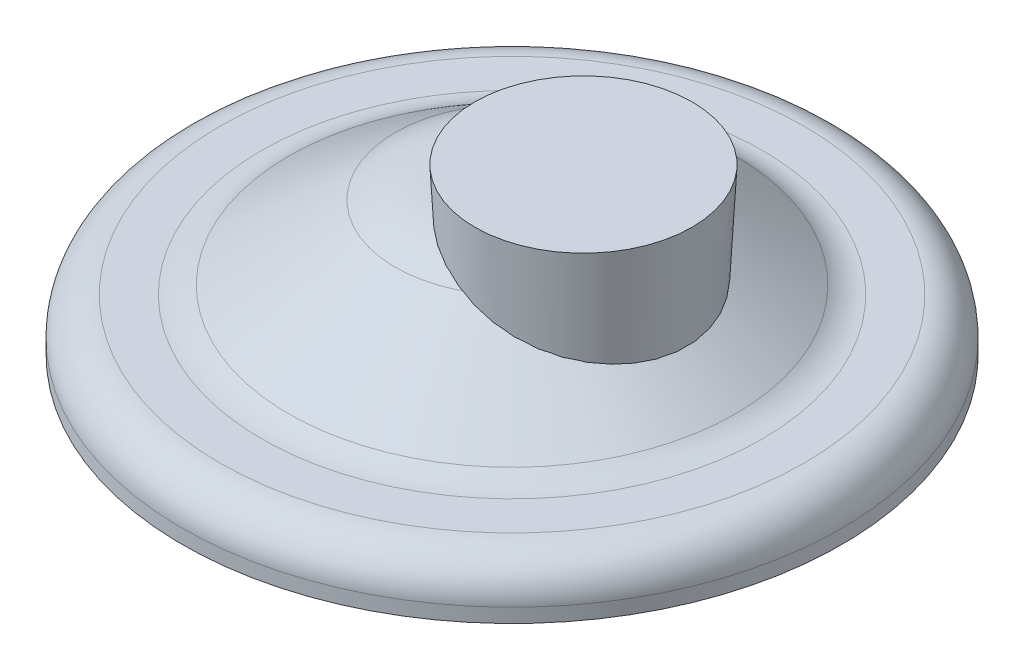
ISO-10303-21;
HEADER;
FILE_DESCRIPTION(('STEP AP214'),'2;1');
FILE_NAME('part.step','',(''),(''),'','','');
FILE_SCHEMA(('AUTOMOTIVE_DESIGN { 1 0 10303 214 1 1 1 1 }'));
ENDSEC;
DATA;
#1=APPLICATION_CONTEXT('core data for automotive mechanical design processes');
#2=APPLICATION_PROTOCOL_DEFINITION('international standard','automotive_design',2000,#1);
#3=PRODUCT_CONTEXT('',#1,'mechanical');
#4=PRODUCT('Part','Part','',(#3));
#5=PRODUCT_RELATED_PRODUCT_CATEGORY('part','',(#4));
#6=PRODUCT_DEFINITION_FORMATION('','',#4);
#7=PRODUCT_DEFINITION_CONTEXT('part definition',#1,'design');
#8=PRODUCT_DEFINITION('design','',#6,#7);
#9=PRODUCT_DEFINITION_SHAPE('','',#8);
#10=(LENGTH_UNIT() NAMED_UNIT(*) SI_UNIT(.MILLI.,.METRE.));
#11=(NAMED_UNIT(*) PLANE_ANGLE_UNIT() SI_UNIT($,.RADIAN.));
#12=(NAMED_UNIT(*) SI_UNIT($,.STERADIAN.) SOLID_ANGLE_UNIT());
#13=UNCERTAINTY_MEASURE_WITH_UNIT(LENGTH_MEASURE(1.E-05),#10,'distance_accuracy_value','');
#14=(GEOMETRIC_REPRESENTATION_CONTEXT(3) GLOBAL_UNCERTAINTY_ASSIGNED_CONTEXT((#13)) GLOBAL_UNIT_ASSIGNED_CONTEXT((#10,
#11,#12)) REPRESENTATION_CONTEXT('',''));
#15=CARTESIAN_POINT('',(0.,0.,0.));
#16=DIRECTION('',(0.,0.,1.));
#17=DIRECTION('',(1.,0.,0.));
#18=AXIS2_PLACEMENT_3D('',#15,#16,#17);
#19=CARTESIAN_POINT('',(19.2525607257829,27.3217508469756,0.));
#20=DIRECTION('',(0.,1.,0.));
#21=DIRECTION('',(-1.,0.,0.));
#22=AXIS2_PLACEMENT_3D('',#19,#20,#21);
#23=CONICAL_SURFACE('',#22,28.6328589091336,0.05235987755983);
#24=CARTESIAN_POINT('',(19.2525607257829,4.19588418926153,0.));
#25=DIRECTION('',(0.,-1.,0.));
#26=DIRECTION('',(1.,0.,0.));
#27=AXIS2_PLACEMENT_3D('',#24,#25,#26);
#28=CIRCLE('',#27,27.420883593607);
#29=CARTESIAN_POINT('',(46.6734443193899,4.19588418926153,0.));
#30=VERTEX_POINT('',#29);
#31=EDGE_CURVE('E45',#30,#30,#28,.F.);
#32=ORIENTED_EDGE('',*,*,#31,.T.);
#33=EDGE_LOOP('',(#32));
#34=FACE_BOUND('',#33,.T.);
#35=CARTESIAN_POINT('',(19.2525607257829,40.0217508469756,0.));
#36=DIRECTION('',(0.,1.,0.));
#37=DIRECTION('',(-1.,0.,0.));
#38=AXIS2_PLACEMENT_3D('',#35,#36,#37);
#39=CIRCLE('',#38,29.2984377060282);
#40=CARTESIAN_POINT('',(-10.0458769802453,40.0217508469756,0.));
#41=VERTEX_POINT('',#40);
#42=EDGE_CURVE('E49',#41,#41,#39,.T.);
#43=ORIENTED_EDGE('',*,*,#42,.F.);
#44=EDGE_LOOP('',(#43));
#45=FACE_BOUND('',#44,.T.);
#46=ADVANCED_FACE('F39',(#34,#45),#23,.T.);
#47=CARTESIAN_POINT('',(19.2525607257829,40.0217508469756,0.));
#48=DIRECTION('',(0.,1.,0.));
#49=DIRECTION('',(-1.,0.,0.));
#50=AXIS2_PLACEMENT_3D('',#47,#48,#49);
#51=PLANE('',#50);
#52=ORIENTED_EDGE('',*,*,#42,.T.);
#53=EDGE_LOOP('',(#52));
#54=FACE_BOUND('',#53,.T.);
#55=ADVANCED_FACE('F56',(#54),#51,.T.);
#56=CARTESIAN_POINT('',(19.2525607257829,-0.618249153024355,0.));
#57=DIRECTION('',(0.,1.,0.));
#58=DIRECTION('',(-1.,0.,0.));
#59=AXIS2_PLACEMENT_3D('',#56,#57,#58);
#60=PLANE('',#59);
#61=CARTESIAN_POINT('',(19.2525607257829,-0.618249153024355,0.));
#62=DIRECTION('',(0.,1.,0.));
#63=DIRECTION('',(-1.,0.,0.));
#64=AXIS2_PLACEMENT_3D('',#61,#62,#63);
#65=CIRCLE('',#64,22.3478455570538);
#66=CARTESIAN_POINT('',(-3.09528483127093,-0.618249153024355,0.));
#67=VERTEX_POINT('',#66);
#68=EDGE_CURVE('E11',#67,#67,#65,.F.);
#69=ORIENTED_EDGE('',*,*,#68,.T.);
#70=EDGE_LOOP('',(#69));
#71=FACE_BOUND('',#70,.T.);
#72=ADVANCED_FACE('F62',(#71),#60,.F.);
#73=CARTESIAN_POINT('',(19.2525607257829,4.46175084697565,0.));
#74=DIRECTION('',(0.,1.,0.));
#75=DIRECTION('',(-1.,0.,0.));
#76=AXIS2_PLACEMENT_3D('',#73,#74,#75);
#77=TOROIDAL_SURFACE('',#76,22.3478455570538,5.08);
#78=ORIENTED_EDGE('',*,*,#68,.F.);
#79=EDGE_LOOP('',(#78));
#80=FACE_BOUND('',#79,.T.);
#81=ORIENTED_EDGE('',*,*,#31,.F.);
#82=EDGE_LOOP('',(#81));
#83=FACE_BOUND('',#82,.T.);
#84=ADVANCED_FACE('F66',(#80,#83),#77,.T.);
#85=CLOSED_SHELL('',(#46,#55,#72,#84));
#86=MANIFOLD_SOLID_BREP('B2',#85);
#87=CARTESIAN_POINT('',(0.,-2.96077341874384,0.));
#88=DIRECTION('',(0.,-1.,0.));
#89=DIRECTION('',(1.,0.,0.));
#90=AXIS2_PLACEMENT_3D('',#87,#88,#89);
#91=CONICAL_SURFACE('',#90,56.6221379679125,0.965068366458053);
#92=CARTESIAN_POINT('',(16.9673886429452,-2.96097341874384,-54.02043069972));
#93=CARTESIAN_POINT('',(16.9348689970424,-2.34046161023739,-53.091523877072));
#94=CARTESIAN_POINT('',(16.902389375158,-1.72071350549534,-52.1621045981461));
#95=CARTESIAN_POINT('',(16.8375259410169,-0.483045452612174,-50.3020423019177));
#96=CARTESIAN_POINT('',(16.805142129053,0.134874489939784,-49.3713992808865));
#97=CARTESIAN_POINT('',(16.7404837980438,1.36862894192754,-47.508624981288));
#98=CARTESIAN_POINT('',(16.7082092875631,1.98446328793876,-46.576493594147));
#99=CARTESIAN_POINT('',(16.6437927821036,3.21360343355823,-44.7105614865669));
#100=CARTESIAN_POINT('',(16.6116507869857,3.82690923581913,-43.7767607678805));
#101=CARTESIAN_POINT('',(16.54753844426,5.05024561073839,-41.9075676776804));
#102=CARTESIAN_POINT('',(16.5155680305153,5.66027744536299,-40.9721761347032));
#103=CARTESIAN_POINT('',(16.4518181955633,6.87669675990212,-39.0990202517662));
#104=CARTESIAN_POINT('',(16.4200387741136,7.48308424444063,-38.1612559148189));
#105=CARTESIAN_POINT('',(16.35671418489,8.69138938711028,-36.2828755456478));
#106=CARTESIAN_POINT('',(16.3251690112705,9.29330715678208,-35.3422595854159));
#107=CARTESIAN_POINT('',(16.2623678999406,10.4916237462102,-33.4575115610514));
#108=CARTESIAN_POINT('',(16.2311119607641,11.0880225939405,-32.513379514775));
#109=CARTESIAN_POINT('',(16.1765625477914,12.1288873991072,-30.8521329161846));
#110=CARTESIAN_POINT('',(16.1531908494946,12.5748459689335,-30.1359565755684));
#111=CARTESIAN_POINT('',(16.1066984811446,13.4619732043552,-28.7006420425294));
#112=CARTESIAN_POINT('',(16.0835778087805,13.9031419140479,-27.9815038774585));
#113=CARTESIAN_POINT('',(16.0376380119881,14.7797254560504,-26.5395666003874));
#114=CARTESIAN_POINT('',(16.0148189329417,15.2151394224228,-25.8167669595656));
#115=CARTESIAN_POINT('',(15.9808723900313,15.8628780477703,-24.7293363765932));
#116=CARTESIAN_POINT('',(15.9696036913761,16.0778976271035,-24.3663145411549));
#117=CARTESIAN_POINT('',(15.9471718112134,16.5059233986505,-23.6390795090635));
#118=CARTESIAN_POINT('',(15.9360086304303,16.7189295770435,-23.2748663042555));
#119=CARTESIAN_POINT('',(15.9249039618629,16.9308192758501,-22.9100006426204));
#120=B_SPLINE_CURVE_WITH_KNOTS('',3,(#92,#93,#94,#95,#96,#97,#98,#99,#100,#101,#102,#103,#104,
#105,#106,#107,#108,#109,#110,#111,#112,#113,#114,#115,#116,#117,#118,#119),.UNSPECIFIED.,.F.,
.F.,(4,2,2,2,2,2,2,2,2,2,2,2,2,4),(0.,3.35270753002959,6.70542529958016,10.0583999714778,
13.4113711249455,16.7629406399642,20.114505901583,23.4659872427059,26.8174515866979,
29.3494323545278,31.881389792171,34.4137239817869,35.6799359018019,36.9461565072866),.UNSPECIFIED.);
#121=CARTESIAN_POINT('',(16.9673781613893,-2.96077341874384,-54.0201313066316));
#122=VERTEX_POINT('',#121);
#123=CARTESIAN_POINT('',(15.9249144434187,16.9306192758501,-22.9103450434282));
#124=VERTEX_POINT('',#123);
#125=EDGE_CURVE('E763',#122,#124,#120,.T.);
#126=ORIENTED_EDGE('',*,*,#125,.T.);
#127=CARTESIAN_POINT('',(0.,16.9306192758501,0.));
#128=DIRECTION('',(0.,1.,0.));
#129=DIRECTION('',(-1.,0.,0.));
#130=AXIS2_PLACEMENT_3D('',#127,#128,#129);
#131=CIRCLE('',#130,27.9013764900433);
#132=CARTESIAN_POINT('',(-15.9249144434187,16.9306192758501,-22.9103450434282));
#133=VERTEX_POINT('',#132);
#134=EDGE_CURVE('E830',#124,#133,#131,.T.);
#135=ORIENTED_EDGE('',*,*,#134,.T.);
#136=CARTESIAN_POINT('',(-16.9673886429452,-2.96097341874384,-54.02043069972));
#137=CARTESIAN_POINT('',(-16.9348695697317,-2.34047253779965,-53.0915402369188));
#138=CARTESIAN_POINT('',(-16.9023905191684,-1.7207353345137,-52.1621373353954));
#139=CARTESIAN_POINT('',(-16.8375282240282,-0.483089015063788,-50.3021078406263));
#140=CARTESIAN_POINT('',(-16.8051449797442,0.134820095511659,-49.3714812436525));
#141=CARTESIAN_POINT('',(-16.740487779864,1.36855296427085,-47.5087398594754));
#142=CARTESIAN_POINT('',(-16.7082138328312,1.98437655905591,-46.5766249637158));
#143=CARTESIAN_POINT('',(-16.6437984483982,3.21349531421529,-44.710725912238));
#144=CARTESIAN_POINT('',(-16.611657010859,3.82679047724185,-43.7769417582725));
#145=CARTESIAN_POINT('',(-16.5475457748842,5.05010573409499,-41.907781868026));
#146=CARTESIAN_POINT('',(-16.5155759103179,5.660127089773,-40.9724069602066));
#147=CARTESIAN_POINT('',(-16.4518271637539,6.87652563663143,-39.099284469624));
#148=CARTESIAN_POINT('',(-16.420048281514,7.48290283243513,-38.1615368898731));
#149=CARTESIAN_POINT('',(-16.3567247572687,8.69118765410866,-36.2831901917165));
#150=CARTESIAN_POINT('',(-16.325180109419,9.29309539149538,-35.3425911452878));
#151=CARTESIAN_POINT('',(-16.2623800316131,10.4913922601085,-33.4578771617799));
#152=CARTESIAN_POINT('',(-16.2311246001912,11.0877814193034,-32.5137622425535));
#153=CARTESIAN_POINT('',(-16.176574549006,12.1286584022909,-30.8525000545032));
#154=CARTESIAN_POINT('',(-16.1532017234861,12.5746384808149,-30.136290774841));
#155=CARTESIAN_POINT('',(-16.1067071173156,13.461808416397,-28.7009101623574));
#156=CARTESIAN_POINT('',(-16.0835853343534,13.9029983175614,-27.9817388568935));
#157=CARTESIAN_POINT('',(-16.0376433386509,14.7796238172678,-26.5397350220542));
#158=CARTESIAN_POINT('',(-16.014823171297,15.2150585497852,-25.8169019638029));
#159=CARTESIAN_POINT('',(-15.9808750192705,15.862827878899,-24.7294209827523));
#160=CARTESIAN_POINT('',(-15.9696057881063,16.0778576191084,-24.3663823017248));
#161=CARTESIAN_POINT('',(-15.9471728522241,16.5059035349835,-23.6391134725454));
#162=CARTESIAN_POINT('',(-15.9360091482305,16.7189196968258,-23.274883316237));
#163=CARTESIAN_POINT('',(-15.9249039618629,16.9308192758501,-22.9100006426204));
#164=B_SPLINE_CURVE_WITH_KNOTS('',3,(#136,#137,#138,#139,#140,#141,#142,#143,#144,#145,#146,
#147,#148,#149,#150,#151,#152,#153,#154,#155,#156,#157,#158,#159,#160,#161,#162,#163),
.UNSPECIFIED.,.F.,.F.,(4,2,2,2,2,2,2,2,2,2,2,2,2,4),(0.,3.35264848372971,6.70530720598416,
10.0582227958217,13.4111348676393,16.7626453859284,20.1141516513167,23.4655740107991,
26.8169793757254,29.3490781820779,31.8811536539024,34.4136059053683,35.6798768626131,
36.9461565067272),.UNSPECIFIED.);
#165=CARTESIAN_POINT('',(-16.9673781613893,-2.96077341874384,-54.0201313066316));
#166=VERTEX_POINT('',#165);
#167=EDGE_CURVE('E836',#166,#133,#164,.T.);
#168=ORIENTED_EDGE('',*,*,#167,.F.);
#169=CARTESIAN_POINT('',(0.,-2.96077341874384,0.));
#170=DIRECTION('',(0.,1.,0.));
#171=DIRECTION('',(-1.,0.,0.));
#172=AXIS2_PLACEMENT_3D('',#169,#170,#171);
#173=CIRCLE('',#172,56.6221379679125);
#174=EDGE_CURVE('E732',#122,#166,#173,.T.);
#175=ORIENTED_EDGE('',*,*,#174,.F.);
#176=EDGE_LOOP('',(#126,#135,#168,#175));
#177=FACE_BOUND('',#176,.T.);
#178=ADVANCED_FACE('F95',(#177),#91,.F.);
#179=CARTESIAN_POINT('',(0.,12.7,0.));
#180=DIRECTION('',(0.,1.,0.));
#181=DIRECTION('',(-1.,0.,0.));
#182=AXIS2_PLACEMENT_3D('',#179,#180,#181);
#183=TOROIDAL_SURFACE('',#182,67.4684588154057,19.05);
#184=CARTESIAN_POINT('',(0.,-6.34999999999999,0.));
#185=DIRECTION('',(0.,1.,0.));
#186=DIRECTION('',(-1.,0.,0.));
#187=AXIS2_PLACEMENT_3D('',#184,#185,#186);
#188=CIRCLE('',#187,67.4684588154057);
#189=CARTESIAN_POINT('',(17.145,-6.35,-65.2536735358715));
#190=VERTEX_POINT('',#189);
#191=CARTESIAN_POINT('',(-17.145,-6.34999999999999,-65.2536735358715));
#192=VERTEX_POINT('',#191);
#193=EDGE_CURVE('E834',#190,#192,#188,.T.);
#194=ORIENTED_EDGE('',*,*,#193,.F.);
#195=CARTESIAN_POINT('',(17.1386628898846,-6.22908073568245,-67.4686588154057));
#196=CARTESIAN_POINT('',(17.1402915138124,-6.26015673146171,-67.1850260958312));
#197=CARTESIAN_POINT('',(17.1416066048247,-6.28525016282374,-66.9007714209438));
#198=CARTESIAN_POINT('',(17.1436087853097,-6.32345404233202,-66.3314578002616));
#199=CARTESIAN_POINT('',(17.1442958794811,-6.33656458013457,-66.0463988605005));
#200=CARTESIAN_POINT('',(17.145413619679,-6.35789233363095,-65.1908011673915));
#201=CARTESIAN_POINT('',(17.1449014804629,-6.34812013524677,-64.6197094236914));
#202=CARTESIAN_POINT('',(17.1413659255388,-6.28065772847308,-63.4796120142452));
#203=CARTESIAN_POINT('',(17.1383388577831,-6.22289783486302,-62.9106105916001));
#204=CARTESIAN_POINT('',(17.1297906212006,-6.0597877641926,-61.779492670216));
#205=CARTESIAN_POINT('',(17.1242695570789,-5.95443958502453,-61.2173758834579));
#206=CARTESIAN_POINT('',(17.1107640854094,-5.6967398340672,-60.1036687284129));
#207=CARTESIAN_POINT('',(17.1027780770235,-5.54435771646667,-59.552085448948));
#208=CARTESIAN_POINT('',(17.0843914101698,-5.19351921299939,-58.4637235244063));
#209=CARTESIAN_POINT('',(17.0739904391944,-4.99505686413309,-57.9269468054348));
#210=CARTESIAN_POINT('',(17.0508611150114,-4.55372306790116,-56.8733352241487));
#211=CARTESIAN_POINT('',(17.0381376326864,-4.31094456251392,-56.3564613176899));
#212=CARTESIAN_POINT('',(17.0104298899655,-3.78224933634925,-55.3455901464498));
#213=CARTESIAN_POINT('',(16.9954467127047,-3.49635328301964,-54.8515820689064));
#214=CARTESIAN_POINT('',(16.9671694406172,-2.95679078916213,-54.0056469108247));
#215=CARTESIAN_POINT('',(16.9543339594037,-2.71187521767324,-53.6480918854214));
#216=CARTESIAN_POINT('',(16.9274694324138,-2.19926950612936,-52.950347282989));
#217=CARTESIAN_POINT('',(16.9134416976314,-1.93160438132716,-52.6101392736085));
#218=CARTESIAN_POINT('',(16.8988334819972,-1.65286302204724,-52.2792092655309));
#219=B_SPLINE_CURVE_WITH_KNOTS('',3,(#195,#196,#197,#198,#199,#200,#201,#202,#203,#204,#205,
#206,#207,#208,#209,#210,#211,#212,#213,#214,#215,#216,#217,#218),.UNSPECIFIED.,.F.,.F.,(4,2,2,
2,2,2,2,2,2,2,2,4),(0.,0.855870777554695,1.71173515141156,3.42306645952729,5.13688722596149,
6.85063604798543,8.56550020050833,10.2805863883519,11.992116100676,13.7028280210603,
15.0026700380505,16.3011008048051),.UNSPECIFIED.);
#220=EDGE_CURVE('E336',#190,#122,#219,.T.);
#221=ORIENTED_EDGE('',*,*,#220,.T.);
#222=ORIENTED_EDGE('',*,*,#174,.T.);
#223=CARTESIAN_POINT('',(-17.1386628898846,-6.22908073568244,-67.4686588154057));
#224=CARTESIAN_POINT('',(-17.1403164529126,-6.2606325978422,-67.1806817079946));
#225=CARTESIAN_POINT('',(-17.141646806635,-6.28601725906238,-66.892064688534));
#226=CARTESIAN_POINT('',(-17.1436601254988,-6.32443367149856,-66.3140078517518));
#227=CARTESIAN_POINT('',(-17.1443430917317,-6.33746544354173,-66.0245680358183));
#228=CARTESIAN_POINT('',(-17.1454191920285,-6.35799866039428,-65.1559155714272));
#229=CARTESIAN_POINT('',(-17.1448407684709,-6.34696168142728,-64.5761533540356));
#230=CARTESIAN_POINT('',(-17.1411523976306,-6.27658337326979,-63.4362900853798));
#231=CARTESIAN_POINT('',(-17.138115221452,-6.21863059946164,-62.8761004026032));
#232=CARTESIAN_POINT('',(-17.129622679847,-6.05658325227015,-61.7624211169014));
#233=CARTESIAN_POINT('',(-17.1241672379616,-5.95248721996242,-61.2089317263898));
#234=CARTESIAN_POINT('',(-17.1104689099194,-5.69110755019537,-60.0793345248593));
#235=CARTESIAN_POINT('',(-17.1020774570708,-5.53098909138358,-59.5038820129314));
#236=CARTESIAN_POINT('',(-17.0826685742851,-5.16064554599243,-58.3693787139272));
#237=CARTESIAN_POINT('',(-17.0716510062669,-4.9504178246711,-57.8103287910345));
#238=CARTESIAN_POINT('',(-17.0466748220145,-4.47384383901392,-56.6959255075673));
#239=CARTESIAN_POINT('',(-17.0326352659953,-4.20595315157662,-56.141230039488));
#240=CARTESIAN_POINT('',(-17.0096151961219,-3.76670405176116,-55.3296360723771));
#241=CARTESIAN_POINT('',(-17.0016130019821,-3.61401309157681,-55.0624543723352));
#242=CARTESIAN_POINT('',(-16.9849678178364,-3.29640405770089,-54.535473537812));
#243=CARTESIAN_POINT('',(-16.9763248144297,-3.13148572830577,-54.2756745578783));
#244=CARTESIAN_POINT('',(-16.9673676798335,-2.96057341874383,-54.0198319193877));
#245=B_SPLINE_CURVE_WITH_KNOTS('',3,(#223,#224,#225,#226,#227,#228,#229,#230,#231,#232,#233,
#234,#235,#236,#237,#238,#239,#240,#241,#242,#243,#244),.UNSPECIFIED.,.F.,.F.,(4,2,2,2,2,2,2,2,
2,2,4),(0.,0.868974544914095,1.73794762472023,3.47524240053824,5.16292072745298,
6.85065241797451,8.64040826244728,10.4302582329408,12.2758753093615,13.1991049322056,
14.1223538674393),.UNSPECIFIED.);
#246=EDGE_CURVE('E904',#192,#166,#245,.T.);
#247=ORIENTED_EDGE('',*,*,#246,.F.);
#248=EDGE_LOOP('',(#194,#221,#222,#247));
#249=FACE_BOUND('',#248,.T.);
#250=ADVANCED_FACE('F582',(#249),#183,.T.);
#251=CARTESIAN_POINT('',(0.,-1.7424450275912,0.));
#252=DIRECTION('',(0.,1.,0.));
#253=DIRECTION('',(-1.,0.,0.));
#254=AXIS2_PLACEMENT_3D('',#251,#252,#253);
#255=DEGENERATE_TOROIDAL_SURFACE('',#254,14.9688066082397,22.7141958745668,.T.);
#256=ORIENTED_EDGE('',*,*,#134,.F.);
#257=CARTESIAN_POINT('',(16.1296580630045,13.0238782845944,-27.9015764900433));
#258=CARTESIAN_POINT('',(16.1170302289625,13.2648317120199,-27.6707735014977));
#259=CARTESIAN_POINT('',(16.1046827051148,13.500436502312,-27.4343895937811));
#260=CARTESIAN_POINT('',(16.0805662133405,13.9606065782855,-26.9511122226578));
#261=CARTESIAN_POINT('',(16.0687972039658,14.1851726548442,-26.7042195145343));
#262=CARTESIAN_POINT('',(16.0458589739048,14.6228601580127,-26.20065579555));
#263=CARTESIAN_POINT('',(16.0346894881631,14.8359866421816,-25.9439891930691));
#264=CARTESIAN_POINT('',(16.0129586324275,15.250636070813,-25.4214491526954));
#265=CARTESIAN_POINT('',(16.0023972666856,15.4521589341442,-25.1555756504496));
#266=CARTESIAN_POINT('',(15.9720319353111,16.0315639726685,-24.3553986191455));
#267=CARTESIAN_POINT('',(15.9531057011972,16.3926980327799,-23.808810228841));
#268=CARTESIAN_POINT('',(15.9176860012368,17.0685461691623,-22.6878350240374));
#269=CARTESIAN_POINT('',(15.9011919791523,17.3832708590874,-22.113454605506));
#270=CARTESIAN_POINT('',(15.8789070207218,17.8084931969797,-21.2592576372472));
#271=CARTESIAN_POINT('',(15.8721581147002,17.9372699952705,-20.9884170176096));
#272=CARTESIAN_POINT('',(15.8591646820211,18.1851994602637,-20.442414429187));
#273=CARTESIAN_POINT('',(15.8529200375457,18.3043543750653,-20.1672534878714));
#274=CARTESIAN_POINT('',(15.8408741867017,18.5342029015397,-19.6105348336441));
#275=CARTESIAN_POINT('',(15.8350774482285,18.6448112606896,-19.3289419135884));
#276=CARTESIAN_POINT('',(15.8239796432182,18.8565699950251,-18.7621578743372));
#277=CARTESIAN_POINT('',(15.8186786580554,18.9577188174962,-18.4769661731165));
#278=CARTESIAN_POINT('',(15.8136213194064,19.0542185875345,-18.1902159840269));
#279=B_SPLINE_CURVE_WITH_KNOTS('',3,(#257,#258,#259,#260,#261,#262,#263,#264,#265,#266,#267,
#268,#269,#270,#271,#272,#273,#274,#275,#276,#277,#278),.UNSPECIFIED.,.F.,.F.,(4,2,2,2,2,2,2,2,
2,2,4),(0.,1.00158567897,2.00309949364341,3.00416681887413,4.00524114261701,5.9689113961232,
7.93213186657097,8.83190201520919,9.73146132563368,10.63906993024,11.5468272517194),.UNSPECIFIED.);
#280=CARTESIAN_POINT('',(15.9040134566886,17.3294338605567,-22.1959865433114));
#281=VERTEX_POINT('',#280);
#282=EDGE_CURVE('E349',#124,#281,#279,.T.);
#283=ORIENTED_EDGE('',*,*,#282,.T.);
#284=CARTESIAN_POINT('',(25.5215190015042,11.2298400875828,-21.8763203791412));
#285=CARTESIAN_POINT('',(25.2737548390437,11.4876015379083,-21.8898290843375));
#286=CARTESIAN_POINT('',(25.0196563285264,11.7392574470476,-21.903017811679));
#287=CARTESIAN_POINT('',(24.4996948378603,12.2300646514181,-21.9287399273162));
#288=CARTESIAN_POINT('',(24.2338336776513,12.4692178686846,-21.9412734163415));
#289=CARTESIAN_POINT('',(23.6915735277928,12.9344631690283,-21.9656558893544));
#290=CARTESIAN_POINT('',(23.4151906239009,13.1605739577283,-21.9775058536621));
#291=CARTESIAN_POINT('',(22.8523935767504,13.5999585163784,-22.0005330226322));
#292=CARTESIAN_POINT('',(22.5659790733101,13.8132318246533,-22.0117102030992));
#293=CARTESIAN_POINT('',(21.7054178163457,14.4247978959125,-22.0437610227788));
#294=CARTESIAN_POINT('',(21.1181650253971,14.804878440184,-22.0636802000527));
#295=CARTESIAN_POINT('',(19.9143859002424,15.5159073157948,-22.1009436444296));
#296=CARTESIAN_POINT('',(19.2978465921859,15.8468335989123,-22.1182867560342));
#297=CARTESIAN_POINT('',(18.2584441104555,16.3547317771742,-22.1449045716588));
#298=CARTESIAN_POINT('',(17.8422194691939,16.5454059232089,-22.1548973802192));
#299=CARTESIAN_POINT('',(17.001179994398,16.9068621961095,-22.1738405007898));
#300=CARTESIAN_POINT('',(16.5763644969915,17.077642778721,-22.1827907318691));
#301=CARTESIAN_POINT('',(15.2910396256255,17.5612268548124,-22.2081342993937));
#302=CARTESIAN_POINT('',(14.4195848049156,17.8453050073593,-22.2230222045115));
#303=CARTESIAN_POINT('',(12.6462153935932,18.3471895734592,-22.2493248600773));
#304=CARTESIAN_POINT('',(11.7440551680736,18.5641141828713,-22.2606933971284));
#305=CARTESIAN_POINT('',(10.3815257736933,18.8428546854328,-22.2753015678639));
#306=CARTESIAN_POINT('',(9.92577514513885,18.9279972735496,-22.2797637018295));
#307=CARTESIAN_POINT('',(9.01179692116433,19.0838811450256,-22.2879332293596));
#308=CARTESIAN_POINT('',(8.55356925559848,19.1546220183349,-22.2916406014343));
#309=CARTESIAN_POINT('',(7.25189612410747,19.3363350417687,-22.3011637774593));
#310=CARTESIAN_POINT('',(6.40621589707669,19.43159146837,-22.3061559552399));
#311=CARTESIAN_POINT('',(5.13516115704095,19.5454242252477,-22.3121216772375));
#312=CARTESIAN_POINT('',(4.71099221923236,19.5785291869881,-22.3138566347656));
#313=CARTESIAN_POINT('',(3.86204043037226,19.6356318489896,-22.3168492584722));
#314=CARTESIAN_POINT('',(3.43725759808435,19.6596298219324,-22.3181069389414));
#315=CARTESIAN_POINT('',(2.58667438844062,19.6990189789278,-22.3201712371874));
#316=CARTESIAN_POINT('',(2.16087343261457,19.7143974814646,-22.320977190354));
#317=CARTESIAN_POINT('',(1.30905199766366,19.7368080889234,-22.3221516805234));
#318=CARTESIAN_POINT('',(0.883031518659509,19.74384019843,-22.3225202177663));
#319=CARTESIAN_POINT('',(0.030971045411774,19.7497067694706,-22.3228276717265));
#320=CARTESIAN_POINT('',(-0.395068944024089,19.7485419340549,-22.3227666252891));
#321=CARTESIAN_POINT('',(-1.2470519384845,19.737990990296,-22.3222136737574));
#322=CARTESIAN_POINT('',(-1.67299494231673,19.7286047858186,-22.3217217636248));
#323=CARTESIAN_POINT('',(-2.52030196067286,19.7015528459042,-22.3203040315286));
#324=CARTESIAN_POINT('',(-2.94166864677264,19.6839719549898,-22.319382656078));
#325=CARTESIAN_POINT('',(-3.78395487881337,19.6402075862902,-22.3170890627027));
#326=CARTESIAN_POINT('',(-4.20487441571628,19.6140239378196,-22.3157168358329));
#327=CARTESIAN_POINT('',(-5.46672431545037,19.521859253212,-22.3108866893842));
#328=CARTESIAN_POINT('',(-6.30672120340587,19.4422652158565,-22.3067153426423));
#329=CARTESIAN_POINT('',(-7.98028834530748,19.2416635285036,-22.2962022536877));
#330=CARTESIAN_POINT('',(-8.81386742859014,19.1207304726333,-22.2898644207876));
#331=CARTESIAN_POINT('',(-10.4725986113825,18.8309181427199,-22.274676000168));
#332=CARTESIAN_POINT('',(-11.2977524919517,18.6620492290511,-22.2658259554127));
#333=CARTESIAN_POINT('',(-12.9530283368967,18.2652211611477,-22.2450290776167));
#334=CARTESIAN_POINT('',(-13.7828614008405,18.0360456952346,-22.233018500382));
#335=CARTESIAN_POINT('',(-15.4219630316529,17.5137060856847,-22.2056438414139));
#336=CARTESIAN_POINT('',(-16.2312425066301,17.2205767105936,-22.1902815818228));
#337=CARTESIAN_POINT('',(-17.4268747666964,16.7274021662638,-22.1644353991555));
#338=CARTESIAN_POINT('',(-17.8240471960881,16.5532269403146,-22.1553072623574));
#339=CARTESIAN_POINT('',(-18.609875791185,16.1866604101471,-22.1360963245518));
#340=CARTESIAN_POINT('',(-18.9985326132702,15.994270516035,-22.1260135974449));
#341=CARTESIAN_POINT('',(-19.7669222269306,15.5903707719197,-22.1048461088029));
#342=CARTESIAN_POINT('',(-20.1466322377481,15.378817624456,-22.093759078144));
#343=CARTESIAN_POINT('',(-20.894906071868,14.9366585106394,-22.0705865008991));
#344=CARTESIAN_POINT('',(-21.2634665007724,14.7060468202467,-22.0585006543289));
#345=CARTESIAN_POINT('',(-21.625693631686,14.4658125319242,-22.0459105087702));
#346=B_SPLINE_CURVE_WITH_KNOTS('',3,(#284,#285,#286,#287,#288,#289,#290,#291,#292,#293,#294,
#295,#296,#297,#298,#299,#300,#301,#302,#303,#304,#305,#306,#307,#308,#309,#310,#311,#312,#313,
#314,#315,#316,#317,#318,#319,#320,#321,#322,#323,#324,#325,#326,#327,#328,#329,#330,#331,#332,
#333,#334,#335,#336,#337,#338,#339,#340,#341,#342,#343,#344,#345),.UNSPECIFIED.,.F.,.F.,(4,2,2,
2,2,2,2,2,2,2,2,2,2,2,2,2,2,2,2,2,2,2,2,2,2,2,2,2,2,2,4),(0.,1.07321206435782,2.14625865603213,
3.21772591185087,4.28923167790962,6.38592687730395,8.48355973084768,9.85684714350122,
11.2302410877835,13.9768064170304,16.7580413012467,18.148815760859,19.5396298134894,
22.0915331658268,23.3678546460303,24.6441379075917,25.9222940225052,27.200449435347,
28.4784952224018,29.7565559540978,31.0216684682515,32.2868060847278,34.8171555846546,
37.3429630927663,39.8682251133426,42.4489480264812,45.0282714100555,46.3292269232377,
47.630081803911,48.9339528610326,50.2382169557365),.UNSPECIFIED.);
#347=CARTESIAN_POINT('',(-15.9040134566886,17.3294338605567,-22.1959865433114));
#348=VERTEX_POINT('',#347);
#349=EDGE_CURVE('E348',#281,#348,#346,.T.);
#350=ORIENTED_EDGE('',*,*,#349,.T.);
#351=CARTESIAN_POINT('',(-15.9249249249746,16.9304192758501,-22.9106894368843));
#352=CARTESIAN_POINT('',(-15.9163709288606,17.0936392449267,-22.6296387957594));
#353=CARTESIAN_POINT('',(-15.9081176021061,17.2511221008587,-22.3453093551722));
#354=CARTESIAN_POINT('',(-15.8922091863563,17.5546727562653,-21.7706422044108));
#355=CARTESIAN_POINT('',(-15.8845540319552,17.7007418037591,-21.4803051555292));
#356=CARTESIAN_POINT('',(-15.862472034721,18.1220914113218,-20.6007567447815));
#357=CARTESIAN_POINT('',(-15.8489361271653,18.3803719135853,-20.0032546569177));
#358=CARTESIAN_POINT('',(-15.8304235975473,18.7336120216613,-19.0966580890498));
#359=CARTESIAN_POINT('',(-15.8245705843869,18.8452941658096,-18.7939288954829));
#360=CARTESIAN_POINT('',(-15.8134212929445,19.0580353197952,-18.1847291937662));
#361=CARTESIAN_POINT('',(-15.8081250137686,19.1590943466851,-17.8782586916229));
#362=CARTESIAN_POINT('',(-15.7980809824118,19.3507458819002,-17.2624965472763));
#363=CARTESIAN_POINT('',(-15.7933325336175,19.4413516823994,-16.9532090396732));
#364=CARTESIAN_POINT('',(-15.7843576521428,19.6126026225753,-16.3318947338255));
#365=CARTESIAN_POINT('',(-15.7801312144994,19.6932478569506,-16.0198679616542));
#366=CARTESIAN_POINT('',(-15.769212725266,19.901585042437,-15.1598321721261));
#367=CARTESIAN_POINT('',(-15.7630333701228,20.0194941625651,-14.6094261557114));
#368=CARTESIAN_POINT('',(-15.7520663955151,20.2287565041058,-13.5035188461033));
#369=CARTESIAN_POINT('',(-15.7472791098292,20.3201033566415,-12.948016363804));
#370=CARTESIAN_POINT('',(-15.7389330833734,20.4793550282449,-11.8331193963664));
#371=CARTESIAN_POINT('',(-15.7353755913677,20.5472360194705,-11.2737215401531));
#372=CARTESIAN_POINT('',(-15.7293140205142,20.6628976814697,-10.1529245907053));
#373=CARTESIAN_POINT('',(-15.7268098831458,20.710679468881,-9.59152561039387));
#374=CARTESIAN_POINT('',(-15.7226436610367,20.7901757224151,-8.46394555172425));
#375=CARTESIAN_POINT('',(-15.7209871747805,20.8217833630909,-7.89775716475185));
#376=CARTESIAN_POINT('',(-15.7183336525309,20.8724155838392,-6.7648092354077));
#377=CARTESIAN_POINT('',(-15.7173366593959,20.8914393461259,-6.19804965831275));
#378=CARTESIAN_POINT('',(-15.7158036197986,20.9206914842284,-5.06458337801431));
#379=CARTESIAN_POINT('',(-15.7152673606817,20.930923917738,-4.49787677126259));
#380=CARTESIAN_POINT('',(-15.7144830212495,20.9458900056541,-3.36440622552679));
#381=CARTESIAN_POINT('',(-15.714234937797,20.9506237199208,-2.797642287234));
#382=CARTESIAN_POINT('',(-15.7138992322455,20.9570293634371,-1.65510734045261));
#383=CARTESIAN_POINT('',(-15.7138142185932,20.9586515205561,-1.07933610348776));
#384=CARTESIAN_POINT('',(-15.7137499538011,20.959877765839,0.0722091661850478));
#385=CARTESIAN_POINT('',(-15.7137707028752,20.9594818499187,0.647983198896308));
#386=CARTESIAN_POINT('',(-15.713934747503,20.9563516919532,1.79974078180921));
#387=CARTESIAN_POINT('',(-15.7140780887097,20.9536165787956,2.37572433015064));
#388=CARTESIAN_POINT('',(-15.714580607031,20.9440279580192,3.52766122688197));
#389=CARTESIAN_POINT('',(-15.7149397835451,20.9371744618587,4.10361457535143));
#390=CARTESIAN_POINT('',(-15.7160265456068,20.9164378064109,5.25273402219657));
#391=CARTESIAN_POINT('',(-15.7167524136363,20.902587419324,5.82590065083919));
#392=CARTESIAN_POINT('',(-15.7187646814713,20.8641910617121,6.97191930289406));
#393=CARTESIAN_POINT('',(-15.7200511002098,20.8396447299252,7.54477131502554));
#394=CARTESIAN_POINT('',(-15.723395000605,20.7758393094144,8.68927880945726));
#395=CARTESIAN_POINT('',(-15.725451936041,20.7365906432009,9.26093485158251));
#396=CARTESIAN_POINT('',(-15.7305493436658,20.6393263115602,10.4026184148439));
#397=CARTESIAN_POINT('',(-15.7335896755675,20.5813133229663,10.9726461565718));
#398=CARTESIAN_POINT('',(-15.7398770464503,20.4613431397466,11.9569947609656));
#399=CARTESIAN_POINT('',(-15.7428485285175,20.4046438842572,12.3719569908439));
#400=CARTESIAN_POINT('',(-15.7494960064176,20.2778024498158,13.19987758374));
#401=CARTESIAN_POINT('',(-15.7531720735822,20.2076589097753,13.612835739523));
#402=CARTESIAN_POINT('',(-15.7612962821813,20.0526397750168,14.4362752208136));
#403=CARTESIAN_POINT('',(-15.7657449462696,19.9677542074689,14.8467546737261));
#404=CARTESIAN_POINT('',(-15.7754698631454,19.7821917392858,15.66411651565));
#405=CARTESIAN_POINT('',(-15.7807460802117,19.6815155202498,16.0709990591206));
#406=CARTESIAN_POINT('',(-15.7921042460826,19.4647888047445,16.8752119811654));
#407=CARTESIAN_POINT('',(-15.798175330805,19.3489456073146,17.2725982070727));
#408=CARTESIAN_POINT('',(-15.8112118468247,19.1001940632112,18.0619744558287));
#409=CARTESIAN_POINT('',(-15.8181772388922,18.9672864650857,18.4539647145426));
#410=CARTESIAN_POINT('',(-15.8330285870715,18.6839058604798,19.2312322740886));
#411=CARTESIAN_POINT('',(-15.8409139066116,18.5334450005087,19.6165140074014));
#412=CARTESIAN_POINT('',(-15.857630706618,18.2144694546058,20.3794597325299));
#413=CARTESIAN_POINT('',(-15.8664620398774,18.0459575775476,20.757124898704));
#414=CARTESIAN_POINT('',(-15.8833123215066,17.7244350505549,21.4325909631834));
#415=CARTESIAN_POINT('',(-15.8911656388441,17.574584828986,21.7319029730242));
#416=CARTESIAN_POINT('',(-15.9075450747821,17.2620465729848,22.325575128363));
#417=CARTESIAN_POINT('',(-15.9160742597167,17.0993000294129,22.6199043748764));
#418=CARTESIAN_POINT('',(-15.9249249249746,16.9304192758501,22.9106894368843));
#419=B_SPLINE_CURVE_WITH_KNOTS('',3,(#351,#352,#353,#354,#355,#356,#357,#358,#359,#360,#361,
#362,#363,#364,#365,#366,#367,#368,#369,#370,#371,#372,#373,#374,#375,#376,#377,#378,#379,#380,
#381,#382,#383,#384,#385,#386,#387,#388,#389,#390,#391,#392,#393,#394,#395,#396,#397,#398,#399,
#400,#401,#402,#403,#404,#405,#406,#407,#408,#409,#410,#411,#412,#413,#414,#415,#416,#417,#418),
.UNSPECIFIED.,.F.,.F.,(4,2,2,2,2,2,2,2,2,2,2,2,2,2,2,2,2,2,2,2,2,2,2,2,2,2,2,2,2,2,2,2,2,4),(0.,
0.975194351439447,1.95028192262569,3.9013093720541,4.8693446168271,5.83737830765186,
6.80416716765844,7.77094683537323,9.45893514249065,11.1473278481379,12.8374299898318,
14.527438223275,16.2284688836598,17.9296100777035,19.6299656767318,21.3303027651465,
23.0576185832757,24.7849378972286,26.5129007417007,28.2408587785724,29.9607973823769,
31.6807940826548,33.3995737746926,35.1181083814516,36.3744026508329,37.6308241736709,
38.8880989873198,40.1453195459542,41.3868677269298,42.6283614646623,43.8690011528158,
45.1094480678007,46.113638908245,47.1226798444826),.UNSPECIFIED.);
#420=EDGE_CURVE('E868',#133,#348,#419,.T.);
#421=ORIENTED_EDGE('',*,*,#420,.F.);
#422=EDGE_LOOP('',(#256,#283,#350,#421));
#423=FACE_BOUND('',#422,.T.);
#424=ADVANCED_FACE('F590',(#423),#255,.F.);
#425=CARTESIAN_POINT('',(0.,20.9717508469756,0.));
#426=DIRECTION('',(0.,1.,0.));
#427=DIRECTION('',(-1.,0.,0.));
#428=AXIS2_PLACEMENT_3D('',#425,#426,#427);
#429=CIRCLE('',#428,14.9688066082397);
#430=CARTESIAN_POINT('',(-14.9688066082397,20.9717508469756,0.));
#431=VERTEX_POINT('',#430);
#432=EDGE_CURVE('E850',#431,#431,#429,.T.);
#433=ORIENTED_EDGE('',*,*,#432,.T.);
#434=EDGE_LOOP('',(#433));
#435=FACE_BOUND('',#434,.T.);
#436=CARTESIAN_POINT('',(27.9015764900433,13.0238782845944,-16.1296580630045));
#437=CARTESIAN_POINT('',(27.6708702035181,13.2647307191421,-16.1170355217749));
#438=CARTESIAN_POINT('',(27.4345877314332,13.5002389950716,-16.1046930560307));
#439=CARTESIAN_POINT('',(26.9515242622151,13.960223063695,-16.0805863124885));
#440=CARTESIAN_POINT('',(26.7047441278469,14.1846997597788,-16.068821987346));
#441=CARTESIAN_POINT('',(26.2015255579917,14.6221210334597,-16.0458977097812));
#442=CARTESIAN_POINT('',(25.9450959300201,14.8350757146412,-16.0347372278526));
#443=CARTESIAN_POINT('',(25.4230426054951,15.2494041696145,-16.0130231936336));
#444=CARTESIAN_POINT('',(25.1574187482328,15.4507777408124,-16.0024696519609));
#445=CARTESIAN_POINT('',(24.3573153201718,16.0302670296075,-15.9720999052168));
#446=CARTESIAN_POINT('',(23.8105240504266,16.3916073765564,-15.9531628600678));
#447=CARTESIAN_POINT('',(22.6888709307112,17.0679788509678,-15.9177157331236));
#448=CARTESIAN_POINT('',(22.1140022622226,17.3829986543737,-15.9012062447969));
#449=CARTESIAN_POINT('',(21.1684682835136,17.853688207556,-15.8765384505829));
#450=CARTESIAN_POINT('',(20.8049366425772,18.0238241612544,-15.8676220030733));
#451=CARTESIAN_POINT('',(20.0702927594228,18.3469712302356,-15.8506865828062));
#452=CARTESIAN_POINT('',(19.6991802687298,18.4999817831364,-15.8426676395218));
#453=CARTESIAN_POINT('',(18.9503913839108,18.7892254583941,-15.8275090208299));
#454=CARTESIAN_POINT('',(18.572713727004,18.9254553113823,-15.8203695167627));
#455=CARTESIAN_POINT('',(17.8118355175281,19.1815960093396,-15.8069457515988));
#456=CARTESIAN_POINT('',(17.4286346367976,19.3015058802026,-15.8006615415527));
#457=CARTESIAN_POINT('',(16.6554679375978,19.5262552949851,-15.7888829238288));
#458=CARTESIAN_POINT('',(16.2654760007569,19.6310049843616,-15.783393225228));
#459=CARTESIAN_POINT('',(15.4817071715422,19.8253962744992,-15.7732056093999));
#460=CARTESIAN_POINT('',(15.0879299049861,19.9150363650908,-15.7685077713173));
#461=CARTESIAN_POINT('',(14.2972874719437,20.0801285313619,-15.759855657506));
#462=CARTESIAN_POINT('',(13.9004213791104,20.155576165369,-15.7559016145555));
#463=CARTESIAN_POINT('',(13.1043912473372,20.2932983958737,-15.7486838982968));
#464=CARTESIAN_POINT('',(12.7052270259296,20.3555719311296,-15.745420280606));
#465=CARTESIAN_POINT('',(11.5063457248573,20.5241743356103,-15.7365842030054));
#466=CARTESIAN_POINT('',(10.7040728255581,20.6125213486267,-15.7319541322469));
#467=CARTESIAN_POINT('',(9.09655549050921,20.751627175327,-15.7246639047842));
#468=CARTESIAN_POINT('',(8.29131124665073,20.8023883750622,-15.7220036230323));
#469=CARTESIAN_POINT('',(7.08190122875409,20.8589139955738,-15.7190412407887));
#470=CARTESIAN_POINT('',(6.6781443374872,20.8744916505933,-15.7182248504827));
#471=CARTESIAN_POINT('',(5.87046393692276,20.9004677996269,-15.7168634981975));
#472=CARTESIAN_POINT('',(5.46654042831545,20.9108663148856,-15.716318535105));
#473=CARTESIAN_POINT('',(4.65862238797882,20.9277842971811,-15.7154319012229));
#474=CARTESIAN_POINT('',(4.25462785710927,20.9343038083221,-15.715090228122));
#475=CARTESIAN_POINT('',(3.44660599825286,20.944598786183,-15.7145506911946));
#476=CARTESIAN_POINT('',(3.042578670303,20.9483742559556,-15.714352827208));
#477=CARTESIAN_POINT('',(2.23251359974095,20.9540937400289,-15.7140530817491));
#478=CARTESIAN_POINT('',(1.82647579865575,20.9560286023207,-15.7139516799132));
#479=CARTESIAN_POINT('',(1.01439675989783,20.9586398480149,-15.7138148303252));
#480=CARTESIAN_POINT('',(0.608355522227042,20.9593162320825,-15.7137793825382));
#481=CARTESIAN_POINT('',(-0.203734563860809,20.9596605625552,-15.7137613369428));
#482=CARTESIAN_POINT('',(-0.609783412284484,20.9593284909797,-15.7137787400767));
#483=CARTESIAN_POINT('',(-1.42187877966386,20.9575299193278,-15.7138729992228));
#484=CARTESIAN_POINT('',(-1.82792529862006,20.956063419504,-15.7139498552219));
#485=CARTESIAN_POINT('',(-2.63966637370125,20.9515064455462,-15.7141886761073));
#486=CARTESIAN_POINT('',(-3.04536093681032,20.9484173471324,-15.7143505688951));
#487=CARTESIAN_POINT('',(-3.85672758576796,20.9398010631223,-15.7148021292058));
#488=CARTESIAN_POINT('',(-4.26239967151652,20.9342738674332,-15.7150917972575));
#489=CARTESIAN_POINT('',(-5.07365775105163,20.9197035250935,-15.7158553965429));
#490=CARTESIAN_POINT('',(-5.47924374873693,20.9106606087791,-15.7163293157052));
#491=CARTESIAN_POINT('',(-6.29027893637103,20.8877891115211,-15.7175279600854));
#492=CARTESIAN_POINT('',(-6.69572812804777,20.8739605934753,-15.7182526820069));
#493=CARTESIAN_POINT('',(-7.59909089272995,20.8362607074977,-15.7202284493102));
#494=CARTESIAN_POINT('',(-8.09694183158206,20.8108157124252,-15.7215619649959));
#495=CARTESIAN_POINT('',(-9.09190886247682,20.7479272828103,-15.7248578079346));
#496=CARTESIAN_POINT('',(-9.58902494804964,20.7104837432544,-15.7268201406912));
#497=CARTESIAN_POINT('',(-10.5820655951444,20.6209384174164,-15.7315130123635));
#498=CARTESIAN_POINT('',(-11.0779898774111,20.568833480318,-15.7342437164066));
#499=CARTESIAN_POINT('',(-12.0677211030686,20.4474651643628,-15.7406043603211));
#500=CARTESIAN_POINT('',(-12.5615282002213,20.3782030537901,-15.7442342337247));
#501=CARTESIAN_POINT('',(-13.5410954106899,20.2210256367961,-15.7524715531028));
#502=CARTESIAN_POINT('',(-14.0268865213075,20.1333047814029,-15.7570688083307));
#503=CARTESIAN_POINT('',(-14.9942499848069,19.9368398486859,-15.7673650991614));
#504=CARTESIAN_POINT('',(-15.4758220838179,19.8280945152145,-15.773064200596));
#505=CARTESIAN_POINT('',(-16.4329292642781,19.5880068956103,-15.7856466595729));
#506=CARTESIAN_POINT('',(-16.9084685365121,19.4566813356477,-15.7925291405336));
#507=CARTESIAN_POINT('',(-17.8521745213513,19.1700374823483,-15.8075515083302));
#508=CARTESIAN_POINT('',(-18.320342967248,19.0147249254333,-15.8156910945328));
#509=CARTESIAN_POINT('',(-19.0256794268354,18.7593981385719,-15.8290722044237));
#510=CARTESIAN_POINT('',(-19.2661817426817,18.6684871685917,-15.8338366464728));
#511=CARTESIAN_POINT('',(-19.744412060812,18.479761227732,-15.8437273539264));
#512=CARTESIAN_POINT('',(-19.9821405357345,18.381947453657,-15.848853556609));
#513=CARTESIAN_POINT('',(-20.6939212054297,18.076670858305,-15.8648524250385));
#514=CARTESIAN_POINT('',(-21.1633941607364,17.8585162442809,-15.8762854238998));
#515=CARTESIAN_POINT('',(-21.625693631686,17.6258118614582,-15.888480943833));
#516=B_SPLINE_CURVE_WITH_KNOTS('',3,(#436,#437,#438,#439,#440,#441,#442,#443,#444,#445,#446,
#447,#448,#449,#450,#451,#452,#453,#454,#455,#456,#457,#458,#459,#460,#461,#462,#463,#464,#465,
#466,#467,#468,#469,#470,#471,#472,#473,#474,#475,#476,#477,#478,#479,#480,#481,#482,#483,#484,
#485,#486,#487,#488,#489,#490,#491,#492,#493,#494,#495,#496,#497,#498,#499,#500,#501,#502,#503,
#504,#505,#506,#507,#508,#509,#510,#511,#512,#513,#514,#515),.UNSPECIFIED.,.F.,.F.,(4,2,2,2,2,2,
2,2,2,2,2,2,2,2,2,2,2,2,2,2,2,2,2,2,2,2,2,2,2,2,2,2,2,2,2,2,2,2,2,4),(0.,1.00116594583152,
2.00224976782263,3.00244102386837,4.00264977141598,5.96715028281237,7.93213026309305,
9.13615021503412,10.3402096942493,11.5445033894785,12.7488689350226,13.9601035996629,
15.1714592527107,16.3831933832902,17.5950250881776,20.0151221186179,22.4350655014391,
23.6472142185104,24.8593579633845,26.0714879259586,27.2836165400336,28.5017411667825,
29.7198651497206,30.938010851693,32.1561562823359,33.3732705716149,34.5903898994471,
35.807429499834,37.0244531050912,38.5198459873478,40.0152519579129,41.5109795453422,
43.006596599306,44.4871833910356,45.9678586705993,47.4474418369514,48.9266717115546,
49.698045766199,50.4692864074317,52.0218742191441),.UNSPECIFIED.);
#517=CARTESIAN_POINT('',(15.7770530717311,19.7519823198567,-15.7770530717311));
#518=VERTEX_POINT('',#517);
#519=CARTESIAN_POINT('',(-15.7770530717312,19.7519823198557,-15.7770530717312));
#520=VERTEX_POINT('',#519);
#521=EDGE_CURVE('E432',#518,#520,#516,.T.);
#522=ORIENTED_EDGE('',*,*,#521,.F.);
#523=CARTESIAN_POINT('',(15.8136186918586,19.054268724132,-18.1900670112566));
#524=CARTESIAN_POINT('',(15.8058325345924,19.2028374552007,-17.7487221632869));
#525=CARTESIAN_POINT('',(15.7986262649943,19.3403412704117,-17.3037241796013));
#526=CARTESIAN_POINT('',(15.7853144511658,19.5943458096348,-16.407952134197));
#527=CARTESIAN_POINT('',(15.7792084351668,19.7108555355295,-15.9571806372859));
#528=CARTESIAN_POINT('',(15.7680639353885,19.9235052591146,-15.0536404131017));
#529=CARTESIAN_POINT('',(15.7630194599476,20.0197595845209,-14.6008984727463));
#530=CARTESIAN_POINT('',(15.7538766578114,20.1942146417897,-13.6919106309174));
#531=CARTESIAN_POINT('',(15.74977843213,20.2724134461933,-13.2356643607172));
#532=CARTESIAN_POINT('',(15.7424700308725,20.4118660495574,-12.3241990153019));
#533=CARTESIAN_POINT('',(15.7392532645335,20.4732456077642,-11.868999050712));
#534=CARTESIAN_POINT('',(15.733571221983,20.5816654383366,-10.9569232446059));
#535=CARTESIAN_POINT('',(15.7311059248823,20.6287061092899,-10.5000474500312));
#536=CARTESIAN_POINT('',(15.7268190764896,20.7105040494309,-9.58426000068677));
#537=CARTESIAN_POINT('',(15.7249988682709,20.7452356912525,-9.12534608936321));
#538=CARTESIAN_POINT('',(15.7219001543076,20.8043626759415,-8.20686372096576));
#539=CARTESIAN_POINT('',(15.7206216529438,20.8287579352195,-7.74729525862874));
#540=CARTESIAN_POINT('',(15.7183362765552,20.8723655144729,-6.75887988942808));
#541=CARTESIAN_POINT('',(15.7173988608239,20.890252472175,-6.22997617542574));
#542=CARTESIAN_POINT('',(15.715932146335,20.9182390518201,-5.17195482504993));
#543=CARTESIAN_POINT('',(15.7154028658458,20.92833832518,-4.64283718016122));
#544=CARTESIAN_POINT('',(15.7146103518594,20.9434603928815,-3.58450817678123));
#545=CARTESIAN_POINT('',(15.714347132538,20.9484829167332,-3.05529681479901));
#546=CARTESIAN_POINT('',(15.7139787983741,20.9555111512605,-1.99686588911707));
#547=CARTESIAN_POINT('',(15.7138736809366,20.9575169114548,-1.46764632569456));
#548=CARTESIAN_POINT('',(15.7137609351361,20.959668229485,-0.410209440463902));
#549=CARTESIAN_POINT('',(15.7137531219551,20.9598173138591,0.118007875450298));
#550=CARTESIAN_POINT('',(15.7138292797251,20.9583641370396,1.17444254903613));
#551=CARTESIAN_POINT('',(15.7139132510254,20.9567618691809,1.70265990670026));
#552=CARTESIAN_POINT('',(15.7142236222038,20.9508396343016,2.75928976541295));
#553=CARTESIAN_POINT('',(15.7144500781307,20.9465185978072,3.2877022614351));
#554=CARTESIAN_POINT('',(15.7151450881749,20.9332570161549,4.3444794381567));
#555=CARTESIAN_POINT('',(15.7156136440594,20.9243164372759,4.87284411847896));
#556=CARTESIAN_POINT('',(15.7169424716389,20.8989608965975,5.94021634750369));
#557=CARTESIAN_POINT('',(15.7178105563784,20.8823968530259,6.47922062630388));
#558=CARTESIAN_POINT('',(15.7201091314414,20.8385374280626,7.55682938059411));
#559=CARTESIAN_POINT('',(15.721539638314,20.8112417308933,8.09543384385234));
#560=CARTESIAN_POINT('',(15.7251386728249,20.7425680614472,9.17108027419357));
#561=CARTESIAN_POINT('',(15.7273062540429,20.701208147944,9.70812335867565));
#562=CARTESIAN_POINT('',(15.7325542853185,20.6010697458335,10.7805538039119));
#563=CARTESIAN_POINT('',(15.735634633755,20.5422931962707,11.3159413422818));
#564=CARTESIAN_POINT('',(15.7428880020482,20.4038906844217,12.3864357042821));
#565=CARTESIAN_POINT('',(15.7470657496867,20.3241745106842,12.921531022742));
#566=CARTESIAN_POINT('',(15.7566557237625,20.1411869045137,13.9876088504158));
#567=CARTESIAN_POINT('',(15.7620677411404,20.0379194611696,14.5185920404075));
#568=CARTESIAN_POINT('',(15.7742873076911,19.8047562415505,15.5775869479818));
#569=CARTESIAN_POINT('',(15.7811018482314,19.6747270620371,16.1055696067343));
#570=CARTESIAN_POINT('',(15.7924392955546,19.458395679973,16.8918211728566));
#571=CARTESIAN_POINT('',(15.7964060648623,19.3827052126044,17.1530472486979));
#572=CARTESIAN_POINT('',(15.8047224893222,19.2240183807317,17.6732868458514));
#573=CARTESIAN_POINT('',(15.8090721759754,19.1410214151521,17.9323001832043));
#574=CARTESIAN_POINT('',(15.8136186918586,19.054268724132,18.1900670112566));
#575=B_SPLINE_CURVE_WITH_KNOTS('',3,(#523,#524,#525,#526,#527,#528,#529,#530,#531,#532,#533,
#534,#535,#536,#537,#538,#539,#540,#541,#542,#543,#544,#545,#546,#547,#548,#549,#550,#551,#552,
#553,#554,#555,#556,#557,#558,#559,#560,#561,#562,#563,#564,#565,#566,#567,#568,#569,#570,#571,
#572,#573,#574),.UNSPECIFIED.,.F.,.F.,(4,2,2,2,2,2,2,2,2,2,2,2,2,2,2,2,2,2,2,2,2,2,2,2,2,4),(0.,
1.39697731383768,2.79335419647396,4.18162455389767,5.57004304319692,6.94777784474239,
8.32547434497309,9.70602258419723,11.0865819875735,12.6741179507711,14.2617249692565,
15.8494165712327,17.4370821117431,19.0217316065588,20.606387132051,22.1916663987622,
23.7769572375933,25.3946604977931,27.0124113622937,28.6280927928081,30.2435944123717,
31.86617340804,33.4884777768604,35.1190739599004,35.93497834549,36.7509499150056),.UNSPECIFIED.);
#576=CARTESIAN_POINT('',(15.7770530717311,19.7519823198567,15.7770530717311));
#577=VERTEX_POINT('',#576);
#578=EDGE_CURVE('E807',#518,#577,#575,.T.);
#579=ORIENTED_EDGE('',*,*,#578,.T.);
#580=CARTESIAN_POINT('',(27.9015764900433,13.0238782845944,16.1296580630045));
#581=CARTESIAN_POINT('',(27.6708702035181,13.2647307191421,16.1170355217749));
#582=CARTESIAN_POINT('',(27.4345877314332,13.5002389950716,16.1046930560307));
#583=CARTESIAN_POINT('',(26.9515242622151,13.960223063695,16.0805863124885));
#584=CARTESIAN_POINT('',(26.7047441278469,14.1846997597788,16.068821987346));
#585=CARTESIAN_POINT('',(26.2015255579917,14.6221210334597,16.0458977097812));
#586=CARTESIAN_POINT('',(25.9450959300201,14.8350757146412,16.0347372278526));
#587=CARTESIAN_POINT('',(25.4230426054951,15.2494041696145,16.0130231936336));
#588=CARTESIAN_POINT('',(25.1574187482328,15.4507777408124,16.0024696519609));
#589=CARTESIAN_POINT('',(24.3573153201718,16.0302670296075,15.9720999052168));
#590=CARTESIAN_POINT('',(23.8105240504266,16.3916073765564,15.9531628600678));
#591=CARTESIAN_POINT('',(22.6888709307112,17.0679788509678,15.9177157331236));
#592=CARTESIAN_POINT('',(22.1140022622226,17.3829986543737,15.9012062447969));
#593=CARTESIAN_POINT('',(21.1684682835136,17.853688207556,15.8765384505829));
#594=CARTESIAN_POINT('',(20.8049366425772,18.0238241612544,15.8676220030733));
#595=CARTESIAN_POINT('',(20.0702927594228,18.3469712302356,15.8506865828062));
#596=CARTESIAN_POINT('',(19.6991802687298,18.4999817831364,15.8426676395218));
#597=CARTESIAN_POINT('',(18.9503913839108,18.7892254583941,15.8275090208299));
#598=CARTESIAN_POINT('',(18.572713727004,18.9254553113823,15.8203695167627));
#599=CARTESIAN_POINT('',(17.8118355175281,19.1815960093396,15.8069457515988));
#600=CARTESIAN_POINT('',(17.4286346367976,19.3015058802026,15.8006615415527));
#601=CARTESIAN_POINT('',(16.6554679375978,19.5262552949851,15.7888829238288));
#602=CARTESIAN_POINT('',(16.2654760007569,19.6310049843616,15.783393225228));
#603=CARTESIAN_POINT('',(15.4817071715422,19.8253962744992,15.7732056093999));
#604=CARTESIAN_POINT('',(15.0879299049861,19.9150363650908,15.7685077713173));
#605=CARTESIAN_POINT('',(14.2972874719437,20.0801285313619,15.759855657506));
#606=CARTESIAN_POINT('',(13.9004213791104,20.155576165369,15.7559016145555));
#607=CARTESIAN_POINT('',(13.1043912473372,20.2932983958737,15.7486838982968));
#608=CARTESIAN_POINT('',(12.7052270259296,20.3555719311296,15.745420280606));
#609=CARTESIAN_POINT('',(11.5063457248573,20.5241743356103,15.7365842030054));
#610=CARTESIAN_POINT('',(10.7040728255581,20.6125213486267,15.7319541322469));
#611=CARTESIAN_POINT('',(9.09655549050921,20.751627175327,15.7246639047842));
#612=CARTESIAN_POINT('',(8.29131124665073,20.8023883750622,15.7220036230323));
#613=CARTESIAN_POINT('',(7.08190122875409,20.8589139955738,15.7190412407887));
#614=CARTESIAN_POINT('',(6.6781443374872,20.8744916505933,15.7182248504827));
#615=CARTESIAN_POINT('',(5.87046393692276,20.9004677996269,15.7168634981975));
#616=CARTESIAN_POINT('',(5.46654042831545,20.9108663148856,15.716318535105));
#617=CARTESIAN_POINT('',(4.65862238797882,20.9277842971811,15.7154319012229));
#618=CARTESIAN_POINT('',(4.25462785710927,20.9343038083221,15.715090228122));
#619=CARTESIAN_POINT('',(3.44660599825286,20.944598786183,15.7145506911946));
#620=CARTESIAN_POINT('',(3.042578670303,20.9483742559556,15.714352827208));
#621=CARTESIAN_POINT('',(2.23251359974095,20.9540937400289,15.7140530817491));
#622=CARTESIAN_POINT('',(1.82647579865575,20.9560286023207,15.7139516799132));
#623=CARTESIAN_POINT('',(1.01439675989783,20.9586398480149,15.7138148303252));
#624=CARTESIAN_POINT('',(0.608355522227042,20.9593162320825,15.7137793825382));
#625=CARTESIAN_POINT('',(-0.203734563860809,20.9596605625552,15.7137613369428));
#626=CARTESIAN_POINT('',(-0.609783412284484,20.9593284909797,15.7137787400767));
#627=CARTESIAN_POINT('',(-1.42187877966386,20.9575299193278,15.7138729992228));
#628=CARTESIAN_POINT('',(-1.82792529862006,20.956063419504,15.7139498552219));
#629=CARTESIAN_POINT('',(-2.63966637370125,20.9515064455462,15.7141886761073));
#630=CARTESIAN_POINT('',(-3.04536093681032,20.9484173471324,15.7143505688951));
#631=CARTESIAN_POINT('',(-3.85672758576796,20.9398010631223,15.7148021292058));
#632=CARTESIAN_POINT('',(-4.26239967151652,20.9342738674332,15.7150917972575));
#633=CARTESIAN_POINT('',(-5.07365775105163,20.9197035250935,15.7158553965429));
#634=CARTESIAN_POINT('',(-5.47924374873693,20.9106606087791,15.7163293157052));
#635=CARTESIAN_POINT('',(-6.29027893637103,20.8877891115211,15.7175279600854));
#636=CARTESIAN_POINT('',(-6.69572812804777,20.8739605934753,15.7182526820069));
#637=CARTESIAN_POINT('',(-7.59909089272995,20.8362607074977,15.7202284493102));
#638=CARTESIAN_POINT('',(-8.09694183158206,20.8108157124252,15.7215619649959));
#639=CARTESIAN_POINT('',(-9.09190886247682,20.7479272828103,15.7248578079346));
#640=CARTESIAN_POINT('',(-9.58902494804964,20.7104837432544,15.7268201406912));
#641=CARTESIAN_POINT('',(-10.5820655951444,20.6209384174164,15.7315130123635));
#642=CARTESIAN_POINT('',(-11.0779898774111,20.568833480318,15.7342437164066));
#643=CARTESIAN_POINT('',(-12.0677211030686,20.4474651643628,15.7406043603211));
#644=CARTESIAN_POINT('',(-12.5615282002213,20.3782030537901,15.7442342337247));
#645=CARTESIAN_POINT('',(-13.5410954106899,20.2210256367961,15.7524715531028));
#646=CARTESIAN_POINT('',(-14.0268865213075,20.1333047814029,15.7570688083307));
#647=CARTESIAN_POINT('',(-14.9942499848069,19.9368398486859,15.7673650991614));
#648=CARTESIAN_POINT('',(-15.4758220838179,19.8280945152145,15.773064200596));
#649=CARTESIAN_POINT('',(-16.4329292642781,19.5880068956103,15.7856466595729));
#650=CARTESIAN_POINT('',(-16.9084685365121,19.4566813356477,15.7925291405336));
#651=CARTESIAN_POINT('',(-17.8521745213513,19.1700374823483,15.8075515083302));
#652=CARTESIAN_POINT('',(-18.320342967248,19.0147249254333,15.8156910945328));
#653=CARTESIAN_POINT('',(-19.0256794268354,18.7593981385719,15.8290722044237));
#654=CARTESIAN_POINT('',(-19.2661817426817,18.6684871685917,15.8338366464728));
#655=CARTESIAN_POINT('',(-19.744412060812,18.479761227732,15.8437273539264));
#656=CARTESIAN_POINT('',(-19.9821405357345,18.381947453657,15.848853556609));
#657=CARTESIAN_POINT('',(-20.6939212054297,18.076670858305,15.8648524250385));
#658=CARTESIAN_POINT('',(-21.1633941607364,17.8585162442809,15.8762854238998));
#659=CARTESIAN_POINT('',(-21.625693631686,17.6258118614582,15.888480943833));
#660=B_SPLINE_CURVE_WITH_KNOTS('',3,(#580,#581,#582,#583,#584,#585,#586,#587,#588,#589,#590,
#591,#592,#593,#594,#595,#596,#597,#598,#599,#600,#601,#602,#603,#604,#605,#606,#607,#608,#609,
#610,#611,#612,#613,#614,#615,#616,#617,#618,#619,#620,#621,#622,#623,#624,#625,#626,#627,#628,
#629,#630,#631,#632,#633,#634,#635,#636,#637,#638,#639,#640,#641,#642,#643,#644,#645,#646,#647,
#648,#649,#650,#651,#652,#653,#654,#655,#656,#657,#658,#659),.UNSPECIFIED.,.F.,.F.,(4,2,2,2,2,2,
2,2,2,2,2,2,2,2,2,2,2,2,2,2,2,2,2,2,2,2,2,2,2,2,2,2,2,2,2,2,2,2,2,4),(0.,1.00116594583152,
2.00224976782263,3.00244102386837,4.00264977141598,5.96715028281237,7.93213026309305,
9.13615021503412,10.3402096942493,11.5445033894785,12.7488689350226,13.9601035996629,
15.1714592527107,16.3831933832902,17.5950250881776,20.0151221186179,22.4350655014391,
23.6472142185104,24.8593579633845,26.0714879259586,27.2836165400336,28.5017411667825,
29.7198651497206,30.938010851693,32.1561562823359,33.3732705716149,34.5903898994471,
35.807429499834,37.0244531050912,38.5198459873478,40.0152519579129,41.5109795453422,
43.006596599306,44.4871833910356,45.9678586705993,47.4474418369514,48.9266717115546,
49.698045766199,50.4692864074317,52.0218742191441),.UNSPECIFIED.);
#661=CARTESIAN_POINT('',(-15.7770530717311,19.7519823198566,15.7770530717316));
#662=VERTEX_POINT('',#661);
#663=EDGE_CURVE('E528',#577,#662,#660,.T.);
#664=ORIENTED_EDGE('',*,*,#663,.T.);
#665=EDGE_CURVE('E866',#520,#662,#419,.T.);
#666=ORIENTED_EDGE('',*,*,#665,.F.);
#667=EDGE_LOOP('',(#522,#579,#664,#666));
#668=FACE_BOUND('',#667,.T.);
#669=ADVANCED_FACE('F601',(#435,#668),#255,.F.);
#670=CARTESIAN_POINT('',(21.1326218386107,-2.96077341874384,52.5307414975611));
#671=VERTEX_POINT('',#670);
#672=CARTESIAN_POINT('',(52.5307414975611,-2.96077341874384,21.1326218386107));
#673=VERTEX_POINT('',#672);
#674=EDGE_CURVE('E726',#671,#673,#173,.T.);
#675=ORIENTED_EDGE('',*,*,#674,.F.);
#676=CARTESIAN_POINT('',(21.1326113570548,-2.96097341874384,52.5310569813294));
#677=CARTESIAN_POINT('',(21.1654321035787,-2.33471626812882,51.5431270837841));
#678=CARTESIAN_POINT('',(21.1981480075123,-1.71045963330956,50.5539198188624));
#679=CARTESIAN_POINT('',(21.2633278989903,-0.466753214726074,48.5724548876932));
#680=CARTESIAN_POINT('',(21.2957918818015,0.152696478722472,47.5801971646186));
#681=CARTESIAN_POINT('',(21.360439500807,1.38624653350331,45.5917102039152));
#682=CARTESIAN_POINT('',(21.392622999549,2.00034427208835,44.5954793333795));
#683=CARTESIAN_POINT('',(21.4566380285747,3.22182379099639,42.5989027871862));
#684=CARTESIAN_POINT('',(21.4884695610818,3.82920561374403,41.5985571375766));
#685=CARTESIAN_POINT('',(21.5516304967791,5.03438806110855,39.5955569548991));
#686=CARTESIAN_POINT('',(21.5829609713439,5.6322091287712,38.5929147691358));
#687=CARTESIAN_POINT('',(21.6451136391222,6.8181526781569,36.581897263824));
#688=CARTESIAN_POINT('',(21.6759358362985,7.40627523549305,35.5735219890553));
#689=CARTESIAN_POINT('',(21.7369533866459,8.57055945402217,33.5500655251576));
#690=CARTESIAN_POINT('',(21.7671488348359,9.14672292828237,32.5349853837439));
#691=CARTESIAN_POINT('',(21.8267686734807,10.2843372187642,30.4966049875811));
#692=CARTESIAN_POINT('',(21.8561930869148,10.8457884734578,29.4733049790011));
#693=CARTESIAN_POINT('',(21.9076424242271,11.8275003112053,27.6452424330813));
#694=CARTESIAN_POINT('',(21.9298586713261,12.2514115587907,26.842447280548));
#695=CARTESIAN_POINT('',(21.973584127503,13.0857429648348,25.2298833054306));
#696=CARTESIAN_POINT('',(21.9950933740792,13.4961638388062,24.4201148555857));
#697=CARTESIAN_POINT('',(22.0267233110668,14.0996989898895,23.1989947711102));
#698=CARTESIAN_POINT('',(22.0371657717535,14.29895300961,22.7906815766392));
#699=CARTESIAN_POINT('',(22.0578125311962,14.6929166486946,21.9718653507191));
#700=CARTESIAN_POINT('',(22.0680168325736,14.8876263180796,21.561362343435));
#701=CARTESIAN_POINT('',(22.0881642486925,15.2720619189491,20.7379196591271));
#702=CARTESIAN_POINT('',(22.0981073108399,15.4617868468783,20.3249795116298));
#703=CARTESIAN_POINT('',(22.1177011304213,15.8356591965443,19.4965573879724));
#704=CARTESIAN_POINT('',(22.1273518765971,16.019806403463,19.0810753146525));
#705=CARTESIAN_POINT('',(22.136841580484,16.200880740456,18.6642449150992));
#706=B_SPLINE_CURVE_WITH_KNOTS('',3,(#676,#677,#678,#679,#680,#681,#682,#683,#684,#685,#686,
#687,#688,#689,#690,#691,#692,#693,#694,#695,#696,#697,#698,#699,#700,#701,#702,#703,#704,#705),
.UNSPECIFIED.,.F.,.F.,(4,2,2,2,2,2,2,2,2,2,2,2,2,2,4),(0.,3.51049286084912,7.02105152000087,
10.5332433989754,14.0454130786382,17.5486481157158,21.0518558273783,24.5545284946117,
28.0570966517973,30.7813469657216,33.5054525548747,34.8687996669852,36.2321317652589,
37.5957362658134,38.9593932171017),.UNSPECIFIED.);
#707=CARTESIAN_POINT('',(22.0556682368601,14.6520010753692,22.0556682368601));
#708=VERTEX_POINT('',#707);
#709=EDGE_CURVE('E363',#671,#708,#706,.T.);
#710=ORIENTED_EDGE('',*,*,#709,.T.);
#711=CARTESIAN_POINT('',(52.5310569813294,-2.96097341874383,21.1326113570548));
#712=CARTESIAN_POINT('',(51.4704144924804,-2.28863402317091,21.1678471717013));
#713=CARTESIAN_POINT('',(50.4083054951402,-1.61858922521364,21.2029627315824));
#714=CARTESIAN_POINT('',(48.2806639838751,-0.28419139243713,21.2728955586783));
#715=CARTESIAN_POINT('',(47.2151318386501,0.380162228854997,21.3077128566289));
#716=CARTESIAN_POINT('',(45.0809073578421,1.70161223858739,21.3769671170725));
#717=CARTESIAN_POINT('',(44.0122187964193,2.35871469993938,21.4114043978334));
#718=CARTESIAN_POINT('',(41.8698140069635,3.66498043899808,21.479862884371));
#719=CARTESIAN_POINT('',(40.7960972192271,4.31414280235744,21.5138840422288));
#720=CARTESIAN_POINT('',(38.7992438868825,5.50907762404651,21.5765079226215));
#721=CARTESIAN_POINT('',(37.8768979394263,6.05616666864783,21.6051796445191));
#722=CARTESIAN_POINT('',(36.0271809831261,7.14180515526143,21.6620755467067));
#723=CARTESIAN_POINT('',(35.0998100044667,7.68035464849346,21.690299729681));
#724=CARTESIAN_POINT('',(33.2393983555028,8.74700477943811,21.7462004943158));
#725=CARTESIAN_POINT('',(32.3063593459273,9.27510830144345,21.7738772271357));
#726=CARTESIAN_POINT('',(30.4332229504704,10.3187865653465,21.8285740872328));
#727=CARTESIAN_POINT('',(29.4931253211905,10.8343608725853,21.8555941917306));
#728=CARTESIAN_POINT('',(27.6029411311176,11.8509198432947,21.9088697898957));
#729=CARTESIAN_POINT('',(26.6528401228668,12.3518777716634,21.9351238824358));
#730=CARTESIAN_POINT('',(24.7427156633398,13.3344189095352,21.9866166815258));
#731=CARTESIAN_POINT('',(23.782693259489,13.8160041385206,22.0118554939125));
#732=CARTESIAN_POINT('',(22.3332338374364,14.5203098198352,22.0487665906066));
#733=CARTESIAN_POINT('',(21.8482512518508,14.7521839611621,22.0609185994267));
#734=CARTESIAN_POINT('',(20.8750363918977,15.2090129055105,22.0848599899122));
#735=CARTESIAN_POINT('',(20.3868041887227,15.4339678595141,22.0966493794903));
#736=CARTESIAN_POINT('',(19.4066317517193,15.8761579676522,22.1198235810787));
#737=CARTESIAN_POINT('',(18.9146902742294,16.0933903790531,22.1312082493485));
#738=CARTESIAN_POINT('',(17.9269434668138,16.5190092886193,22.1535139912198));
#739=CARTESIAN_POINT('',(17.431137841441,16.7273951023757,22.1644350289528));
#740=CARTESIAN_POINT('',(16.9332752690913,16.9308192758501,22.1750960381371));
#741=B_SPLINE_CURVE_WITH_KNOTS('',3,(#711,#712,#713,#714,#715,#716,#717,#718,#719,#720,#721,
#722,#723,#724,#725,#726,#727,#728,#729,#730,#731,#732,#733,#734,#735,#736,#737,#738,#739,#740),
.UNSPECIFIED.,.F.,.F.,(4,2,2,2,2,2,2,2,2,2,2,2,2,2,4),(0.,3.76885296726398,7.53731276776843,
11.3023314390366,15.067779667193,18.286073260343,21.5043475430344,24.7217204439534,
27.9392048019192,31.1622459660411,34.3849502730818,35.9980061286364,37.6110267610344,
39.2246146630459,40.8383271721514),.UNSPECIFIED.);
#742=EDGE_CURVE('E537',#673,#708,#741,.T.);
#743=ORIENTED_EDGE('',*,*,#742,.F.);
#744=EDGE_LOOP('',(#675,#710,#743));
#745=FACE_BOUND('',#744,.T.);
#746=ADVANCED_FACE('F586',(#745),#91,.F.);
#747=CARTESIAN_POINT('',(20.955,-6.34999999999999,64.1317465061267));
#748=VERTEX_POINT('',#747);
#749=CARTESIAN_POINT('',(64.1317465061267,-6.35000000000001,20.955));
#750=VERTEX_POINT('',#749);
#751=EDGE_CURVE('E725',#748,#750,#188,.T.);
#752=ORIENTED_EDGE('',*,*,#751,.F.);
#753=CARTESIAN_POINT('',(20.9690406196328,-6.08208901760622,67.4686588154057));
#754=CARTESIAN_POINT('',(20.9665325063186,-6.12994667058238,67.1737755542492));
#755=CARTESIAN_POINT('',(20.9643613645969,-6.17137452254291,66.8778873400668));
#756=CARTESIAN_POINT('',(20.9606917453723,-6.24139502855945,66.2846021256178));
#757=CARTESIAN_POINT('',(20.9591932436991,-6.26998814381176,65.9872051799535));
#758=CARTESIAN_POINT('',(20.9557056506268,-6.33653538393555,65.0937538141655));
#759=CARTESIAN_POINT('',(20.9547220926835,-6.35530278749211,64.4961579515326));
#760=CARTESIAN_POINT('',(20.9554123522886,-6.34213184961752,63.3020814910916));
#761=CARTESIAN_POINT('',(20.9570841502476,-6.31023204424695,62.7056003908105));
#762=CARTESIAN_POINT('',(20.9630378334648,-6.19662900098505,61.5173895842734));
#763=CARTESIAN_POINT('',(20.967319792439,-6.11492435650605,60.9256600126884));
#764=CARTESIAN_POINT('',(20.9784343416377,-5.90284612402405,59.751397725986));
#765=CARTESIAN_POINT('',(20.9852654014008,-5.77250173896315,59.1688597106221));
#766=CARTESIAN_POINT('',(21.0014116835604,-5.46441232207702,58.0164485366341));
#767=CARTESIAN_POINT('',(21.0107271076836,-5.28666344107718,57.4465764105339));
#768=CARTESIAN_POINT('',(21.0317559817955,-4.88540861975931,56.3238049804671));
#769=CARTESIAN_POINT('',(21.043467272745,-4.66194387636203,55.7708909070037));
#770=CARTESIAN_POINT('',(21.0692048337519,-4.17084195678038,54.685322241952));
#771=CARTESIAN_POINT('',(21.0832303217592,-3.90321970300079,54.1526608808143));
#772=CARTESIAN_POINT('',(21.1133889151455,-3.32775946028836,53.1151096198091));
#773=CARTESIAN_POINT('',(21.1295044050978,-3.02025759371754,52.6100328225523));
#774=CARTESIAN_POINT('',(21.1638050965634,-2.36576141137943,51.6273972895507));
#775=CARTESIAN_POINT('',(21.1819869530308,-2.01883092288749,51.149795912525));
#776=CARTESIAN_POINT('',(21.2011665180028,-1.65286302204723,50.6872452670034));
#777=B_SPLINE_CURVE_WITH_KNOTS('',3,(#753,#754,#755,#756,#757,#758,#759,#760,#761,#762,#763,
#764,#765,#766,#767,#768,#769,#770,#771,#772,#773,#774,#775,#776),.UNSPECIFIED.,.F.,.F.,(4,2,2,
2,2,2,2,2,2,2,2,4),(0.,0.896105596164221,1.79217898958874,3.58347495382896,5.37340916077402,
7.16339392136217,8.95230571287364,10.7413628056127,12.5288147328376,14.3156638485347,
16.0883278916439,17.8581621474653),.UNSPECIFIED.);
#778=EDGE_CURVE('E110',#748,#671,#777,.T.);
#779=ORIENTED_EDGE('',*,*,#778,.T.);
#780=ORIENTED_EDGE('',*,*,#674,.T.);
#781=CARTESIAN_POINT('',(67.4686588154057,-6.08208901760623,20.9690406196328));
#782=CARTESIAN_POINT('',(67.1737755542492,-6.12994667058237,20.9665325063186));
#783=CARTESIAN_POINT('',(66.8778873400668,-6.17137452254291,20.9643613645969));
#784=CARTESIAN_POINT('',(66.2846021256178,-6.24139502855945,20.9606917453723));
#785=CARTESIAN_POINT('',(65.9872051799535,-6.26998814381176,20.9591932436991));
#786=CARTESIAN_POINT('',(65.0937538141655,-6.33653538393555,20.9557056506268));
#787=CARTESIAN_POINT('',(64.4961579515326,-6.35530278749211,20.9547220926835));
#788=CARTESIAN_POINT('',(63.3020814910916,-6.34213184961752,20.9554123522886));
#789=CARTESIAN_POINT('',(62.7056003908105,-6.31023204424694,20.9570841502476));
#790=CARTESIAN_POINT('',(61.5173895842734,-6.19662900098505,20.9630378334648));
#791=CARTESIAN_POINT('',(60.9256600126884,-6.11492435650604,20.967319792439));
#792=CARTESIAN_POINT('',(59.751397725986,-5.90284612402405,20.9784343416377));
#793=CARTESIAN_POINT('',(59.1688597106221,-5.77250173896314,20.9852654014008));
#794=CARTESIAN_POINT('',(58.0164485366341,-5.46441232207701,21.0014116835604));
#795=CARTESIAN_POINT('',(57.4465764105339,-5.28666344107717,21.0107271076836));
#796=CARTESIAN_POINT('',(56.3238049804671,-4.88540861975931,21.0317559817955));
#797=CARTESIAN_POINT('',(55.7708909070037,-4.66194387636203,21.043467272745));
#798=CARTESIAN_POINT('',(54.685322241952,-4.17084195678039,21.0692048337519));
#799=CARTESIAN_POINT('',(54.1526608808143,-3.90321970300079,21.0832303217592));
#800=CARTESIAN_POINT('',(53.1151096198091,-3.32775946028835,21.1133889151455));
#801=CARTESIAN_POINT('',(52.6100328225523,-3.02025759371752,21.1295044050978));
#802=CARTESIAN_POINT('',(51.6273972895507,-2.36576141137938,21.1638050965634));
#803=CARTESIAN_POINT('',(51.1497959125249,-2.01883092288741,21.1819869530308));
#804=CARTESIAN_POINT('',(50.6872452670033,-1.65286302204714,21.2011665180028));
#805=B_SPLINE_CURVE_WITH_KNOTS('',3,(#781,#782,#783,#784,#785,#786,#787,#788,#789,#790,#791,
#792,#793,#794,#795,#796,#797,#798,#799,#800,#801,#802,#803,#804),.UNSPECIFIED.,.F.,.F.,(4,2,2,
2,2,2,2,2,2,2,2,4),(0.,0.89610559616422,1.79217898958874,3.58347495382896,5.37340916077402,
7.16339392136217,8.95230571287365,10.7413628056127,12.5288147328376,14.3156638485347,
16.088327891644,17.8581621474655),.UNSPECIFIED.);
#806=EDGE_CURVE('E568',#750,#673,#805,.T.);
#807=ORIENTED_EDGE('',*,*,#806,.F.);
#808=EDGE_LOOP('',(#752,#779,#780,#807));
#809=FACE_BOUND('',#808,.T.);
#810=ADVANCED_FACE('F594',(#809),#183,.T.);
#811=CARTESIAN_POINT('',(25.5215190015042,11.2298400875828,21.8763203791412));
#812=CARTESIAN_POINT('',(25.2737548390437,11.4876015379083,21.8898290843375));
#813=CARTESIAN_POINT('',(25.0196563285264,11.7392574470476,21.903017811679));
#814=CARTESIAN_POINT('',(24.4996948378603,12.2300646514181,21.9287399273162));
#815=CARTESIAN_POINT('',(24.2338336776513,12.4692178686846,21.9412734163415));
#816=CARTESIAN_POINT('',(23.6915735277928,12.9344631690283,21.9656558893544));
#817=CARTESIAN_POINT('',(23.4151906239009,13.1605739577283,21.9775058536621));
#818=CARTESIAN_POINT('',(22.8523935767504,13.5999585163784,22.0005330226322));
#819=CARTESIAN_POINT('',(22.5659790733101,13.8132318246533,22.0117102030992));
#820=CARTESIAN_POINT('',(21.7054178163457,14.4247978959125,22.0437610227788));
#821=CARTESIAN_POINT('',(21.1181650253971,14.804878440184,22.0636802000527));
#822=CARTESIAN_POINT('',(19.9143859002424,15.5159073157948,22.1009436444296));
#823=CARTESIAN_POINT('',(19.2978465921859,15.8468335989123,22.1182867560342));
#824=CARTESIAN_POINT('',(18.2584441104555,16.3547317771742,22.1449045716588));
#825=CARTESIAN_POINT('',(17.8422194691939,16.5454059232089,22.1548973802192));
#826=CARTESIAN_POINT('',(17.001179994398,16.9068621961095,22.1738405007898));
#827=CARTESIAN_POINT('',(16.5763644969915,17.077642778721,22.1827907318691));
#828=CARTESIAN_POINT('',(15.2910396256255,17.5612268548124,22.2081342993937));
#829=CARTESIAN_POINT('',(14.4195848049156,17.8453050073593,22.2230222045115));
#830=CARTESIAN_POINT('',(12.6462153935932,18.3471895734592,22.2493248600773));
#831=CARTESIAN_POINT('',(11.7440551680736,18.5641141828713,22.2606933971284));
#832=CARTESIAN_POINT('',(10.3815257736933,18.8428546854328,22.2753015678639));
#833=CARTESIAN_POINT('',(9.92577514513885,18.9279972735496,22.2797637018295));
#834=CARTESIAN_POINT('',(9.01179692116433,19.0838811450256,22.2879332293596));
#835=CARTESIAN_POINT('',(8.55356925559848,19.1546220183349,22.2916406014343));
#836=CARTESIAN_POINT('',(7.25189612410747,19.3363350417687,22.3011637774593));
#837=CARTESIAN_POINT('',(6.40621589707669,19.43159146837,22.3061559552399));
#838=CARTESIAN_POINT('',(5.13516115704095,19.5454242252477,22.3121216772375));
#839=CARTESIAN_POINT('',(4.71099221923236,19.5785291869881,22.3138566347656));
#840=CARTESIAN_POINT('',(3.86204043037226,19.6356318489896,22.3168492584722));
#841=CARTESIAN_POINT('',(3.43725759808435,19.6596298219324,22.3181069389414));
#842=CARTESIAN_POINT('',(2.58667438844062,19.6990189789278,22.3201712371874));
#843=CARTESIAN_POINT('',(2.16087343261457,19.7143974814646,22.320977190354));
#844=CARTESIAN_POINT('',(1.30905199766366,19.7368080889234,22.3221516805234));
#845=CARTESIAN_POINT('',(0.883031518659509,19.74384019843,22.3225202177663));
#846=CARTESIAN_POINT('',(0.030971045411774,19.7497067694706,22.3228276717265));
#847=CARTESIAN_POINT('',(-0.395068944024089,19.7485419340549,22.3227666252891));
#848=CARTESIAN_POINT('',(-1.2470519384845,19.737990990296,22.3222136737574));
#849=CARTESIAN_POINT('',(-1.67299494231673,19.7286047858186,22.3217217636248));
#850=CARTESIAN_POINT('',(-2.52030196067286,19.7015528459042,22.3203040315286));
#851=CARTESIAN_POINT('',(-2.94166864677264,19.6839719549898,22.319382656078));
#852=CARTESIAN_POINT('',(-3.78395487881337,19.6402075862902,22.3170890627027));
#853=CARTESIAN_POINT('',(-4.20487441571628,19.6140239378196,22.3157168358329));
#854=CARTESIAN_POINT('',(-5.46672431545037,19.521859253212,22.3108866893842));
#855=CARTESIAN_POINT('',(-6.30672120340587,19.4422652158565,22.3067153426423));
#856=CARTESIAN_POINT('',(-7.98028834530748,19.2416635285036,22.2962022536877));
#857=CARTESIAN_POINT('',(-8.81386742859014,19.1207304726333,22.2898644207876));
#858=CARTESIAN_POINT('',(-10.4725986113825,18.8309181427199,22.274676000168));
#859=CARTESIAN_POINT('',(-11.2977524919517,18.6620492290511,22.2658259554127));
#860=CARTESIAN_POINT('',(-12.9530283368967,18.2652211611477,22.2450290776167));
#861=CARTESIAN_POINT('',(-13.7828614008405,18.0360456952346,22.233018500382));
#862=CARTESIAN_POINT('',(-15.4219630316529,17.5137060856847,22.2056438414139));
#863=CARTESIAN_POINT('',(-16.2312425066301,17.2205767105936,22.1902815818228));
#864=CARTESIAN_POINT('',(-17.4268747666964,16.7274021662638,22.1644353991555));
#865=CARTESIAN_POINT('',(-17.8240471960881,16.5532269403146,22.1553072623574));
#866=CARTESIAN_POINT('',(-18.609875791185,16.1866604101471,22.1360963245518));
#867=CARTESIAN_POINT('',(-18.9985326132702,15.994270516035,22.1260135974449));
#868=CARTESIAN_POINT('',(-19.7669222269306,15.5903707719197,22.1048461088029));
#869=CARTESIAN_POINT('',(-20.1466322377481,15.378817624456,22.093759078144));
#870=CARTESIAN_POINT('',(-20.894906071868,14.9366585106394,22.0705865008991));
#871=CARTESIAN_POINT('',(-21.2634665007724,14.7060468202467,22.0585006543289));
#872=CARTESIAN_POINT('',(-21.625693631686,14.4658125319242,22.0459105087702));
#873=B_SPLINE_CURVE_WITH_KNOTS('',3,(#811,#812,#813,#814,#815,#816,#817,#818,#819,#820,#821,
#822,#823,#824,#825,#826,#827,#828,#829,#830,#831,#832,#833,#834,#835,#836,#837,#838,#839,#840,
#841,#842,#843,#844,#845,#846,#847,#848,#849,#850,#851,#852,#853,#854,#855,#856,#857,#858,#859,
#860,#861,#862,#863,#864,#865,#866,#867,#868,#869,#870,#871,#872),.UNSPECIFIED.,.F.,.F.,(4,2,2,
2,2,2,2,2,2,2,2,2,2,2,2,2,2,2,2,2,2,2,2,2,2,2,2,2,2,2,4),(0.,1.07321206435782,2.14625865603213,
3.21772591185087,4.28923167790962,6.38592687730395,8.48355973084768,9.85684714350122,
11.2302410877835,13.9768064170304,16.7580413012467,18.148815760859,19.5396298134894,
22.0915331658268,23.3678546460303,24.6441379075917,25.9222940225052,27.200449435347,
28.4784952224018,29.7565559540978,31.0216684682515,32.2868060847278,34.8171555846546,
37.3429630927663,39.8682251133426,42.4489480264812,45.0282714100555,46.3292269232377,
47.630081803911,48.9339528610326,50.2382169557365),.UNSPECIFIED.);
#874=CARTESIAN_POINT('',(15.9040134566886,17.3294338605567,22.1959865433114));
#875=VERTEX_POINT('',#874);
#876=CARTESIAN_POINT('',(-15.9040134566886,17.3294338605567,22.1959865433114));
#877=VERTEX_POINT('',#876);
#878=EDGE_CURVE('E532',#875,#877,#873,.T.);
#879=ORIENTED_EDGE('',*,*,#878,.F.);
#880=CARTESIAN_POINT('',(15.8136213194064,19.0542185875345,18.1902159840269));
#881=CARTESIAN_POINT('',(15.8196320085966,18.9395278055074,18.531037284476));
#882=CARTESIAN_POINT('',(15.825987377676,18.8182601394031,18.86966055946));
#883=CARTESIAN_POINT('',(15.839403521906,18.5622648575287,19.5418289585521));
#884=CARTESIAN_POINT('',(15.846464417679,18.4275349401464,19.8753732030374));
#885=CARTESIAN_POINT('',(15.8613172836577,18.1441253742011,20.5371041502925));
#886=CARTESIAN_POINT('',(15.8691103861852,17.995424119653,20.8652816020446));
#887=CARTESIAN_POINT('',(15.8854255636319,17.6841119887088,21.5149054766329));
#888=CARTESIAN_POINT('',(15.8939475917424,17.5215020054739,21.8363523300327));
#889=CARTESIAN_POINT('',(15.9202225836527,17.0201452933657,22.7753608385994));
#890=CARTESIAN_POINT('',(15.9390166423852,16.6615332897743,23.3824477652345));
#891=CARTESIAN_POINT('',(15.9793844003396,15.8912705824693,24.5611859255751));
#892=CARTESIAN_POINT('',(16.0009552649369,15.4796739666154,25.1328724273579));
#893=CARTESIAN_POINT('',(16.0319878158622,14.8875376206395,25.879004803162));
#894=CARTESIAN_POINT('',(16.0402738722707,14.729430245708,26.071574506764));
#895=CARTESIAN_POINT('',(16.0571787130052,14.4068666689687,26.4512819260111));
#896=CARTESIAN_POINT('',(16.0657974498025,14.2424113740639,26.6384204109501));
#897=CARTESIAN_POINT('',(16.0834315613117,13.9059324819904,27.0084694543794));
#898=CARTESIAN_POINT('',(16.092449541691,13.7338591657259,27.1913346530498));
#899=CARTESIAN_POINT('',(16.1108115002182,13.383492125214,27.5510456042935));
#900=CARTESIAN_POINT('',(16.1201555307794,13.20519740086,27.727890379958));
#901=CARTESIAN_POINT('',(16.1296580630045,13.0238782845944,27.9015764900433));
#902=B_SPLINE_CURVE_WITH_KNOTS('',3,(#880,#881,#882,#883,#884,#885,#886,#887,#888,#889,#890,
#891,#892,#893,#894,#895,#896,#897,#898,#899,#900,#901),.UNSPECIFIED.,.F.,.F.,(4,2,2,2,2,2,2,2,
2,2,4),(0.,1.07891617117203,2.15801711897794,3.23881520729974,4.31954394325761,6.43269764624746,
8.54371105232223,9.29150660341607,10.0391957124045,10.7928206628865,11.5465673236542),.UNSPECIFIED.);
#903=CARTESIAN_POINT('',(15.9249144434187,16.9306192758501,22.9103450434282));
#904=VERTEX_POINT('',#903);
#905=EDGE_CURVE('E819',#875,#904,#902,.T.);
#906=ORIENTED_EDGE('',*,*,#905,.T.);
#907=CARTESIAN_POINT('',(-15.9249144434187,16.9306192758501,22.9103450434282));
#908=VERTEX_POINT('',#907);
#909=EDGE_CURVE('E849',#908,#904,#131,.T.);
#910=ORIENTED_EDGE('',*,*,#909,.F.);
#911=EDGE_CURVE('E864',#877,#908,#419,.T.);
#912=ORIENTED_EDGE('',*,*,#911,.F.);
#913=EDGE_LOOP('',(#879,#906,#910,#912));
#914=FACE_BOUND('',#913,.T.);
#915=ADVANCED_FACE('F608',(#914),#255,.F.);
#916=CARTESIAN_POINT('',(-43.9238641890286,-6.34999999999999,17.145));
#917=DIRECTION('',(0.,0.0523359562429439,0.998629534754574));
#918=DIRECTION('',(0.,-0.998629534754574,0.052335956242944));
#919=AXIS2_PLACEMENT_3D('',#916,#917,#918);
#920=PLANE('',#919);
#921=DIRECTION('',(-0.0522644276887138,0.997264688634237,-0.052264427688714));
#922=VECTOR('',#921,1.);
#923=CARTESIAN_POINT('',(16.9781860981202,-3.16700113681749,16.9781860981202));
#924=LINE('',#923,#922);
#925=CARTESIAN_POINT('',(17.145,-6.35000000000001,17.145));
#926=VERTEX_POINT('',#925);
#927=EDGE_CURVE('E350',#926,#577,#924,.T.);
#928=ORIENTED_EDGE('',*,*,#927,.F.);
#929=DIRECTION('',(1.,0.,0.));
#930=VECTOR('',#929,1.);
#931=CARTESIAN_POINT('',(39.7192469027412,-6.35000000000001,17.145));
#932=LINE('',#931,#930);
#933=CARTESIAN_POINT('',(-17.145,-6.34999999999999,17.145));
#934=VERTEX_POINT('',#933);
#935=EDGE_CURVE('E481',#934,#926,#932,.T.);
#936=ORIENTED_EDGE('',*,*,#935,.F.);
#937=DIRECTION('',(0.0522644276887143,0.997264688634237,-0.052264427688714));
#938=VECTOR('',#937,1.);
#939=CARTESIAN_POINT('',(-17.1758673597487,-6.93898431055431,17.1758673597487));
#940=LINE('',#939,#938);
#941=EDGE_CURVE('E529',#934,#662,#940,.T.);
#942=ORIENTED_EDGE('',*,*,#941,.T.);
#943=ORIENTED_EDGE('',*,*,#663,.F.);
#944=EDGE_LOOP('',(#928,#936,#942,#943));
#945=FACE_BOUND('',#944,.T.);
#946=ADVANCED_FACE('F515',(#945),#920,.F.);
#947=CARTESIAN_POINT('',(-43.9238641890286,-6.34999999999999,20.955));
#948=DIRECTION('',(0.,0.0523359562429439,-0.998629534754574));
#949=DIRECTION('',(0.,0.998629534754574,0.052335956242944));
#950=AXIS2_PLACEMENT_3D('',#947,#948,#949);
#951=PLANE('',#950);
#952=DIRECTION('',(1.,0.,0.));
#953=VECTOR('',#952,1.);
#954=CARTESIAN_POINT('',(-43.9238641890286,-6.34999999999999,20.955));
#955=LINE('',#954,#953);
#956=CARTESIAN_POINT('',(-17.145,-6.34999999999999,20.955));
#957=VERTEX_POINT('',#956);
#958=CARTESIAN_POINT('',(17.145,-6.34999999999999,20.955));
#959=VERTEX_POINT('',#958);
#960=EDGE_CURVE('E488',#957,#959,#955,.T.);
#961=ORIENTED_EDGE('',*,*,#960,.T.);
#962=DIRECTION('',(0.0522644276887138,-0.997264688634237,-0.052264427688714));
#963=VECTOR('',#962,1.);
#964=CARTESIAN_POINT('',(16.9781860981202,-3.16700113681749,21.1218139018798));
#965=LINE('',#964,#963);
#966=EDGE_CURVE('E823',#959,#875,#965,.F.);
#967=ORIENTED_EDGE('',*,*,#966,.T.);
#968=ORIENTED_EDGE('',*,*,#878,.T.);
#969=DIRECTION('',(-0.0522644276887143,-0.997264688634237,-0.052264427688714));
#970=VECTOR('',#969,1.);
#971=CARTESIAN_POINT('',(-17.1245399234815,-5.95959848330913,20.9754600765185));
#972=LINE('',#971,#970);
#973=EDGE_CURVE('E527',#957,#877,#972,.F.);
#974=ORIENTED_EDGE('',*,*,#973,.F.);
#975=EDGE_LOOP('',(#961,#967,#968,#974));
#976=FACE_BOUND('',#975,.T.);
#977=ADVANCED_FACE('F1174',(#976),#951,.F.);
#978=CARTESIAN_POINT('',(-43.9238641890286,-6.34999999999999,-20.955));
#979=DIRECTION('',(0.,0.0523359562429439,0.998629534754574));
#980=DIRECTION('',(0.,-0.998629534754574,0.052335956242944));
#981=AXIS2_PLACEMENT_3D('',#978,#979,#980);
#982=PLANE('',#981);
#983=DIRECTION('',(-0.0522644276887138,0.997264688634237,-0.052264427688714));
#984=VECTOR('',#983,1.);
#985=CARTESIAN_POINT('',(16.9781860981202,-3.16700113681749,-21.1218139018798));
#986=LINE('',#985,#984);
#987=CARTESIAN_POINT('',(17.145,-6.35,-20.955));
#988=VERTEX_POINT('',#987);
#989=EDGE_CURVE('E333',#988,#281,#986,.T.);
#990=ORIENTED_EDGE('',*,*,#989,.F.);
#991=DIRECTION('',(1.,0.,0.));
#992=VECTOR('',#991,1.);
#993=CARTESIAN_POINT('',(39.7192469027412,-6.35000000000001,-20.955));
#994=LINE('',#993,#992);
#995=CARTESIAN_POINT('',(-17.145,-6.34999999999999,-20.955));
#996=VERTEX_POINT('',#995);
#997=EDGE_CURVE('E346',#996,#988,#994,.T.);
#998=ORIENTED_EDGE('',*,*,#997,.F.);
#999=DIRECTION('',(0.0522644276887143,0.997264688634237,-0.052264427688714));
#1000=VECTOR('',#999,1.);
#1001=CARTESIAN_POINT('',(-17.2799401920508,-8.92481224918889,-20.8200598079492));
#1002=LINE('',#1001,#1000);
#1003=EDGE_CURVE('E410',#996,#348,#1002,.T.);
#1004=ORIENTED_EDGE('',*,*,#1003,.T.);
#1005=ORIENTED_EDGE('',*,*,#349,.F.);
#1006=EDGE_LOOP('',(#990,#998,#1004,#1005));
#1007=FACE_BOUND('',#1006,.T.);
#1008=ADVANCED_FACE('F344',(#1007),#982,.F.);
#1009=CARTESIAN_POINT('',(-43.9238641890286,-6.34999999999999,-17.145));
#1010=DIRECTION('',(0.,0.0523359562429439,-0.998629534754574));
#1011=DIRECTION('',(0.,0.998629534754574,0.052335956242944));
#1012=AXIS2_PLACEMENT_3D('',#1009,#1010,#1011);
#1013=PLANE('',#1012);
#1014=DIRECTION('',(1.,0.,0.));
#1015=VECTOR('',#1014,1.);
#1016=CARTESIAN_POINT('',(-43.9238641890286,-6.34999999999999,-17.145));
#1017=LINE('',#1016,#1015);
#1018=CARTESIAN_POINT('',(-17.145,-6.34999999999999,-17.145));
#1019=VERTEX_POINT('',#1018);
#1020=CARTESIAN_POINT('',(17.145,-6.34999999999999,-17.145));
#1021=VERTEX_POINT('',#1020);
#1022=EDGE_CURVE('E372',#1019,#1021,#1017,.T.);
#1023=ORIENTED_EDGE('',*,*,#1022,.T.);
#1024=DIRECTION('',(0.0522644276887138,-0.997264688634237,-0.052264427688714));
#1025=VECTOR('',#1024,1.);
#1026=CARTESIAN_POINT('',(16.9781860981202,-3.16700113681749,-16.9781860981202));
#1027=LINE('',#1026,#1025);
#1028=EDGE_CURVE('E99',#1021,#518,#1027,.F.);
#1029=ORIENTED_EDGE('',*,*,#1028,.T.);
#1030=ORIENTED_EDGE('',*,*,#521,.T.);
#1031=DIRECTION('',(-0.0522644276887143,-0.997264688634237,-0.052264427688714));
#1032=VECTOR('',#1031,1.);
#1033=CARTESIAN_POINT('',(-17.0204670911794,-3.97377054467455,-17.0204670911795));
#1034=LINE('',#1033,#1032);
#1035=EDGE_CURVE('E433',#1019,#520,#1034,.F.);
#1036=ORIENTED_EDGE('',*,*,#1035,.F.);
#1037=EDGE_LOOP('',(#1023,#1029,#1030,#1036));
#1038=FACE_BOUND('',#1037,.T.);
#1039=ADVANCED_FACE('F612',(#1038),#1013,.F.);
#1040=CARTESIAN_POINT('',(21.1326113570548,-2.96097341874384,-52.5310569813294));
#1041=CARTESIAN_POINT('',(21.161261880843,-2.41428885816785,-51.6686727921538));
#1042=CARTESIAN_POINT('',(21.1898319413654,-1.86913962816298,-50.805309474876));
#1043=CARTESIAN_POINT('',(21.2467839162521,-0.782431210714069,-49.0763082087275));
#1044=CARTESIAN_POINT('',(21.2751658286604,-0.24087206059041,-48.2106702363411));
#1045=CARTESIAN_POINT('',(21.331718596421,0.838219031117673,-46.4766707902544));
#1046=CARTESIAN_POINT('',(21.3598894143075,1.37575025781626,-45.6083088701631));
#1047=CARTESIAN_POINT('',(21.4159801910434,2.4460260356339,-43.8686340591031));
#1048=CARTESIAN_POINT('',(21.443900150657,2.97877060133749,-42.9973211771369));
#1049=CARTESIAN_POINT('',(21.4993952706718,4.03768057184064,-41.2529316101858));
#1050=CARTESIAN_POINT('',(21.5269709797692,4.56385644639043,-40.3798613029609));
#1051=CARTESIAN_POINT('',(21.5817793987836,5.60966338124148,-38.6297998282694));
#1052=CARTESIAN_POINT('',(21.6090121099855,6.12929446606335,-37.7528086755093));
#1053=CARTESIAN_POINT('',(21.6630705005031,7.16079000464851,-35.9942806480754));
#1054=CARTESIAN_POINT('',(21.6898961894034,7.67265464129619,-35.1127438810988));
#1055=CARTESIAN_POINT('',(21.7430612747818,8.68710490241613,-33.3443376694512));
#1056=CARTESIAN_POINT('',(21.7694006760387,9.18969061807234,-32.4574682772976));
#1057=CARTESIAN_POINT('',(21.8262179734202,10.2738292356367,-30.5160246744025));
#1058=CARTESIAN_POINT('',(21.8565799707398,10.8531706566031,-29.4602092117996));
#1059=CARTESIAN_POINT('',(21.9162691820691,11.9921086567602,-27.3380428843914));
#1060=CARTESIAN_POINT('',(21.9455965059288,12.5517073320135,-26.2716931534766));
#1061=CARTESIAN_POINT('',(21.9886079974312,13.3724154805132,-24.6618704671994));
#1062=CARTESIAN_POINT('',(22.0027895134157,13.6430149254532,-24.1232446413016));
#1063=CARTESIAN_POINT('',(22.0307724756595,14.1769616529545,-23.0424093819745));
#1064=CARTESIAN_POINT('',(22.044573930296,14.4403090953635,-22.5002000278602));
#1065=CARTESIAN_POINT('',(22.0717487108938,14.9588347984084,-21.4116378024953));
#1066=CARTESIAN_POINT('',(22.0851218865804,15.2140101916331,-20.8652835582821));
#1067=CARTESIAN_POINT('',(22.1113707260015,15.714867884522,-19.7681822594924));
#1068=CARTESIAN_POINT('',(22.1242463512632,15.96054945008,-19.2174348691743));
#1069=CARTESIAN_POINT('',(22.1368399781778,16.2008501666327,-18.6643153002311));
#1070=B_SPLINE_CURVE_WITH_KNOTS('',3,(#1040,#1041,#1042,#1043,#1044,#1045,#1046,#1047,#1048,
#1049,#1050,#1051,#1052,#1053,#1054,#1055,#1056,#1057,#1058,#1059,#1060,#1061,#1062,#1063,#1064,
#1065,#1066,#1067,#1068,#1069),.UNSPECIFIED.,.F.,.F.,(4,2,2,2,2,2,2,2,2,2,2,2,2,2,4),(0.,
3.06439824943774,6.12882830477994,9.1937899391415,12.258742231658,15.317943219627,
18.3771327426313,21.4362501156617,24.4953374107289,28.1092858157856,31.7228493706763,
33.5316407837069,35.3403922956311,37.1497716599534,38.9592906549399),.UNSPECIFIED.);
#1071=CARTESIAN_POINT('',(21.1326218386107,-2.96077341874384,-52.5307414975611));
#1072=VERTEX_POINT('',#1071);
#1073=CARTESIAN_POINT('',(22.0556682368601,14.6520010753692,-22.0556682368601));
#1074=VERTEX_POINT('',#1073);
#1075=EDGE_CURVE('E783',#1072,#1074,#1070,.T.);
#1076=ORIENTED_EDGE('',*,*,#1075,.F.);
#1077=CARTESIAN_POINT('',(52.5307414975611,-2.96077341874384,-21.1326218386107));
#1078=VERTEX_POINT('',#1077);
#1079=EDGE_CURVE('E731',#1078,#1072,#173,.T.);
#1080=ORIENTED_EDGE('',*,*,#1079,.F.);
#1081=CARTESIAN_POINT('',(52.5310569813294,-2.96097341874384,-21.1326113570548));
#1082=CARTESIAN_POINT('',(51.4703816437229,-2.28861320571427,-21.167848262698));
#1083=CARTESIAN_POINT('',(50.4082397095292,-1.61854772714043,-21.2029649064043));
#1084=CARTESIAN_POINT('',(48.2805320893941,-0.28410891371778,-21.2728998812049));
#1085=CARTESIAN_POINT('',(47.2149667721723,0.380265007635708,-21.3077182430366));
#1086=CARTESIAN_POINT('',(45.0806757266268,1.70175508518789,-21.3769746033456));
#1087=CARTESIAN_POINT('',(44.0119537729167,2.35887731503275,-21.4114129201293));
#1088=CARTESIAN_POINT('',(41.8694818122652,3.66518195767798,-21.4798734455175));
#1089=CARTESIAN_POINT('',(40.7957312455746,4.31436345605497,-21.5138956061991));
#1090=CARTESIAN_POINT('',(38.7988599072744,5.50930598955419,-21.5765198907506));
#1091=CARTESIAN_POINT('',(37.8765300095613,6.0563840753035,-21.6051910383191));
#1092=CARTESIAN_POINT('',(36.0268452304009,7.14200075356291,-21.6620857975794));
#1093=CARTESIAN_POINT('',(35.0994903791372,7.68053939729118,-21.6903094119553));
#1094=CARTESIAN_POINT('',(33.2391110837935,8.74716798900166,-21.7462090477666));
#1095=CARTESIAN_POINT('',(32.3060883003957,9.27526082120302,-21.7738852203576));
#1096=CARTESIAN_POINT('',(30.4329845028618,10.3189179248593,-21.8285809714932));
#1097=CARTESIAN_POINT('',(29.4929032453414,10.8344817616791,-21.8556005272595));
#1098=CARTESIAN_POINT('',(27.6027520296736,11.8510200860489,-21.9088750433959));
#1099=CARTESIAN_POINT('',(26.6526676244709,12.3519678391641,-21.9351286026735));
#1100=CARTESIAN_POINT('',(24.7425766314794,13.3344890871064,-21.9866203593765));
#1101=CARTESIAN_POINT('',(23.7825710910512,13.8160646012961,-22.0118586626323));
#1102=CARTESIAN_POINT('',(22.3331372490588,14.5203562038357,-22.0487690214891));
#1103=CARTESIAN_POINT('',(21.8481632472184,14.7522257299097,-22.060920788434));
#1104=CARTESIAN_POINT('',(20.8749656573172,15.2090456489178,-22.0848617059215));
#1105=CARTESIAN_POINT('',(20.3867421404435,15.4339961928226,-22.0966508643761));
#1106=CARTESIAN_POINT('',(19.4065872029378,15.876177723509,-22.1198246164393));
#1107=CARTESIAN_POINT('',(18.9146545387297,16.0934059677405,-22.131209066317));
#1108=CARTESIAN_POINT('',(17.9269254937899,16.5190168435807,-22.1535143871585));
#1109=CARTESIAN_POINT('',(17.4311288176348,16.7273987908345,-22.1644352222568));
#1110=CARTESIAN_POINT('',(16.9332752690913,16.9308192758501,-22.1750960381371));
#1111=B_SPLINE_CURVE_WITH_KNOTS('',3,(#1081,#1082,#1083,#1084,#1085,#1086,#1087,#1088,#1089,
#1090,#1091,#1092,#1093,#1094,#1095,#1096,#1097,#1098,#1099,#1100,#1101,#1102,#1103,#1104,#1105,
#1106,#1107,#1108,#1109,#1110),.UNSPECIFIED.,.F.,.F.,(4,2,2,2,2,2,2,2,2,2,2,2,2,2,4),(0.,
3.76896968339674,7.53754619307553,11.3026813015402,15.0682459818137,18.2864813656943,
21.5046974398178,24.7220121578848,27.9394383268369,31.1624211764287,34.3850671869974,
35.998093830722,37.611085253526,39.2246439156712,40.8383271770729),.UNSPECIFIED.);
#1112=EDGE_CURVE('E444',#1078,#1074,#1111,.T.);
#1113=ORIENTED_EDGE('',*,*,#1112,.T.);
#1114=EDGE_LOOP('',(#1076,#1080,#1113));
#1115=FACE_BOUND('',#1114,.T.);
#1116=ADVANCED_FACE('F603',(#1115),#91,.F.);
#1117=CARTESIAN_POINT('',(20.9690406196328,-6.08208901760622,-67.4686588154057));
#1118=CARTESIAN_POINT('',(20.9665325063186,-6.12994667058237,-67.1737755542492));
#1119=CARTESIAN_POINT('',(20.9643613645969,-6.17137452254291,-66.8778873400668));
#1120=CARTESIAN_POINT('',(20.9606917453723,-6.24139502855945,-66.2846021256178));
#1121=CARTESIAN_POINT('',(20.9591932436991,-6.26998814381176,-65.9872051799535));
#1122=CARTESIAN_POINT('',(20.9557056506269,-6.33653538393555,-65.0937538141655));
#1123=CARTESIAN_POINT('',(20.9547220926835,-6.35530278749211,-64.4961579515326));
#1124=CARTESIAN_POINT('',(20.9554123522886,-6.34213184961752,-63.3020814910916));
#1125=CARTESIAN_POINT('',(20.9570841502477,-6.31023204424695,-62.7056003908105));
#1126=CARTESIAN_POINT('',(20.9630378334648,-6.19662900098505,-61.5173895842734));
#1127=CARTESIAN_POINT('',(20.9673197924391,-6.11492435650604,-60.9256600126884));
#1128=CARTESIAN_POINT('',(20.9784343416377,-5.90284612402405,-59.751397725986));
#1129=CARTESIAN_POINT('',(20.9852654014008,-5.77250173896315,-59.1688597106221));
#1130=CARTESIAN_POINT('',(21.0014116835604,-5.46441232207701,-58.0164485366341));
#1131=CARTESIAN_POINT('',(21.0107271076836,-5.28666344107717,-57.4465764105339));
#1132=CARTESIAN_POINT('',(21.0317559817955,-4.88540861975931,-56.3238049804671));
#1133=CARTESIAN_POINT('',(21.043467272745,-4.66194387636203,-55.7708909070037));
#1134=CARTESIAN_POINT('',(21.0692048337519,-4.17084195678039,-54.685322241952));
#1135=CARTESIAN_POINT('',(21.0832303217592,-3.90321970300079,-54.1526608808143));
#1136=CARTESIAN_POINT('',(21.1133889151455,-3.32775946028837,-53.1151096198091));
#1137=CARTESIAN_POINT('',(21.1295044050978,-3.02025759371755,-52.6100328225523));
#1138=CARTESIAN_POINT('',(21.1638050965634,-2.36576141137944,-51.6273972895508));
#1139=CARTESIAN_POINT('',(21.1819869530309,-2.0188309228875,-51.149795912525));
#1140=CARTESIAN_POINT('',(21.2011665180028,-1.65286302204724,-50.6872452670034));
#1141=B_SPLINE_CURVE_WITH_KNOTS('',3,(#1117,#1118,#1119,#1120,#1121,#1122,#1123,#1124,#1125,
#1126,#1127,#1128,#1129,#1130,#1131,#1132,#1133,#1134,#1135,#1136,#1137,#1138,#1139,#1140),
.UNSPECIFIED.,.F.,.F.,(4,2,2,2,2,2,2,2,2,2,2,4),(0.,0.896105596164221,1.79217898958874,
3.58347495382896,5.37340916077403,7.16339392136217,8.95230571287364,10.7413628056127,
12.5288147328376,14.3156638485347,16.0883278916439,17.8581621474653),.UNSPECIFIED.);
#1142=CARTESIAN_POINT('',(20.955,-6.35,-64.1317465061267));
#1143=VERTEX_POINT('',#1142);
#1144=EDGE_CURVE('E734',#1143,#1072,#1141,.T.);
#1145=ORIENTED_EDGE('',*,*,#1144,.F.);
#1146=CARTESIAN_POINT('',(64.1317465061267,-6.35000000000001,-20.955));
#1147=VERTEX_POINT('',#1146);
#1148=EDGE_CURVE('E1003',#1147,#1143,#188,.T.);
#1149=ORIENTED_EDGE('',*,*,#1148,.F.);
#1150=CARTESIAN_POINT('',(67.4686588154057,-6.08208901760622,-20.9690406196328));
#1151=CARTESIAN_POINT('',(67.1737755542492,-6.12994667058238,-20.9665325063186));
#1152=CARTESIAN_POINT('',(66.8778873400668,-6.17137452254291,-20.9643613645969));
#1153=CARTESIAN_POINT('',(66.2846021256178,-6.24139502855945,-20.9606917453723));
#1154=CARTESIAN_POINT('',(65.9872051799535,-6.26998814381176,-20.9591932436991));
#1155=CARTESIAN_POINT('',(65.0937538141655,-6.33653538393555,-20.9557056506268));
#1156=CARTESIAN_POINT('',(64.4961579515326,-6.35530278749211,-20.9547220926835));
#1157=CARTESIAN_POINT('',(63.3020814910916,-6.34213184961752,-20.9554123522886));
#1158=CARTESIAN_POINT('',(62.7056003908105,-6.31023204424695,-20.9570841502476));
#1159=CARTESIAN_POINT('',(61.5173895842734,-6.19662900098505,-20.9630378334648));
#1160=CARTESIAN_POINT('',(60.9256600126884,-6.11492435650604,-20.967319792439));
#1161=CARTESIAN_POINT('',(59.751397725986,-5.90284612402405,-20.9784343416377));
#1162=CARTESIAN_POINT('',(59.1688597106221,-5.77250173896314,-20.9852654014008));
#1163=CARTESIAN_POINT('',(58.0164485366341,-5.46441232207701,-21.0014116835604));
#1164=CARTESIAN_POINT('',(57.4465764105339,-5.28666344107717,-21.0107271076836));
#1165=CARTESIAN_POINT('',(56.3238049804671,-4.88540861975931,-21.0317559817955));
#1166=CARTESIAN_POINT('',(55.7708909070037,-4.66194387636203,-21.043467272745));
#1167=CARTESIAN_POINT('',(54.685322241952,-4.17084195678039,-21.0692048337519));
#1168=CARTESIAN_POINT('',(54.1526608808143,-3.90321970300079,-21.0832303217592));
#1169=CARTESIAN_POINT('',(53.1151096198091,-3.32775946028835,-21.1133889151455));
#1170=CARTESIAN_POINT('',(52.6100328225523,-3.02025759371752,-21.1295044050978));
#1171=CARTESIAN_POINT('',(51.6273972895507,-2.36576141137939,-21.1638050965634));
#1172=CARTESIAN_POINT('',(51.1497959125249,-2.01883092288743,-21.1819869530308));
#1173=CARTESIAN_POINT('',(50.6872452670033,-1.65286302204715,-21.2011665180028));
#1174=B_SPLINE_CURVE_WITH_KNOTS('',3,(#1150,#1151,#1152,#1153,#1154,#1155,#1156,#1157,#1158,
#1159,#1160,#1161,#1162,#1163,#1164,#1165,#1166,#1167,#1168,#1169,#1170,#1171,#1172,#1173),
.UNSPECIFIED.,.F.,.F.,(4,2,2,2,2,2,2,2,2,2,2,4),(0.,0.896105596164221,1.79217898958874,
3.58347495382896,5.37340916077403,7.16339392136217,8.95230571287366,10.7413628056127,
12.5288147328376,14.3156638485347,16.088327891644,17.8581621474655),.UNSPECIFIED.);
#1175=EDGE_CURVE('E438',#1147,#1078,#1174,.T.);
#1176=ORIENTED_EDGE('',*,*,#1175,.T.);
#1177=ORIENTED_EDGE('',*,*,#1079,.T.);
#1178=EDGE_LOOP('',(#1145,#1149,#1176,#1177));
#1179=FACE_BOUND('',#1178,.T.);
#1180=ADVANCED_FACE('F609',(#1179),#183,.T.);
#1181=CARTESIAN_POINT('',(-17.145,-6.34999999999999,28.4452248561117));
#1182=DIRECTION('',(-0.998629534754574,0.0523359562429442,0.));
#1183=DIRECTION('',(-0.0523359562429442,-0.998629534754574,0.));
#1184=AXIS2_PLACEMENT_3D('',#1181,#1182,#1183);
#1185=PLANE('',#1184);
#1186=ORIENTED_EDGE('',*,*,#1003,.F.);
#1187=DIRECTION('',(0.,0.,1.));
#1188=VECTOR('',#1187,1.);
#1189=CARTESIAN_POINT('',(-17.145,-6.34999999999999,28.4452248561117));
#1190=LINE('',#1189,#1188);
#1191=EDGE_CURVE('E356',#192,#996,#1190,.T.);
#1192=ORIENTED_EDGE('',*,*,#1191,.F.);
#1193=ORIENTED_EDGE('',*,*,#246,.T.);
#1194=ORIENTED_EDGE('',*,*,#167,.T.);
#1195=ORIENTED_EDGE('',*,*,#420,.T.);
#1196=EDGE_LOOP('',(#1186,#1192,#1193,#1194,#1195));
#1197=FACE_BOUND('',#1196,.T.);
#1198=ADVANCED_FACE('F619',(#1197),#1185,.F.);
#1199=CARTESIAN_POINT('',(-20.955,-6.34999999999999,28.4452248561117));
#1200=DIRECTION('',(0.998629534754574,0.0523359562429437,0.));
#1201=DIRECTION('',(-0.0523359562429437,0.998629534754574,0.));
#1202=AXIS2_PLACEMENT_3D('',#1199,#1200,#1201);
#1203=PLANE('',#1202);
#1204=DIRECTION('',(0.,0.,1.));
#1205=VECTOR('',#1204,1.);
#1206=CARTESIAN_POINT('',(-20.955,-6.34999999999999,-31.5672617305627));
#1207=LINE('',#1206,#1205);
#1208=CARTESIAN_POINT('',(-20.955,-6.34999999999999,-20.955));
#1209=VERTEX_POINT('',#1208);
#1210=CARTESIAN_POINT('',(-20.955,-6.34999999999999,-64.1317465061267));
#1211=VERTEX_POINT('',#1210);
#1212=EDGE_CURVE('E702',#1209,#1211,#1207,.F.);
#1213=ORIENTED_EDGE('',*,*,#1212,.F.);
#1214=DIRECTION('',(0.0522644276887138,-0.997264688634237,0.052264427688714));
#1215=VECTOR('',#1214,1.);
#1216=CARTESIAN_POINT('',(-20.8200598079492,-8.92481224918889,-20.8200598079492));
#1217=LINE('',#1216,#1215);
#1218=CARTESIAN_POINT('',(-22.0556682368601,14.6520010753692,-22.0556682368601));
#1219=VERTEX_POINT('',#1218);
#1220=EDGE_CURVE('E384',#1209,#1219,#1217,.F.);
#1221=ORIENTED_EDGE('',*,*,#1220,.T.);
#1222=CARTESIAN_POINT('',(-21.1326113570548,-2.96097341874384,-52.5310569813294));
#1223=CARTESIAN_POINT('',(-21.1612673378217,-2.41418473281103,-51.6685085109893));
#1224=CARTESIAN_POINT('',(-21.1898428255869,-1.86893194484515,-50.8049805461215));
#1225=CARTESIAN_POINT('',(-21.2468055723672,-0.782017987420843,-49.0756492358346));
#1226=CARTESIAN_POINT('',(-21.2751928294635,-0.240356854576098,-48.2098458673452));
#1227=CARTESIAN_POINT('',(-21.3317549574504,0.838912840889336,-46.4755523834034));
#1228=CARTESIAN_POINT('',(-21.3599298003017,1.37652086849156,-45.6070619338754));
#1229=CARTESIAN_POINT('',(-21.4160285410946,2.44694860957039,-43.8671288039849));
#1230=CARTESIAN_POINT('',(-21.4439524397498,2.97976833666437,-42.9956861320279));
#1231=CARTESIAN_POINT('',(-21.499447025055,4.03866810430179,-41.2512962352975));
#1232=CARTESIAN_POINT('',(-21.5270183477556,4.56476028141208,-40.378356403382));
#1233=CARTESIAN_POINT('',(-21.5818180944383,5.61040173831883,-38.6285566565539));
#1234=CARTESIAN_POINT('',(-21.609046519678,6.12995104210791,-37.7516967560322));
#1235=CARTESIAN_POINT('',(-21.663097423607,7.16130372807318,-35.9933973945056));
#1236=CARTESIAN_POINT('',(-21.6899198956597,7.67310698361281,-35.1119578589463));
#1237=CARTESIAN_POINT('',(-21.7430790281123,8.6874436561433,-33.3437446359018));
#1238=CARTESIAN_POINT('',(-21.7694156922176,9.18997714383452,-32.4569709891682));
#1239=CARTESIAN_POINT('',(-21.8128390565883,10.0185442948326,-30.9731708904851));
#1240=CARTESIAN_POINT('',(-21.8300885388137,10.3476840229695,-30.3778835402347));
#1241=CARTESIAN_POINT('',(-21.8642890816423,11.0002692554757,-29.1841889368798));
#1242=CARTESIAN_POINT('',(-21.88124014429,11.3237147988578,-28.5857817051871));
#1243=CARTESIAN_POINT('',(-21.9147982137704,11.9640409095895,-27.3855718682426));
#1244=CARTESIAN_POINT('',(-21.9314052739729,12.2809224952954,-26.7837698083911));
#1245=CARTESIAN_POINT('',(-21.96422659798,12.9071906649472,-25.5762737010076));
#1246=CARTESIAN_POINT('',(-21.9804408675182,13.2165773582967,-24.97057971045));
#1247=CARTESIAN_POINT('',(-22.0124396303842,13.8271501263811,-23.7539317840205));
#1248=CARTESIAN_POINT('',(-22.0282234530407,14.1283234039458,-23.1429713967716));
#1249=CARTESIAN_POINT('',(-22.0592627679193,14.7205888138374,-21.916192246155));
#1250=CARTESIAN_POINT('',(-22.0745182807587,15.011681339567,-21.3003736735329));
#1251=CARTESIAN_POINT('',(-22.104423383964,15.5823047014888,-20.0629454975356));
#1252=CARTESIAN_POINT('',(-22.1190726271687,15.8618289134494,-19.4413328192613));
#1253=CARTESIAN_POINT('',(-22.1405076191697,16.2708329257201,-18.5043684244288));
#1254=CARTESIAN_POINT('',(-22.1475632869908,16.4054630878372,-18.1912669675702));
#1255=CARTESIAN_POINT('',(-22.1614796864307,16.6710038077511,-17.5634781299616));
#1256=CARTESIAN_POINT('',(-22.168340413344,16.8019142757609,-17.2487907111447));
#1257=CARTESIAN_POINT('',(-22.1750960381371,16.9308192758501,-16.9332752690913));
#1258=B_SPLINE_CURVE_WITH_KNOTS('',3,(#1222,#1223,#1224,#1225,#1226,#1227,#1228,#1229,#1230,
#1231,#1232,#1233,#1234,#1235,#1236,#1237,#1238,#1239,#1240,#1241,#1242,#1243,#1244,#1245,#1246,
#1247,#1248,#1249,#1250,#1251,#1252,#1253,#1254,#1255,#1256,#1257),.UNSPECIFIED.,.F.,.F.,(4,2,2,
2,2,2,2,2,2,2,2,2,2,2,2,2,2,4),(0.,3.06498198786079,6.12999517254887,9.19540610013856,
12.2608083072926,15.3195444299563,18.3782693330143,21.4370441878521,24.4957957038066,
26.5370875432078,28.578365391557,30.6193241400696,32.6602530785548,34.7041986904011,
36.7480644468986,38.7930848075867,39.8157404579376,40.8384207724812),.UNSPECIFIED.);
#1259=CARTESIAN_POINT('',(-21.1326218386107,-2.96077341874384,-52.5307414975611));
#1260=VERTEX_POINT('',#1259);
#1261=EDGE_CURVE('E924',#1260,#1219,#1258,.T.);
#1262=ORIENTED_EDGE('',*,*,#1261,.F.);
#1263=CARTESIAN_POINT('',(-20.9690406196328,-6.08208901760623,-67.4686588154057));
#1264=CARTESIAN_POINT('',(-20.9665340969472,-6.12991631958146,-67.1739625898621));
#1265=CARTESIAN_POINT('',(-20.9643641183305,-6.17132197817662,-66.8782626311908));
#1266=CARTESIAN_POINT('',(-20.9606959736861,-6.24131434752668,-66.2853555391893));
#1267=CARTESIAN_POINT('',(-20.9591977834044,-6.26990152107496,-65.9881484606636));
#1268=CARTESIAN_POINT('',(-20.9557098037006,-6.33645613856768,-65.0952554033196));
#1269=CARTESIAN_POINT('',(-20.9547243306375,-6.35526008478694,-64.4980289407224));
#1270=CARTESIAN_POINT('',(-20.9554079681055,-6.34221550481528,-63.3039396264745));
#1271=CARTESIAN_POINT('',(-20.9570783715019,-6.31034230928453,-62.7070770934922));
#1272=CARTESIAN_POINT('',(-20.96303256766,-6.19672947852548,-61.5181177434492));
#1273=CARTESIAN_POINT('',(-20.9673163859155,-6.1149893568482,-60.9260209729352));
#1274=CARTESIAN_POINT('',(-20.9784375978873,-5.90278399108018,-59.7510526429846));
#1275=CARTESIAN_POINT('',(-20.9852733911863,-5.77234928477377,-59.1681755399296));
#1276=CARTESIAN_POINT('',(-21.0014326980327,-5.46401134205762,-58.0150627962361));
#1277=CARTESIAN_POINT('',(-21.0107565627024,-5.28610140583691,-57.4448289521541));
#1278=CARTESIAN_POINT('',(-21.0317925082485,-4.88471165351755,-56.3220298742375));
#1279=CARTESIAN_POINT('',(-21.0434996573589,-4.66132594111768,-55.7694308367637));
#1280=CARTESIAN_POINT('',(-21.0692261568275,-4.17043508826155,-54.6845171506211));
#1281=CARTESIAN_POINT('',(-21.0832441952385,-3.90295498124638,-54.1521912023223));
#1282=CARTESIAN_POINT('',(-21.1037998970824,-3.5107288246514,-53.4449995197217));
#1283=CARTESIAN_POINT('',(-21.1093728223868,-3.40439107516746,-53.2597217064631));
#1284=CARTESIAN_POINT('',(-21.120795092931,-3.18644116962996,-52.8925533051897));
#1285=CARTESIAN_POINT('',(-21.1266441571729,-3.07483437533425,-52.7106595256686));
#1286=CARTESIAN_POINT('',(-21.1326323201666,-2.96057341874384,-52.5304260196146));
#1287=B_SPLINE_CURVE_WITH_KNOTS('',3,(#1263,#1264,#1265,#1266,#1267,#1268,#1269,#1270,#1271,
#1272,#1273,#1274,#1275,#1276,#1277,#1278,#1279,#1280,#1281,#1282,#1283,#1284,#1285,#1286),
.UNSPECIFIED.,.F.,.F.,(4,2,2,2,2,2,2,2,2,2,2,4),(0.,0.895537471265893,1.79104260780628,
3.58123916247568,5.37230744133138,7.16339319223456,8.95335758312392,10.7435747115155,
12.5301243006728,14.3156630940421,14.9566863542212,15.5970708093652),.UNSPECIFIED.);
#1288=EDGE_CURVE('E914',#1211,#1260,#1287,.T.);
#1289=ORIENTED_EDGE('',*,*,#1288,.F.);
#1290=EDGE_LOOP('',(#1213,#1221,#1262,#1289));
#1291=FACE_BOUND('',#1290,.T.);
#1292=ADVANCED_FACE('F624',(#1291),#1203,.F.);
#1293=CARTESIAN_POINT('',(-54.0201313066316,-2.96077341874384,-16.9673781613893));
#1294=VERTEX_POINT('',#1293);
#1295=CARTESIAN_POINT('',(-54.0201313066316,-2.96077341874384,16.9673781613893));
#1296=VERTEX_POINT('',#1295);
#1297=EDGE_CURVE('E840',#1294,#1296,#173,.T.);
#1298=ORIENTED_EDGE('',*,*,#1297,.F.);
#1299=CARTESIAN_POINT('',(-54.02043069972,-2.96097341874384,-16.9673886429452));
#1300=CARTESIAN_POINT('',(-53.1810584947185,-2.40026716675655,-16.9380032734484));
#1301=CARTESIAN_POINT('',(-52.3412657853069,-1.84018782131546,-16.9086507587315));
#1302=CARTESIAN_POINT('',(-50.6607091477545,-0.721507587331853,-16.8500232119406));
#1303=CARTESIAN_POINT('',(-49.8199452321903,-0.162906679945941,-16.820748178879));
#1304=CARTESIAN_POINT('',(-48.1373768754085,0.952551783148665,-16.7622894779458));
#1305=CARTESIAN_POINT('',(-47.2955725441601,1.50940950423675,-16.7331058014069));
#1306=CARTESIAN_POINT('',(-45.6106524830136,2.62116792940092,-16.6748410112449));
#1307=CARTESIAN_POINT('',(-44.7675367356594,3.17606860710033,-16.645759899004));
#1308=CARTESIAN_POINT('',(-43.0591948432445,4.29708613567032,-16.5870098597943));
#1309=CARTESIAN_POINT('',(-42.1939313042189,4.86314617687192,-16.557343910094));
#1310=CARTESIAN_POINT('',(-40.4615337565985,5.99240439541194,-16.4981619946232));
#1311=CARTESIAN_POINT('',(-39.5943997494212,6.55560257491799,-16.468646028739));
#1312=CARTESIAN_POINT('',(-37.8579384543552,7.67855282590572,-16.4097946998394));
#1313=CARTESIAN_POINT('',(-36.9886112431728,8.23830501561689,-16.3804593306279));
#1314=CARTESIAN_POINT('',(-35.247286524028,9.35366407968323,-16.3220058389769));
#1315=CARTESIAN_POINT('',(-34.3752890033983,9.90927093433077,-16.2928877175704));
#1316=CARTESIAN_POINT('',(-32.6278692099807,11.0155220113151,-16.2349115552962));
#1317=CARTESIAN_POINT('',(-31.7524462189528,11.5661651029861,-16.2060535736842));
#1318=CARTESIAN_POINT('',(-29.997653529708,12.6611276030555,-16.1486690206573));
#1319=CARTESIAN_POINT('',(-29.1182838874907,13.2054471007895,-16.1201424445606));
#1320=CARTESIAN_POINT('',(-27.795487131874,14.0159660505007,-16.0776649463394));
#1321=CARTESIAN_POINT('',(-27.353901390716,14.2851635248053,-16.0635569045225));
#1322=CARTESIAN_POINT('',(-26.469351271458,14.8212882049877,-16.0354598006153));
#1323=CARTESIAN_POINT('',(-26.0263868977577,15.0882154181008,-16.0214707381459));
#1324=CARTESIAN_POINT('',(-25.1388913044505,15.6195092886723,-15.9936268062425));
#1325=CARTESIAN_POINT('',(-24.6943600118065,15.8838758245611,-15.9797719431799));
#1326=CARTESIAN_POINT('',(-23.8035443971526,16.4096573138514,-15.952216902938));
#1327=CARTESIAN_POINT('',(-23.3572600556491,16.6710722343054,-15.9385167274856));
#1328=CARTESIAN_POINT('',(-22.9100006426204,16.9308192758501,-15.9249039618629));
#1329=B_SPLINE_CURVE_WITH_KNOTS('',3,(#1299,#1300,#1301,#1302,#1303,#1304,#1305,#1306,#1307,
#1308,#1309,#1310,#1311,#1312,#1313,#1314,#1315,#1316,#1317,#1318,#1319,#1320,#1321,#1322,#1323,
#1324,#1325,#1326,#1327,#1328),.UNSPECIFIED.,.F.,.F.,(4,2,2,2,2,2,2,2,2,2,2,2,2,2,4),(0.,
3.02955589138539,6.05907298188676,9.0882933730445,12.1175544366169,15.2207521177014,
18.3239474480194,21.4270357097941,24.5301387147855,27.6339315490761,30.7376804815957,
32.2897633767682,33.8418413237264,35.3939925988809,36.9461611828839),.UNSPECIFIED.);
#1330=CARTESIAN_POINT('',(-22.9103450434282,16.9306192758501,-15.9249144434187));
#1331=VERTEX_POINT('',#1330);
#1332=EDGE_CURVE('E475',#1294,#1331,#1329,.T.);
#1333=ORIENTED_EDGE('',*,*,#1332,.T.);
#1334=CARTESIAN_POINT('',(-22.9103450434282,16.9306192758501,15.9249144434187));
#1335=VERTEX_POINT('',#1334);
#1336=EDGE_CURVE('E848',#1331,#1335,#131,.T.);
#1337=ORIENTED_EDGE('',*,*,#1336,.T.);
#1338=CARTESIAN_POINT('',(-22.9100006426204,16.9308192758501,15.9249039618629));
#1339=CARTESIAN_POINT('',(-23.3572686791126,16.6710672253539,15.9385169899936));
#1340=CARTESIAN_POINT('',(-23.8035616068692,16.4096472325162,15.9522174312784));
#1341=CARTESIAN_POINT('',(-24.6943943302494,15.8838554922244,15.9797730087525));
#1342=CARTESIAN_POINT('',(-25.1389341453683,15.6194837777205,15.9936281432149));
#1343=CARTESIAN_POINT('',(-26.0264467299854,15.0881794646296,16.0214726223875));
#1344=CARTESIAN_POINT('',(-26.4694195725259,14.8212469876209,16.035461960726));
#1345=CARTESIAN_POINT('',(-27.3539865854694,14.2851117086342,16.063559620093));
#1346=CARTESIAN_POINT('',(-27.7955807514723,14.0159088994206,16.0776679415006));
#1347=CARTESIAN_POINT('',(-29.1184027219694,13.2053738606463,16.1201462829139));
#1348=CARTESIAN_POINT('',(-29.9977890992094,12.661043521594,16.14867342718));
#1349=CARTESIAN_POINT('',(-31.7526151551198,11.5660591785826,16.2060591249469));
#1350=CARTESIAN_POINT('',(-32.6280547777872,11.0154050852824,16.2349176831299));
#1351=CARTESIAN_POINT('',(-34.3755077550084,9.90913189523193,16.2928950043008));
#1352=CARTESIAN_POINT('',(-35.2475218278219,9.35351392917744,16.3220137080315));
#1353=CARTESIAN_POINT('',(-36.9888795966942,8.2381325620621,16.3804683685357));
#1354=CARTESIAN_POINT('',(-37.858223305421,7.67836918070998,16.4098043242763));
#1355=CARTESIAN_POINT('',(-39.5947175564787,6.55539648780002,16.4686568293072));
#1356=CARTESIAN_POINT('',(-40.4618680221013,5.99218705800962,16.4981733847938));
#1357=CARTESIAN_POINT('',(-42.1942984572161,4.86290629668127,16.5573564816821));
#1358=CARTESIAN_POINT('',(-43.059578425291,4.29683496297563,16.5870230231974));
#1359=CARTESIAN_POINT('',(-44.7679031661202,3.17582763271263,16.6457725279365));
#1360=CARTESIAN_POINT('',(-45.6109854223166,2.62094858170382,16.6748525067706));
#1361=CARTESIAN_POINT('',(-47.2958386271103,1.50923360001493,16.7331150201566));
#1362=CARTESIAN_POINT('',(-48.1376095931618,0.952397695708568,16.7622975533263));
#1363=CARTESIAN_POINT('',(-49.8201113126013,-0.163016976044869,16.8207539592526));
#1364=CARTESIAN_POINT('',(-50.6608419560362,-0.721595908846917,16.8500278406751));
#1365=CARTESIAN_POINT('',(-52.3413321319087,-1.84023206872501,16.90865307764));
#1366=CARTESIAN_POINT('',(-53.1810916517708,-2.40028931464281,16.9380044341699));
#1367=CARTESIAN_POINT('',(-54.02043069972,-2.96097341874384,16.9673886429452));
#1368=B_SPLINE_CURVE_WITH_KNOTS('',3,(#1338,#1339,#1340,#1341,#1342,#1343,#1344,#1345,#1346,
#1347,#1348,#1349,#1350,#1351,#1352,#1353,#1354,#1355,#1356,#1357,#1358,#1359,#1360,#1361,#1362,
#1363,#1364,#1365,#1366,#1367),.UNSPECIFIED.,.F.,.F.,(4,2,2,2,2,2,2,2,2,2,2,2,2,2,4),(0.,
1.55219851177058,3.10437971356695,4.65648758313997,6.20860040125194,9.31240916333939,
12.4162618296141,15.5194246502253,18.6225727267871,21.7258278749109,24.8290853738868,
27.8582267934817,30.8873275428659,33.9167249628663,36.9461611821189),.UNSPECIFIED.);
#1369=EDGE_CURVE('E500',#1335,#1296,#1368,.T.);
#1370=ORIENTED_EDGE('',*,*,#1369,.T.);
#1371=EDGE_LOOP('',(#1298,#1333,#1337,#1370));
#1372=FACE_BOUND('',#1371,.T.);
#1373=ADVANCED_FACE('F614',(#1372),#91,.F.);
#1374=CARTESIAN_POINT('',(-65.2536735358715,-6.34999999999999,-17.145));
#1375=VERTEX_POINT('',#1374);
#1376=CARTESIAN_POINT('',(-65.2536735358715,-6.34999999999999,17.145));
#1377=VERTEX_POINT('',#1376);
#1378=EDGE_CURVE('E955',#1375,#1377,#188,.T.);
#1379=ORIENTED_EDGE('',*,*,#1378,.F.);
#1380=CARTESIAN_POINT('',(-67.4686588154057,-6.22908073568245,-17.1386628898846));
#1381=CARTESIAN_POINT('',(-67.1850433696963,-6.26015483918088,-17.1402914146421));
#1382=CARTESIAN_POINT('',(-66.9008060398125,-6.2852471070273,-17.1416064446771));
#1383=CARTESIAN_POINT('',(-66.3315271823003,-6.32345011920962,-17.1436085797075));
#1384=CARTESIAN_POINT('',(-66.0464856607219,-6.33656095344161,-17.1442956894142));
#1385=CARTESIAN_POINT('',(-65.1909389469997,-6.35789182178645,-17.1454135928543));
#1386=CARTESIAN_POINT('',(-64.6198807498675,-6.34812452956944,-17.1449017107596));
#1387=CARTESIAN_POINT('',(-63.4797814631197,-6.28067350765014,-17.1413667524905));
#1388=CARTESIAN_POINT('',(-62.9107449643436,-6.22291436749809,-17.1383397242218));
#1389=CARTESIAN_POINT('',(-61.7795586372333,-6.05980012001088,-17.1297912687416));
#1390=CARTESIAN_POINT('',(-61.2174085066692,-5.95444710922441,-17.1242699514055));
#1391=CARTESIAN_POINT('',(-60.1036396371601,-5.69673312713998,-17.1107637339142));
#1392=CARTESIAN_POINT('',(-59.5520279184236,-5.54434190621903,-17.1027772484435));
#1393=CARTESIAN_POINT('',(-58.4636066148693,-5.19347879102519,-17.0843892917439));
#1394=CARTESIAN_POINT('',(-57.9267990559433,-4.99500062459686,-17.0739874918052));
#1395=CARTESIAN_POINT('',(-56.8731844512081,-4.55365427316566,-17.050857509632));
#1396=CARTESIAN_POINT('',(-56.356336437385,-4.31088359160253,-17.0381344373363));
#1397=CARTESIAN_POINT('',(-55.3455199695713,-3.78220829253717,-17.0104277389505));
#1398=CARTESIAN_POINT('',(-54.851540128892,-3.49632545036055,-16.9954452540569));
#1399=CARTESIAN_POINT('',(-54.0367927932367,-2.9766573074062,-16.9682106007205));
#1400=CARTESIAN_POINT('',(-53.7091362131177,-2.75356524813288,-16.9565188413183));
#1401=CARTESIAN_POINT('',(-53.0682673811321,-2.28828095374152,-16.932134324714));
#1402=CARTESIAN_POINT('',(-52.75503970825,-2.04610989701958,-16.9194426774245));
#1403=CARTESIAN_POINT('',(-52.4494479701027,-1.79460009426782,-16.9062616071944));
#1404=B_SPLINE_CURVE_WITH_KNOTS('',3,(#1380,#1381,#1382,#1383,#1384,#1385,#1386,#1387,#1388,
#1389,#1390,#1391,#1392,#1393,#1394,#1395,#1396,#1397,#1398,#1399,#1400,#1401,#1402,#1403),
.UNSPECIFIED.,.F.,.F.,(4,2,2,2,2,2,2,2,2,2,2,4),(0.,0.855818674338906,1.71163092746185,
3.42286178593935,5.13678662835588,6.850635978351,8.56558978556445,10.2807771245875,
11.9922333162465,13.7028279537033,14.8918487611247,16.0795678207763),.UNSPECIFIED.);
#1405=EDGE_CURVE('E470',#1375,#1294,#1404,.T.);
#1406=ORIENTED_EDGE('',*,*,#1405,.T.);
#1407=ORIENTED_EDGE('',*,*,#1297,.T.);
#1408=CARTESIAN_POINT('',(-67.4686588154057,-6.22908073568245,17.1386628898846));
#1409=CARTESIAN_POINT('',(-67.1850433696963,-6.26015483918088,17.1402914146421));
#1410=CARTESIAN_POINT('',(-66.9008060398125,-6.2852471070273,17.1416064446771));
#1411=CARTESIAN_POINT('',(-66.3315271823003,-6.32345011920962,17.1436085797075));
#1412=CARTESIAN_POINT('',(-66.0464856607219,-6.33656095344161,17.1442956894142));
#1413=CARTESIAN_POINT('',(-65.1909389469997,-6.35789182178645,17.1454135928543));
#1414=CARTESIAN_POINT('',(-64.6198807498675,-6.34812452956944,17.1449017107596));
#1415=CARTESIAN_POINT('',(-63.4797814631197,-6.28067350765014,17.1413667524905));
#1416=CARTESIAN_POINT('',(-62.9107449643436,-6.22291436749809,17.1383397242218));
#1417=CARTESIAN_POINT('',(-61.7795586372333,-6.05980012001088,17.1297912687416));
#1418=CARTESIAN_POINT('',(-61.2174085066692,-5.95444710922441,17.1242699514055));
#1419=CARTESIAN_POINT('',(-60.1036396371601,-5.69673312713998,17.1107637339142));
#1420=CARTESIAN_POINT('',(-59.5520279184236,-5.54434190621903,17.1027772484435));
#1421=CARTESIAN_POINT('',(-58.4636066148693,-5.19347879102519,17.0843892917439));
#1422=CARTESIAN_POINT('',(-57.9267990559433,-4.99500062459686,17.0739874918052));
#1423=CARTESIAN_POINT('',(-56.8731844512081,-4.55365427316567,17.050857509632));
#1424=CARTESIAN_POINT('',(-56.3563364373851,-4.31088359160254,17.0381344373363));
#1425=CARTESIAN_POINT('',(-55.3455199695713,-3.78220829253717,17.0104277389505));
#1426=CARTESIAN_POINT('',(-54.851540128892,-3.49632545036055,16.9954452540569));
#1427=CARTESIAN_POINT('',(-54.0367927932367,-2.9766573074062,16.9682106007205));
#1428=CARTESIAN_POINT('',(-53.7091362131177,-2.75356524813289,16.9565188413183));
#1429=CARTESIAN_POINT('',(-53.0682673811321,-2.28828095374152,16.932134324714));
#1430=CARTESIAN_POINT('',(-52.75503970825,-2.04610989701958,16.9194426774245));
#1431=CARTESIAN_POINT('',(-52.4494479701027,-1.7946000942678,16.9062616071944));
#1432=B_SPLINE_CURVE_WITH_KNOTS('',3,(#1408,#1409,#1410,#1411,#1412,#1413,#1414,#1415,#1416,
#1417,#1418,#1419,#1420,#1421,#1422,#1423,#1424,#1425,#1426,#1427,#1428,#1429,#1430,#1431),
.UNSPECIFIED.,.F.,.F.,(4,2,2,2,2,2,2,2,2,2,2,4),(0.,0.855818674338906,1.71163092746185,
3.42286178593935,5.13678662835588,6.850635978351,8.56558978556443,10.2807771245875,
11.9922333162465,13.7028279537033,14.8918487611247,16.0795678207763),.UNSPECIFIED.);
#1433=EDGE_CURVE('E562',#1377,#1296,#1432,.T.);
#1434=ORIENTED_EDGE('',*,*,#1433,.F.);
#1435=EDGE_LOOP('',(#1379,#1406,#1407,#1434));
#1436=FACE_BOUND('',#1435,.T.);
#1437=ADVANCED_FACE('F621',(#1436),#183,.T.);
#1438=CARTESIAN_POINT('',(-19.7376919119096,18.4811473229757,-15.8436547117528));
#1439=CARTESIAN_POINT('',(-20.0108275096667,18.3703778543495,-15.8494598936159));
#1440=CARTESIAN_POINT('',(-20.2821105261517,18.2550280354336,-15.855505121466));
#1441=CARTESIAN_POINT('',(-20.8202057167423,18.0152245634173,-15.8680726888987));
#1442=CARTESIAN_POINT('',(-21.0870230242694,17.8907823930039,-15.8745944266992));
#1443=CARTESIAN_POINT('',(-21.61611125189,17.6325717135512,-15.8881266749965));
#1444=CARTESIAN_POINT('',(-21.8783820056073,17.4988028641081,-15.8951372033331));
#1445=CARTESIAN_POINT('',(-22.3982456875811,17.221738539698,-15.909657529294));
#1446=CARTESIAN_POINT('',(-22.6558323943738,17.0784314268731,-15.9171679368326));
#1447=CARTESIAN_POINT('',(-22.9106894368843,16.9304192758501,-15.9249249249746));
#1448=B_SPLINE_CURVE_WITH_KNOTS('',3,(#1438,#1439,#1440,#1441,#1442,#1443,#1444,#1445,#1446,
#1447),.UNSPECIFIED.,.F.,.F.,(4,2,2,2,4),(0.,0.884370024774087,1.76764187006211,
2.65094596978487,3.53534829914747),.UNSPECIFIED.);
#1449=CARTESIAN_POINT('',(-22.1959865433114,17.3294338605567,-15.9040134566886));
#1450=VERTEX_POINT('',#1449);
#1451=EDGE_CURVE('E409',#1450,#1331,#1448,.T.);
#1452=ORIENTED_EDGE('',*,*,#1451,.F.);
#1453=CARTESIAN_POINT('',(-22.1750750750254,16.9304192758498,-16.9342543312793));
#1454=CARTESIAN_POINT('',(-22.1849073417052,17.1180301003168,-16.4751056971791));
#1455=CARTESIAN_POINT('',(-22.1941326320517,17.2940591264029,-16.0113015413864));
#1456=CARTESIAN_POINT('',(-22.2114261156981,17.6240384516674,-15.0760752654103));
#1457=CARTESIAN_POINT('',(-22.2194947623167,17.777997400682,-14.6046562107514));
#1458=CARTESIAN_POINT('',(-22.234519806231,18.0646923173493,-13.6567690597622));
#1459=CARTESIAN_POINT('',(-22.2414790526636,18.1974826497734,-13.1803173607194));
#1460=CARTESIAN_POINT('',(-22.2543793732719,18.4436354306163,-12.2223738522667));
#1461=CARTESIAN_POINT('',(-22.2603203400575,18.5569958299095,-11.7408815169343));
#1462=CARTESIAN_POINT('',(-22.2712872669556,18.7662572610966,-10.7710999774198));
#1463=CARTESIAN_POINT('',(-22.2763075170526,18.8620493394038,-10.2827873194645));
#1464=CARTESIAN_POINT('',(-22.285462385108,19.0367346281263,-9.3031732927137));
#1465=CARTESIAN_POINT('',(-22.2895970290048,19.1156283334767,-8.81187201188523));
#1466=CARTESIAN_POINT('',(-22.297055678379,19.2579478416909,-7.82665912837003));
#1467=CARTESIAN_POINT('',(-22.3003790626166,19.3213617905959,-7.33274581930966));
#1468=CARTESIAN_POINT('',(-22.3062781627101,19.4339233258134,-6.34328540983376));
#1469=CARTESIAN_POINT('',(-22.3088538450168,19.4830702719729,-5.84773823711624));
#1470=CARTESIAN_POINT('',(-22.3141013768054,19.5831991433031,-4.68113676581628));
#1471=CARTESIAN_POINT('',(-22.3164888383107,19.6287546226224,-4.00961358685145));
#1472=CARTESIAN_POINT('',(-22.3201200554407,19.6980423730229,-2.66543169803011));
#1473=CARTESIAN_POINT('',(-22.321363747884,19.7217734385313,-1.99277292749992));
#1474=CARTESIAN_POINT('',(-22.3227715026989,19.7486350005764,-0.646847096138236));
#1475=CARTESIAN_POINT('',(-22.3229352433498,19.7517593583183,0.0264200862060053));
#1476=CARTESIAN_POINT('',(-22.3221910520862,19.7375593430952,1.37272287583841));
#1477=CARTESIAN_POINT('',(-22.3212831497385,19.7202355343,2.04575848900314));
#1478=CARTESIAN_POINT('',(-22.3183521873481,19.6643094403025,3.38904081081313));
#1479=CARTESIAN_POINT('',(-22.3163323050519,19.6257677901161,4.05929000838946));
#1480=CARTESIAN_POINT('',(-22.3110813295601,19.525573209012,5.39811795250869));
#1481=CARTESIAN_POINT('',(-22.3078501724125,19.4639190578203,6.06669660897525));
#1482=CARTESIAN_POINT('',(-22.3000413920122,19.3149186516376,7.40041384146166));
#1483=CARTESIAN_POINT('',(-22.2954649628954,19.2275951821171,8.06555493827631));
#1484=CARTESIAN_POINT('',(-22.284799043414,19.0240773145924,9.39137890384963));
#1485=CARTESIAN_POINT('',(-22.2787097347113,18.9078863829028,10.0520622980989));
#1486=CARTESIAN_POINT('',(-22.2661713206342,18.6686391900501,11.2406357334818));
#1487=CARTESIAN_POINT('',(-22.2600160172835,18.5511890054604,11.7696556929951));
#1488=CARTESIAN_POINT('',(-22.2465072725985,18.2934268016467,12.8220176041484));
#1489=CARTESIAN_POINT('',(-22.2391540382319,18.1531187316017,13.3453605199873));
#1490=CARTESIAN_POINT('',(-22.2231557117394,17.847852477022,14.3849837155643));
#1491=CARTESIAN_POINT('',(-22.2145102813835,17.6828878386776,14.9012621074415));
#1492=CARTESIAN_POINT('',(-22.1958440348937,17.3267146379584,15.9249636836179));
#1493=CARTESIAN_POINT('',(-22.1858224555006,17.135491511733,16.4323817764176));
#1494=CARTESIAN_POINT('',(-22.1750750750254,16.9304192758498,16.9342543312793));
#1495=B_SPLINE_CURVE_WITH_KNOTS('',3,(#1453,#1454,#1455,#1456,#1457,#1458,#1459,#1460,#1461,
#1462,#1463,#1464,#1465,#1466,#1467,#1468,#1469,#1470,#1471,#1472,#1473,#1474,#1475,#1476,#1477,
#1478,#1479,#1480,#1481,#1482,#1483,#1484,#1485,#1486,#1487,#1488,#1489,#1490,#1491,#1492,#1493,
#1494),.UNSPECIFIED.,.F.,.F.,(4,2,2,2,2,2,2,2,2,2,2,2,2,2,2,2,2,2,2,2,4),(0.,1.488012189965,
2.97543958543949,4.45898322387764,5.94268322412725,7.43529460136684,8.92786225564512,
10.4215693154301,11.9153433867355,13.934143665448,15.95305545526,17.9725686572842,
19.9920261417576,22.0057422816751,24.0195647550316,26.0316050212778,28.0434038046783,
29.6687547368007,31.2938251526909,32.9193216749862,34.5457234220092),.UNSPECIFIED.);
#1496=CARTESIAN_POINT('',(-22.1959865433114,17.3294338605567,15.9040134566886));
#1497=VERTEX_POINT('',#1496);
#1498=EDGE_CURVE('E857',#1450,#1497,#1495,.T.);
#1499=ORIENTED_EDGE('',*,*,#1498,.T.);
#1500=CARTESIAN_POINT('',(-19.7376919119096,18.4811473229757,15.8436547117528));
#1501=CARTESIAN_POINT('',(-20.0108275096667,18.3703778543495,15.8494598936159));
#1502=CARTESIAN_POINT('',(-20.2821105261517,18.2550280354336,15.855505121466));
#1503=CARTESIAN_POINT('',(-20.8202057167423,18.0152245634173,15.8680726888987));
#1504=CARTESIAN_POINT('',(-21.0870230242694,17.8907823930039,15.8745944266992));
#1505=CARTESIAN_POINT('',(-21.61611125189,17.6325717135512,15.8881266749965));
#1506=CARTESIAN_POINT('',(-21.8783820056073,17.4988028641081,15.8951372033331));
#1507=CARTESIAN_POINT('',(-22.3982456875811,17.221738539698,15.909657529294));
#1508=CARTESIAN_POINT('',(-22.6558323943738,17.0784314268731,15.9171679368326));
#1509=CARTESIAN_POINT('',(-22.9106894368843,16.9304192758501,15.9249249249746));
#1510=B_SPLINE_CURVE_WITH_KNOTS('',3,(#1500,#1501,#1502,#1503,#1504,#1505,#1506,#1507,#1508,
#1509),.UNSPECIFIED.,.F.,.F.,(4,2,2,2,4),(0.,0.884370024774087,1.76764187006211,
2.65094596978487,3.53534829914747),.UNSPECIFIED.);
#1511=EDGE_CURVE('E490',#1497,#1335,#1510,.T.);
#1512=ORIENTED_EDGE('',*,*,#1511,.T.);
#1513=ORIENTED_EDGE('',*,*,#1336,.F.);
#1514=EDGE_LOOP('',(#1452,#1499,#1512,#1513));
#1515=FACE_BOUND('',#1514,.T.);
#1516=ADVANCED_FACE('F631',(#1515),#255,.F.);
#1517=CARTESIAN_POINT('',(54.02043069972,-2.96097341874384,-16.9673886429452));
#1518=CARTESIAN_POINT('',(52.8331074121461,-2.16786188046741,-16.9258234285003));
#1519=CARTESIAN_POINT('',(51.6449619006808,-1.37597415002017,-16.8843223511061));
#1520=CARTESIAN_POINT('',(49.2665953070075,0.204666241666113,-16.8014844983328));
#1521=CARTESIAN_POINT('',(48.076374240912,0.993418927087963,-16.7601477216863));
#1522=CARTESIAN_POINT('',(45.693608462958,2.56698106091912,-16.6776808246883));
#1523=CARTESIAN_POINT('',(44.5010641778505,3.35179115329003,-16.6365506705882));
#1524=CARTESIAN_POINT('',(42.112819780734,4.91664102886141,-16.5545403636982));
#1525=CARTESIAN_POINT('',(40.9171196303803,5.69668075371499,-16.513660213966));
#1526=CARTESIAN_POINT('',(38.3355207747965,7.37154410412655,-16.4258843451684));
#1527=CARTESIAN_POINT('',(36.9489608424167,8.26535343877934,-16.3790417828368));
#1528=CARTESIAN_POINT('',(34.8638599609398,9.59781721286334,-16.309210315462));
#1529=CARTESIAN_POINT('',(34.1679584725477,10.0405911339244,-16.2860055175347));
#1530=CARTESIAN_POINT('',(32.7740911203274,10.9228853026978,-16.2397664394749));
#1531=CARTESIAN_POINT('',(32.0761252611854,11.3624055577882,-16.2167321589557));
#1532=CARTESIAN_POINT('',(30.6776223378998,12.237678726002,-16.1708610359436));
#1533=CARTESIAN_POINT('',(29.9770847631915,12.6734308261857,-16.1480242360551));
#1534=CARTESIAN_POINT('',(28.5731443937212,13.540296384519,-16.1025937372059));
#1535=CARTESIAN_POINT('',(27.8697416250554,13.9714098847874,-16.0800000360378));
#1536=CARTESIAN_POINT('',(26.4594384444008,14.8280637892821,-16.0351047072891));
#1537=CARTESIAN_POINT('',(25.7525376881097,15.2536036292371,-16.0128031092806));
#1538=CARTESIAN_POINT('',(24.6890845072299,15.8867410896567,-15.9796217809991));
#1539=CARTESIAN_POINT('',(24.3340774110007,16.0969281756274,-15.9686063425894));
#1540=CARTESIAN_POINT('',(23.6229217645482,16.5153725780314,-15.946676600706));
#1541=CARTESIAN_POINT('',(23.2667732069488,16.7236298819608,-15.9357622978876));
#1542=CARTESIAN_POINT('',(22.9100006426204,16.9308192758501,-15.9249039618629));
#1543=B_SPLINE_CURVE_WITH_KNOTS('',3,(#1517,#1518,#1519,#1520,#1521,#1522,#1523,#1524,#1525,
#1526,#1527,#1528,#1529,#1530,#1531,#1532,#1533,#1534,#1535,#1536,#1537,#1538,#1539,#1540,#1541,
#1542),.UNSPECIFIED.,.F.,.F.,(4,2,2,2,2,2,2,2,2,2,2,2,4),(0.,4.28537407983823,8.57071503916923,
12.8553316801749,17.1400006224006,22.090990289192,24.5664215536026,27.0418472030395,
29.5177942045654,31.9937187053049,34.4698919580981,35.7080181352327,36.9461523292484),.UNSPECIFIED.);
#1544=CARTESIAN_POINT('',(54.0201313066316,-2.96077341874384,-16.9673781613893));
#1545=VERTEX_POINT('',#1544);
#1546=CARTESIAN_POINT('',(22.9103450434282,16.9306192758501,-15.9249144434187));
#1547=VERTEX_POINT('',#1546);
#1548=EDGE_CURVE('E431',#1545,#1547,#1543,.T.);
#1549=ORIENTED_EDGE('',*,*,#1548,.F.);
#1550=CARTESIAN_POINT('',(54.0201313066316,-2.96077341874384,16.9673781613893));
#1551=VERTEX_POINT('',#1550);
#1552=EDGE_CURVE('E729',#1551,#1545,#173,.T.);
#1553=ORIENTED_EDGE('',*,*,#1552,.F.);
#1554=CARTESIAN_POINT('',(54.02043069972,-2.96097341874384,16.9673886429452));
#1555=CARTESIAN_POINT('',(52.8330743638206,-2.16783980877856,16.9258222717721));
#1556=CARTESIAN_POINT('',(51.6448957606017,-1.37593007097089,16.884320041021));
#1557=CARTESIAN_POINT('',(49.2664628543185,0.204754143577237,16.8014798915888));
#1558=CARTESIAN_POINT('',(48.0762085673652,0.993528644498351,16.7601419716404));
#1559=CARTESIAN_POINT('',(45.6933761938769,2.567134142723,16.6776728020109));
#1560=CARTESIAN_POINT('',(44.5007985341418,3.35196578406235,16.6365415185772));
#1561=CARTESIAN_POINT('',(42.1124871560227,4.91685840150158,16.5545289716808));
#1562=CARTESIAN_POINT('',(40.9167533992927,5.69691931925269,16.513647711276));
#1563=CARTESIAN_POINT('',(38.3351535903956,7.37178120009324,16.4258719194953));
#1564=CARTESIAN_POINT('',(36.9486265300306,8.2655682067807,16.3790305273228));
#1565=CARTESIAN_POINT('',(34.863575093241,9.59799869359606,16.3092008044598));
#1566=CARTESIAN_POINT('',(34.1676901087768,10.04076155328,16.2859965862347));
#1567=CARTESIAN_POINT('',(32.7738558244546,10.9230336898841,16.239758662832));
#1568=CARTESIAN_POINT('',(32.0759065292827,11.3625429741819,16.2167249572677));
#1569=CARTESIAN_POINT('',(30.6774368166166,12.237794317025,16.1708549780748));
#1570=CARTESIAN_POINT('',(29.9769158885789,12.6735355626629,16.1480187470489));
#1571=CARTESIAN_POINT('',(28.5730089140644,13.5403795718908,16.1025893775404));
#1572=CARTESIAN_POINT('',(27.8696228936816,13.9714823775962,16.0799962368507));
#1573=CARTESIAN_POINT('',(26.4593533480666,14.8281151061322,16.035102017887));
#1574=CARTESIAN_POINT('',(25.7524694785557,15.25364446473,16.0128009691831));
#1575=CARTESIAN_POINT('',(24.6890417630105,15.8867664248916,15.9796204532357));
#1576=CARTESIAN_POINT('',(24.334043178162,16.0969483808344,15.9686052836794));
#1577=CARTESIAN_POINT('',(23.6229046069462,16.5153826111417,15.946676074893));
#1578=CARTESIAN_POINT('',(23.2667646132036,16.7236348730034,15.9357620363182));
#1579=CARTESIAN_POINT('',(22.9100006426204,16.9308192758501,15.9249039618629));
#1580=B_SPLINE_CURVE_WITH_KNOTS('',3,(#1554,#1555,#1556,#1557,#1558,#1559,#1560,#1561,#1562,
#1563,#1564,#1565,#1566,#1567,#1568,#1569,#1570,#1571,#1572,#1573,#1574,#1575,#1576,#1577,#1578,
#1579),.UNSPECIFIED.,.F.,.F.,(4,2,2,2,2,2,2,2,2,2,2,2,4),(0.,4.28549335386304,8.57095359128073,
12.8556894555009,17.1404776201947,22.0913480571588,24.5667197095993,27.0420857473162,
29.5179731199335,31.9938379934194,34.4699516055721,35.7080479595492,36.9461523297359),.UNSPECIFIED.);
#1581=CARTESIAN_POINT('',(22.9103450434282,16.9306192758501,15.9249144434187));
#1582=VERTEX_POINT('',#1581);
#1583=EDGE_CURVE('E557',#1551,#1582,#1580,.T.);
#1584=ORIENTED_EDGE('',*,*,#1583,.T.);
#1585=EDGE_CURVE('E847',#1582,#1547,#131,.T.);
#1586=ORIENTED_EDGE('',*,*,#1585,.T.);
#1587=EDGE_LOOP('',(#1549,#1553,#1584,#1586));
#1588=FACE_BOUND('',#1587,.T.);
#1589=ADVANCED_FACE('F626',(#1588),#91,.F.);
#1590=CARTESIAN_POINT('',(67.4686588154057,-6.22908073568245,-17.1386628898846));
#1591=CARTESIAN_POINT('',(67.1850260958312,-6.26015673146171,-17.1402915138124));
#1592=CARTESIAN_POINT('',(66.9007714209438,-6.28525016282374,-17.1416066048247));
#1593=CARTESIAN_POINT('',(66.3314578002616,-6.32345404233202,-17.1436087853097));
#1594=CARTESIAN_POINT('',(66.0463988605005,-6.33656458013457,-17.1442958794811));
#1595=CARTESIAN_POINT('',(65.1908011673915,-6.35789233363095,-17.145413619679));
#1596=CARTESIAN_POINT('',(64.6197094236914,-6.34812013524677,-17.1449014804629));
#1597=CARTESIAN_POINT('',(63.4796120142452,-6.28065772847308,-17.1413659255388));
#1598=CARTESIAN_POINT('',(62.9106105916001,-6.22289783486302,-17.1383388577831));
#1599=CARTESIAN_POINT('',(61.779492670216,-6.05978776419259,-17.1297906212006));
#1600=CARTESIAN_POINT('',(61.2173758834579,-5.95443958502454,-17.1242695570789));
#1601=CARTESIAN_POINT('',(60.1036687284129,-5.69673983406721,-17.1107640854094));
#1602=CARTESIAN_POINT('',(59.552085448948,-5.54435771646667,-17.1027780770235));
#1603=CARTESIAN_POINT('',(58.4637235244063,-5.19351921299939,-17.0843914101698));
#1604=CARTESIAN_POINT('',(57.9269468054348,-4.99505686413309,-17.0739904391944));
#1605=CARTESIAN_POINT('',(56.8733352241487,-4.55372306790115,-17.0508611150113));
#1606=CARTESIAN_POINT('',(56.3564613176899,-4.31094456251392,-17.0381376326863));
#1607=CARTESIAN_POINT('',(55.3455901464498,-3.78224933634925,-17.0104298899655));
#1608=CARTESIAN_POINT('',(54.8515820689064,-3.49635328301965,-16.9954467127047));
#1609=CARTESIAN_POINT('',(54.0056469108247,-2.95679078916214,-16.9671694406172));
#1610=CARTESIAN_POINT('',(53.6480918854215,-2.71187521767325,-16.9543339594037));
#1611=CARTESIAN_POINT('',(52.950347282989,-2.19926950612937,-16.9274694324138));
#1612=CARTESIAN_POINT('',(52.6101392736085,-1.93160438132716,-16.9134416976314));
#1613=CARTESIAN_POINT('',(52.2792092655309,-1.65286302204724,-16.8988334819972));
#1614=B_SPLINE_CURVE_WITH_KNOTS('',3,(#1590,#1591,#1592,#1593,#1594,#1595,#1596,#1597,#1598,
#1599,#1600,#1601,#1602,#1603,#1604,#1605,#1606,#1607,#1608,#1609,#1610,#1611,#1612,#1613),
.UNSPECIFIED.,.F.,.F.,(4,2,2,2,2,2,2,2,2,2,2,4),(0.,0.855870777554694,1.71173515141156,
3.42306645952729,5.13688722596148,6.85063604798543,8.56550020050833,10.2805863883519,
11.992116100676,13.7028280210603,15.0026700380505,16.3011008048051),.UNSPECIFIED.);
#1615=CARTESIAN_POINT('',(65.2536735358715,-6.35000000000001,-17.145));
#1616=VERTEX_POINT('',#1615);
#1617=EDGE_CURVE('E464',#1616,#1545,#1614,.T.);
#1618=ORIENTED_EDGE('',*,*,#1617,.F.);
#1619=CARTESIAN_POINT('',(65.2536735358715,-6.35000000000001,17.145));
#1620=VERTEX_POINT('',#1619);
#1621=EDGE_CURVE('E977',#1620,#1616,#188,.T.);
#1622=ORIENTED_EDGE('',*,*,#1621,.F.);
#1623=CARTESIAN_POINT('',(67.4686588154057,-6.22908073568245,17.1386628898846));
#1624=CARTESIAN_POINT('',(67.1850260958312,-6.26015673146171,17.1402915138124));
#1625=CARTESIAN_POINT('',(66.9007714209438,-6.28525016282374,17.1416066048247));
#1626=CARTESIAN_POINT('',(66.3314578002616,-6.32345404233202,17.1436087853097));
#1627=CARTESIAN_POINT('',(66.0463988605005,-6.33656458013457,17.1442958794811));
#1628=CARTESIAN_POINT('',(65.1908011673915,-6.35789233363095,17.145413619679));
#1629=CARTESIAN_POINT('',(64.6197094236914,-6.34812013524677,17.1449014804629));
#1630=CARTESIAN_POINT('',(63.4796120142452,-6.28065772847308,17.1413659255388));
#1631=CARTESIAN_POINT('',(62.9106105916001,-6.22289783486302,17.1383388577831));
#1632=CARTESIAN_POINT('',(61.779492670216,-6.05978776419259,17.1297906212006));
#1633=CARTESIAN_POINT('',(61.2173758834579,-5.95443958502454,17.1242695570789));
#1634=CARTESIAN_POINT('',(60.1036687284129,-5.6967398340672,17.1107640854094));
#1635=CARTESIAN_POINT('',(59.552085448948,-5.54435771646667,17.1027780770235));
#1636=CARTESIAN_POINT('',(58.4637235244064,-5.1935192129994,17.0843914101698));
#1637=CARTESIAN_POINT('',(57.9269468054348,-4.99505686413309,17.0739904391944));
#1638=CARTESIAN_POINT('',(56.8733352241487,-4.55372306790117,17.0508611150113));
#1639=CARTESIAN_POINT('',(56.3564613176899,-4.31094456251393,17.0381376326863));
#1640=CARTESIAN_POINT('',(55.3455901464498,-3.78224933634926,17.0104298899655));
#1641=CARTESIAN_POINT('',(54.8515820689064,-3.49635328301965,16.9954467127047));
#1642=CARTESIAN_POINT('',(54.0056469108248,-2.95679078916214,16.9671694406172));
#1643=CARTESIAN_POINT('',(53.6480918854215,-2.71187521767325,16.9543339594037));
#1644=CARTESIAN_POINT('',(52.950347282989,-2.19926950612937,16.9274694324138));
#1645=CARTESIAN_POINT('',(52.6101392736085,-1.93160438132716,16.9134416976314));
#1646=CARTESIAN_POINT('',(52.2792092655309,-1.65286302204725,16.8988334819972));
#1647=B_SPLINE_CURVE_WITH_KNOTS('',3,(#1623,#1624,#1625,#1626,#1627,#1628,#1629,#1630,#1631,
#1632,#1633,#1634,#1635,#1636,#1637,#1638,#1639,#1640,#1641,#1642,#1643,#1644,#1645,#1646),
.UNSPECIFIED.,.F.,.F.,(4,2,2,2,2,2,2,2,2,2,2,4),(0.,0.855870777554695,1.71173515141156,
3.42306645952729,5.13688722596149,6.85063604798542,8.56550020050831,10.2805863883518,
11.992116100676,13.7028280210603,15.0026700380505,16.3011008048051),.UNSPECIFIED.);
#1648=EDGE_CURVE('E543',#1620,#1551,#1647,.T.);
#1649=ORIENTED_EDGE('',*,*,#1648,.T.);
#1650=ORIENTED_EDGE('',*,*,#1552,.T.);
#1651=EDGE_LOOP('',(#1618,#1622,#1649,#1650));
#1652=FACE_BOUND('',#1651,.T.);
#1653=ADVANCED_FACE('F633',(#1652),#183,.T.);
#1654=CARTESIAN_POINT('',(22.1463583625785,16.3824717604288,-18.1900670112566));
#1655=CARTESIAN_POINT('',(22.1566826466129,16.5794708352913,-17.7666130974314));
#1656=CARTESIAN_POINT('',(22.1664506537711,16.7658555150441,-17.3382823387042));
#1657=CARTESIAN_POINT('',(22.1849139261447,17.1181557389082,-16.4734260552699));
#1658=CARTESIAN_POINT('',(22.1936095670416,17.2840784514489,-16.0369034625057));
#1659=CARTESIAN_POINT('',(22.2099534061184,17.5959374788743,-15.1580900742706));
#1660=CARTESIAN_POINT('',(22.2176043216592,17.7419256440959,-14.7158176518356));
#1661=CARTESIAN_POINT('',(22.2319378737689,18.0154261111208,-13.8255521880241));
#1662=CARTESIAN_POINT('',(22.2386204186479,18.1429366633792,-13.3775586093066));
#1663=CARTESIAN_POINT('',(22.2511316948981,18.3816660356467,-12.4726709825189));
#1664=CARTESIAN_POINT('',(22.2569516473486,18.4927173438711,-12.0157327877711));
#1665=CARTESIAN_POINT('',(22.2677213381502,18.6982152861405,-11.0981583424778));
#1666=CARTESIAN_POINT('',(22.2726711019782,18.792662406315,-10.637522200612));
#1667=CARTESIAN_POINT('',(22.281766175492,18.9662067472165,-9.7130234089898));
#1668=CARTESIAN_POINT('',(22.2859108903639,19.0452926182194,-9.24915863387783));
#1669=CARTESIAN_POINT('',(22.2934530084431,19.1892048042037,-8.31921089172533));
#1670=CARTESIAN_POINT('',(22.296850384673,19.254030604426,-7.85312784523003));
#1671=CARTESIAN_POINT('',(22.3026956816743,19.3655655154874,-6.95913062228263));
#1672=CARTESIAN_POINT('',(22.3051998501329,19.4133478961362,-6.53134953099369));
#1673=CARTESIAN_POINT('',(22.3096721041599,19.4986835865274,-5.67476417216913));
#1674=CARTESIAN_POINT('',(22.3116401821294,19.536236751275,-5.24595989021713));
#1675=CARTESIAN_POINT('',(22.3150757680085,19.6017916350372,-4.38754009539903));
#1676=CARTESIAN_POINT('',(22.3165431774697,19.6297914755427,-3.95792443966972));
#1677=CARTESIAN_POINT('',(22.3190053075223,19.6767717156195,-3.09821525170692));
#1678=CARTESIAN_POINT('',(22.3200000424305,19.6957523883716,-2.66812173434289));
#1679=CARTESIAN_POINT('',(22.3215384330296,19.7251066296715,-1.80704385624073));
#1680=CARTESIAN_POINT('',(22.3220814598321,19.7354681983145,-1.37605908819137));
#1681=CARTESIAN_POINT('',(22.3227257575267,19.7477621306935,-0.513968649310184));
#1682=CARTESIAN_POINT('',(22.3228270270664,19.7496944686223,-0.0828629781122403));
#1683=CARTESIAN_POINT('',(22.3225900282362,19.7451722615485,0.779268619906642));
#1684=CARTESIAN_POINT('',(22.3222517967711,19.7387184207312,1.21029455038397));
#1685=CARTESIAN_POINT('',(22.3211285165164,19.7172849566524,2.07213382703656));
#1686=CARTESIAN_POINT('',(22.3203434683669,19.7023053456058,2.50294717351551));
#1687=CARTESIAN_POINT('',(22.3183147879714,19.6635958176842,3.36218369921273));
#1688=CARTESIAN_POINT('',(22.3170732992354,19.6399068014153,3.79060869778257));
#1689=CARTESIAN_POINT('',(22.3141064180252,19.5832953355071,4.64684742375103));
#1690=CARTESIAN_POINT('',(22.3123810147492,19.5503726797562,5.07466113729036));
#1691=CARTESIAN_POINT('',(22.3064320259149,19.4368592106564,6.35692493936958));
#1692=CARTESIAN_POINT('',(22.3014357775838,19.3415251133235,7.21014535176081));
#1693=CARTESIAN_POINT('',(22.2890773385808,19.1057120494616,8.90830504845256));
#1694=CARTESIAN_POINT('',(22.2817208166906,18.9653412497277,9.75325922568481));
#1695=CARTESIAN_POINT('',(22.2642686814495,18.6323346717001,11.4326182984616));
#1696=CARTESIAN_POINT('',(22.2541744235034,18.4397247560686,12.2670282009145));
#1697=CARTESIAN_POINT('',(22.2363742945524,18.1000780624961,13.5299321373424));
#1698=CARTESIAN_POINT('',(22.229787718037,17.9743986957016,13.9642442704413));
#1699=CARTESIAN_POINT('',(22.2156963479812,17.7055193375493,14.8274373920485));
#1700=CARTESIAN_POINT('',(22.2081915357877,17.5623189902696,15.2563182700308));
#1701=CARTESIAN_POINT('',(22.1922207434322,17.2575781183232,16.107318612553));
#1702=CARTESIAN_POINT('',(22.183755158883,17.0960451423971,16.5294407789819));
#1703=CARTESIAN_POINT('',(22.1658195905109,16.7538141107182,17.3659214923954));
#1704=CARTESIAN_POINT('',(22.1563493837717,16.5731118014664,17.7802782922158));
#1705=CARTESIAN_POINT('',(22.1463583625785,16.3824717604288,18.1900670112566));
#1706=B_SPLINE_CURVE_WITH_KNOTS('',3,(#1654,#1655,#1656,#1657,#1658,#1659,#1660,#1661,#1662,
#1663,#1664,#1665,#1666,#1667,#1668,#1669,#1670,#1671,#1672,#1673,#1674,#1675,#1676,#1677,#1678,
#1679,#1680,#1681,#1682,#1683,#1684,#1685,#1686,#1687,#1688,#1689,#1690,#1691,#1692,#1693,#1694,
#1695,#1696,#1697,#1698,#1699,#1700,#1701,#1702,#1703,#1704,#1705),.UNSPECIFIED.,.F.,.F.,(4,2,2,
2,2,2,2,2,2,2,2,2,2,2,2,2,2,2,2,2,2,2,2,2,2,4),(0.,1.40120322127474,2.80191415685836,
4.19890942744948,5.59603688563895,7.00652902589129,8.41697986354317,9.82846888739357,
11.2400088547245,12.5312255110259,13.8224604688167,15.1139491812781,16.4053987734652,
17.6986433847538,18.9918919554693,20.2850319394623,21.5781700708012,22.8653114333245,
24.1524815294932,26.7269787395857,29.2953383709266,31.862428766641,33.2186531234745,
34.5749050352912,35.9306005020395,37.2865974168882),.UNSPECIFIED.);
#1707=CARTESIAN_POINT('',(22.1959865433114,17.3294338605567,-15.9040134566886));
#1708=VERTEX_POINT('',#1707);
#1709=CARTESIAN_POINT('',(22.1959865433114,17.3294338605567,15.9040134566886));
#1710=VERTEX_POINT('',#1709);
#1711=EDGE_CURVE('E797',#1708,#1710,#1706,.T.);
#1712=ORIENTED_EDGE('',*,*,#1711,.F.);
#1713=EDGE_CURVE('E424',#1547,#1708,#516,.T.);
#1714=ORIENTED_EDGE('',*,*,#1713,.F.);
#1715=ORIENTED_EDGE('',*,*,#1585,.F.);
#1716=EDGE_CURVE('E522',#1582,#1710,#660,.T.);
#1717=ORIENTED_EDGE('',*,*,#1716,.T.);
#1718=EDGE_LOOP('',(#1712,#1714,#1715,#1717));
#1719=FACE_BOUND('',#1718,.T.);
#1720=ADVANCED_FACE('F97',(#1719),#255,.F.);
#1721=CARTESIAN_POINT('',(-52.5307414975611,-2.96077341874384,21.1326218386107));
#1722=VERTEX_POINT('',#1721);
#1723=CARTESIAN_POINT('',(-21.1326218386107,-2.96077341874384,52.5307414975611));
#1724=VERTEX_POINT('',#1723);
#1725=EDGE_CURVE('E957',#1722,#1724,#173,.T.);
#1726=ORIENTED_EDGE('',*,*,#1725,.F.);
#1727=CARTESIAN_POINT('',(-52.5310569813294,-2.96097341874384,21.1326113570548));
#1728=CARTESIAN_POINT('',(-51.8167713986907,-2.50816368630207,21.1563421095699));
#1729=CARTESIAN_POINT('',(-51.1018102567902,-2.05641456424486,21.1800172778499));
#1730=CARTESIAN_POINT('',(-49.6704117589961,-1.1553508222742,21.2272400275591));
#1731=CARTESIAN_POINT('',(-48.953974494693,-0.706036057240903,21.2507876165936));
#1732=CARTESIAN_POINT('',(-47.5196991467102,0.189721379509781,21.2977322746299));
#1733=CARTESIAN_POINT('',(-46.8018617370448,0.636165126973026,21.3211294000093));
#1734=CARTESIAN_POINT('',(-45.3642567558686,1.52604161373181,21.3677658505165));
#1735=CARTESIAN_POINT('',(-44.644489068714,1.96947416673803,21.3910051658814));
#1736=CARTESIAN_POINT('',(-42.9482848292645,3.00889089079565,21.4454786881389));
#1737=CARTESIAN_POINT('',(-41.9709697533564,3.60344708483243,21.4766380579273));
#1738=CARTESIAN_POINT('',(-40.0118004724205,4.78505450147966,21.5385634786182));
#1739=CARTESIAN_POINT('',(-39.029946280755,5.37210574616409,21.5693295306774));
#1740=CARTESIAN_POINT('',(-37.0610393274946,6.53706788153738,21.6303826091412));
#1741=CARTESIAN_POINT('',(-36.0739874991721,7.11498034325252,21.6606697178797));
#1742=CARTESIAN_POINT('',(-34.0934736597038,8.25982185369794,21.7206683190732));
#1743=CARTESIAN_POINT('',(-33.1000114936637,8.82675063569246,21.7503797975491));
#1744=CARTESIAN_POINT('',(-31.1042659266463,9.94772599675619,21.8091276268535));
#1745=CARTESIAN_POINT('',(-30.1019734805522,10.5017565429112,21.8381631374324));
#1746=CARTESIAN_POINT('',(-28.0882369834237,11.5928735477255,21.8953461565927));
#1747=CARTESIAN_POINT('',(-27.0767936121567,12.1299612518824,21.9234937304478));
#1748=CARTESIAN_POINT('',(-25.5509400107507,12.9197270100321,21.9648835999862));
#1749=CARTESIAN_POINT('',(-25.0406899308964,13.1804283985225,21.978546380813));
#1750=CARTESIAN_POINT('',(-24.0171300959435,13.6957591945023,22.0055537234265));
#1751=CARTESIAN_POINT('',(-23.5038203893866,13.9503886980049,22.018898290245));
#1752=CARTESIAN_POINT('',(-22.4737117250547,14.4528501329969,22.0452311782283));
#1753=CARTESIAN_POINT('',(-21.9569119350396,14.700680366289,22.0582194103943));
#1754=CARTESIAN_POINT('',(-20.9195944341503,15.1885259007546,22.0837863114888));
#1755=CARTESIAN_POINT('',(-20.399076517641,15.4285407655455,22.0963649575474));
#1756=CARTESIAN_POINT('',(-19.8765510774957,15.664158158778,22.1087131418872));
#1757=B_SPLINE_CURVE_WITH_KNOTS('',3,(#1727,#1728,#1729,#1730,#1731,#1732,#1733,#1734,#1735,
#1736,#1737,#1738,#1739,#1740,#1741,#1742,#1743,#1744,#1745,#1746,#1747,#1748,#1749,#1750,#1751,
#1752,#1753,#1754,#1755,#1756),.UNSPECIFIED.,.F.,.F.,(4,2,2,2,2,2,2,2,2,2,2,2,2,2,4),(0.,
2.5381562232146,5.076159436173,7.61314866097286,10.1502934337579,13.5834138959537,
17.0165242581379,20.4490378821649,23.8816347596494,27.3182923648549,30.754696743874,
32.474129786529,34.1935356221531,35.9133670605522,37.6332943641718),.UNSPECIFIED.);
#1758=CARTESIAN_POINT('',(-22.0556682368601,14.6520010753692,22.0556682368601));
#1759=VERTEX_POINT('',#1758);
#1760=EDGE_CURVE('E706',#1722,#1759,#1757,.T.);
#1761=ORIENTED_EDGE('',*,*,#1760,.T.);
#1762=CARTESIAN_POINT('',(-22.1750960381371,16.9308192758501,16.9332752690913));
#1763=CARTESIAN_POINT('',(-22.1645306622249,16.729219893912,17.4266734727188));
#1764=CARTESIAN_POINT('',(-22.1537098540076,16.5227465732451,17.9180514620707));
#1765=CARTESIAN_POINT('',(-22.1316123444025,16.1011009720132,18.8970097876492));
#1766=CARTESIAN_POINT('',(-22.1203356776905,15.885929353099,19.3845904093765));
#1767=CARTESIAN_POINT('',(-22.0973840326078,15.4479858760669,20.3560925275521));
#1768=CARTESIAN_POINT('',(-22.0857092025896,15.2252168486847,20.8400153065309));
#1769=CARTESIAN_POINT('',(-22.0620022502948,14.7728612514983,21.8046621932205));
#1770=CARTESIAN_POINT('',(-22.0499701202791,14.5432745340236,22.2853862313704));
#1771=CARTESIAN_POINT('',(-22.0134312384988,13.8460711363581,23.7218988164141));
#1772=CARTESIAN_POINT('',(-21.9884516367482,13.3694319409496,24.673302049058));
#1773=CARTESIAN_POINT('',(-21.9374894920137,12.3970162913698,26.5663260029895));
#1774=CARTESIAN_POINT('',(-21.9115068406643,11.9012377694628,27.5079456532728));
#1775=CARTESIAN_POINT('',(-21.8561871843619,10.8456758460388,29.473502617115));
#1776=CARTESIAN_POINT('',(-21.8267686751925,10.2843372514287,30.496600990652));
#1777=CARTESIAN_POINT('',(-21.767160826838,9.14695174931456,32.5345793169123));
#1778=CARTESIAN_POINT('',(-21.736971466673,8.57090444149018,33.5494590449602));
#1779=CARTESIAN_POINT('',(-21.6759674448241,7.40687836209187,35.5724806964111));
#1780=CARTESIAN_POINT('',(-21.645152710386,6.81889820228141,36.580621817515));
#1781=CARTESIAN_POINT('',(-21.5830151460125,5.63324284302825,38.5911731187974));
#1782=CARTESIAN_POINT('',(-21.5516923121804,5.03556756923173,39.5935832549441));
#1783=CARTESIAN_POINT('',(-21.4885342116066,3.8304392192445,41.5965202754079));
#1784=CARTESIAN_POINT('',(-21.4566977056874,3.2229624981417,42.5970328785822));
#1785=CARTESIAN_POINT('',(-21.392672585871,2.00129043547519,44.5939413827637));
#1786=CARTESIAN_POINT('',(-21.3604839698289,1.38709505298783,45.5903372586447));
#1787=CARTESIAN_POINT('',(-21.2958247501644,0.15332364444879,47.5791913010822));
#1788=CARTESIAN_POINT('',(-21.2633542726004,-0.466249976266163,48.5716509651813));
#1789=CARTESIAN_POINT('',(-21.1981612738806,-1.71020649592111,50.5535186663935));
#1790=CARTESIAN_POINT('',(-21.1654387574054,-2.33458930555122,51.5429267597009));
#1791=CARTESIAN_POINT('',(-21.1326113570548,-2.96097341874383,52.5310569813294));
#1792=B_SPLINE_CURVE_WITH_KNOTS('',3,(#1762,#1763,#1764,#1765,#1766,#1767,#1768,#1769,#1770,
#1771,#1772,#1773,#1774,#1775,#1776,#1777,#1778,#1779,#1780,#1781,#1782,#1783,#1784,#1785,#1786,
#1787,#1788,#1789,#1790,#1791),.UNSPECIFIED.,.F.,.F.,(4,2,2,2,2,2,2,2,2,2,2,2,2,2,4),(0.,
1.5992427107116,3.19836400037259,4.79689584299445,6.39546233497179,9.5883965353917,
12.7816766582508,16.2835573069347,19.7855333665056,23.287919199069,26.790331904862,
30.3030776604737,33.8158448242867,37.3271145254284,40.8383191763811),.UNSPECIFIED.);
#1793=EDGE_CURVE('E693',#1759,#1724,#1792,.T.);
#1794=ORIENTED_EDGE('',*,*,#1793,.T.);
#1795=EDGE_LOOP('',(#1726,#1761,#1794));
#1796=FACE_BOUND('',#1795,.T.);
#1797=ADVANCED_FACE('F640',(#1796),#91,.F.);
#1798=CARTESIAN_POINT('',(-64.1317465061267,-6.34999999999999,20.955));
#1799=VERTEX_POINT('',#1798);
#1800=CARTESIAN_POINT('',(-20.955,-6.34999999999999,64.1317465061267));
#1801=VERTEX_POINT('',#1800);
#1802=EDGE_CURVE('E698',#1799,#1801,#188,.T.);
#1803=ORIENTED_EDGE('',*,*,#1802,.F.);
#1804=CARTESIAN_POINT('',(-67.4686588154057,-6.08208901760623,20.9690406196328));
#1805=CARTESIAN_POINT('',(-67.1737918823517,-6.12994402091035,20.966532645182));
#1806=CARTESIAN_POINT('',(-66.877920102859,-6.17136993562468,20.9643616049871));
#1807=CARTESIAN_POINT('',(-66.2846678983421,-6.24138798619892,20.9606921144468));
#1808=CARTESIAN_POINT('',(-65.9872875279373,-6.26998058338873,20.9591936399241));
#1809=CARTESIAN_POINT('',(-65.0938847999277,-6.33652847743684,20.9557060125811));
#1810=CARTESIAN_POINT('',(-64.4963210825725,-6.35529907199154,20.9547222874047));
#1811=CARTESIAN_POINT('',(-63.3022433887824,-6.34213914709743,20.9554119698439));
#1812=CARTESIAN_POINT('',(-62.7057289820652,-6.31024165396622,20.9570836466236));
#1813=CARTESIAN_POINT('',(-61.5174529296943,-6.19663774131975,20.9630373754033));
#1814=CARTESIAN_POINT('',(-60.9256914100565,-6.11493000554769,20.9673194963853));
#1815=CARTESIAN_POINT('',(-59.7513674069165,-5.90284066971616,20.9784346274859));
#1816=CARTESIAN_POINT('',(-59.1687996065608,-5.77248836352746,20.9852661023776));
#1817=CARTESIAN_POINT('',(-58.0163263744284,-5.46437696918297,21.001413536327));
#1818=CARTESIAN_POINT('',(-57.4464220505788,-5.28661375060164,21.0107297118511));
#1819=CARTESIAN_POINT('',(-56.323647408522,-4.88534683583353,21.0317592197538));
#1820=CARTESIAN_POINT('',(-55.7707606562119,-4.66188897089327,21.0434701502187));
#1821=CARTESIAN_POINT('',(-54.6852495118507,-4.17080503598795,21.0692067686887));
#1822=CARTESIAN_POINT('',(-54.1526178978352,-3.90319489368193,21.0832316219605));
#1823=CARTESIAN_POINT('',(-53.1486538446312,-3.34636509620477,21.1124138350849));
#1824=CARTESIAN_POINT('',(-52.6756731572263,-3.06010461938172,21.1274161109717));
#1825=CARTESIAN_POINT('',(-51.7536289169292,-2.45297796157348,21.159234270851));
#1826=CARTESIAN_POINT('',(-51.3045281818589,-2.13216808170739,21.1760472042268));
#1827=CARTESIAN_POINT('',(-50.868376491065,-1.79460009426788,21.1937383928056));
#1828=B_SPLINE_CURVE_WITH_KNOTS('',3,(#1804,#1805,#1806,#1807,#1808,#1809,#1810,#1811,#1812,
#1813,#1814,#1815,#1816,#1817,#1818,#1819,#1820,#1821,#1822,#1823,#1824,#1825,#1826,#1827),
.UNSPECIFIED.,.F.,.F.,(4,2,2,2,2,2,2,2,2,2,2,4),(0.,0.896055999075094,1.79207978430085,
3.58328007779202,5.37331331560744,7.16339385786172,8.95239814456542,10.7415583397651,
12.5289327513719,14.3156637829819,15.9732753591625,17.6282254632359),.UNSPECIFIED.);
#1829=EDGE_CURVE('E709',#1799,#1722,#1828,.T.);
#1830=ORIENTED_EDGE('',*,*,#1829,.T.);
#1831=ORIENTED_EDGE('',*,*,#1725,.T.);
#1832=CARTESIAN_POINT('',(-20.9690406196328,-6.08208901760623,67.4686588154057));
#1833=CARTESIAN_POINT('',(-20.9665340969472,-6.12991631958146,67.1739625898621));
#1834=CARTESIAN_POINT('',(-20.9643641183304,-6.17132197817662,66.8782626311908));
#1835=CARTESIAN_POINT('',(-20.9606959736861,-6.24131434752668,66.2853555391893));
#1836=CARTESIAN_POINT('',(-20.9591977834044,-6.26990152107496,65.9881484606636));
#1837=CARTESIAN_POINT('',(-20.9557098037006,-6.33645613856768,65.0952554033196));
#1838=CARTESIAN_POINT('',(-20.9547243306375,-6.35526008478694,64.4980289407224));
#1839=CARTESIAN_POINT('',(-20.9554079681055,-6.34221550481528,63.3039396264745));
#1840=CARTESIAN_POINT('',(-20.9570783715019,-6.31034230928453,62.7070770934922));
#1841=CARTESIAN_POINT('',(-20.96303256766,-6.19672947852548,61.5181177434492));
#1842=CARTESIAN_POINT('',(-20.9673163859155,-6.1149893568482,60.9260209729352));
#1843=CARTESIAN_POINT('',(-20.9784375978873,-5.90278399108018,59.7510526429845));
#1844=CARTESIAN_POINT('',(-20.9852733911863,-5.77234928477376,59.1681755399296));
#1845=CARTESIAN_POINT('',(-21.0014326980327,-5.46401134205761,58.0150627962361));
#1846=CARTESIAN_POINT('',(-21.0107565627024,-5.28610140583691,57.4448289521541));
#1847=CARTESIAN_POINT('',(-21.0317925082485,-4.88471165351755,56.3220298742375));
#1848=CARTESIAN_POINT('',(-21.0434996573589,-4.66132594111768,55.7694308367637));
#1849=CARTESIAN_POINT('',(-21.0692261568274,-4.17043508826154,54.6845171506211));
#1850=CARTESIAN_POINT('',(-21.0832441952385,-3.90295498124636,54.1521912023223));
#1851=CARTESIAN_POINT('',(-21.1037998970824,-3.51072882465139,53.4449995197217));
#1852=CARTESIAN_POINT('',(-21.1093728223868,-3.40439107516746,53.2597217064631));
#1853=CARTESIAN_POINT('',(-21.1207950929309,-3.18644116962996,52.8925533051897));
#1854=CARTESIAN_POINT('',(-21.1266441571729,-3.07483437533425,52.7106595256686));
#1855=CARTESIAN_POINT('',(-21.1326323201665,-2.96057341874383,52.5304260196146));
#1856=B_SPLINE_CURVE_WITH_KNOTS('',3,(#1832,#1833,#1834,#1835,#1836,#1837,#1838,#1839,#1840,
#1841,#1842,#1843,#1844,#1845,#1846,#1847,#1848,#1849,#1850,#1851,#1852,#1853,#1854,#1855),
.UNSPECIFIED.,.F.,.F.,(4,2,2,2,2,2,2,2,2,2,2,4),(0.,0.895537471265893,1.79104260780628,
3.58123916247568,5.37230744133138,7.16339319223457,8.95335758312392,10.7435747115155,
12.5301243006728,14.3156630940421,14.9566863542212,15.5970708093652),.UNSPECIFIED.);
#1857=EDGE_CURVE('E920',#1801,#1724,#1856,.T.);
#1858=ORIENTED_EDGE('',*,*,#1857,.F.);
#1859=EDGE_LOOP('',(#1803,#1830,#1831,#1858));
#1860=FACE_BOUND('',#1859,.T.);
#1861=ADVANCED_FACE('F646',(#1860),#183,.T.);
#1862=EDGE_CURVE('E703',#1019,#934,#1190,.T.);
#1863=ORIENTED_EDGE('',*,*,#1862,.F.);
#1864=ORIENTED_EDGE('',*,*,#1035,.T.);
#1865=ORIENTED_EDGE('',*,*,#665,.T.);
#1866=ORIENTED_EDGE('',*,*,#941,.F.);
#1867=EDGE_LOOP('',(#1863,#1864,#1865,#1866));
#1868=FACE_BOUND('',#1867,.T.);
#1869=ADVANCED_FACE('F654',(#1868),#1185,.F.);
#1870=DIRECTION('',(-0.0522644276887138,0.997264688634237,0.052264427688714));
#1871=VECTOR('',#1870,1.);
#1872=CARTESIAN_POINT('',(-21.0795329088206,-3.97377054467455,-17.0204670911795));
#1873=LINE('',#1872,#1871);
#1874=CARTESIAN_POINT('',(-20.955,-6.34999999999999,-17.145));
#1875=VERTEX_POINT('',#1874);
#1876=EDGE_CURVE('E1000',#1875,#1450,#1873,.T.);
#1877=ORIENTED_EDGE('',*,*,#1876,.F.);
#1878=CARTESIAN_POINT('',(-20.955,-6.34999999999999,17.145));
#1879=VERTEX_POINT('',#1878);
#1880=EDGE_CURVE('E700',#1879,#1875,#1207,.F.);
#1881=ORIENTED_EDGE('',*,*,#1880,.F.);
#1882=DIRECTION('',(0.0522644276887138,-0.997264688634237,0.052264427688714));
#1883=VECTOR('',#1882,1.);
#1884=CARTESIAN_POINT('',(-20.9241326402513,-6.93898431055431,17.1758673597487));
#1885=LINE('',#1884,#1883);
#1886=EDGE_CURVE('E695',#1879,#1497,#1885,.F.);
#1887=ORIENTED_EDGE('',*,*,#1886,.T.);
#1888=ORIENTED_EDGE('',*,*,#1498,.F.);
#1889=EDGE_LOOP('',(#1877,#1881,#1887,#1888));
#1890=FACE_BOUND('',#1889,.T.);
#1891=ADVANCED_FACE('F636',(#1890),#1203,.F.);
#1892=CARTESIAN_POINT('',(15.9249039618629,16.9308192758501,22.9100006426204));
#1893=CARTESIAN_POINT('',(15.939054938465,16.6608025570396,23.3749403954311));
#1894=CARTESIAN_POINT('',(15.9533002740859,16.3889853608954,23.8388272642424));
#1895=CARTESIAN_POINT('',(15.9819572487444,15.8421777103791,24.7647156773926));
#1896=CARTESIAN_POINT('',(15.9963688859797,15.5671872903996,25.2267172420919));
#1897=CARTESIAN_POINT('',(16.0253347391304,15.0144858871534,26.1490140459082));
#1898=CARTESIAN_POINT('',(16.039888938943,14.7367752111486,26.6093094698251));
#1899=CARTESIAN_POINT('',(16.0691239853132,14.1789372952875,27.5284284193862));
#1900=CARTESIAN_POINT('',(16.0838048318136,13.8988100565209,27.9872519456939));
#1901=CARTESIAN_POINT('',(16.1333453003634,12.953521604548,29.5275390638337));
#1902=CARTESIAN_POINT('',(16.1684586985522,12.2835180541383,30.6060240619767));
#1903=CARTESIAN_POINT('',(16.2391504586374,10.9346389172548,32.7574214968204));
#1904=CARTESIAN_POINT('',(16.2747288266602,10.2557632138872,33.8303338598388));
#1905=CARTESIAN_POINT('',(16.3462470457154,8.89111430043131,35.9718473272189));
#1906=CARTESIAN_POINT('',(16.3821869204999,8.20534063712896,37.0404481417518));
#1907=CARTESIAN_POINT('',(16.4543492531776,6.8284013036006,39.1741613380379));
#1908=CARTESIAN_POINT('',(16.4905717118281,6.13723561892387,40.2392737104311));
#1909=CARTESIAN_POINT('',(16.5632640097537,4.7501839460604,42.3672993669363));
#1910=CARTESIAN_POINT('',(16.5997339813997,4.05429543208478,43.4302109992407));
#1911=CARTESIAN_POINT('',(16.6728579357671,2.65900726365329,45.553723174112));
#1912=CARTESIAN_POINT('',(16.7095119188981,1.95960760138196,46.614323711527));
#1913=CARTESIAN_POINT('',(16.7829645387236,0.558048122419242,48.7334273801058));
#1914=CARTESIAN_POINT('',(16.8197631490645,-0.144111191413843,49.7919308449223));
#1915=CARTESIAN_POINT('',(16.8934869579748,-1.55084526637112,51.9073188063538));
#1916=CARTESIAN_POINT('',(16.9304121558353,-2.25542001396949,52.9642033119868));
#1917=CARTESIAN_POINT('',(16.9673886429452,-2.96097341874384,54.02043069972));
#1918=B_SPLINE_CURVE_WITH_KNOTS('',3,(#1892,#1893,#1894,#1895,#1896,#1897,#1898,#1899,#1900,
#1901,#1902,#1903,#1904,#1905,#1906,#1907,#1908,#1909,#1910,#1911,#1912,#1913,#1914,#1915,#1916,
#1917),.UNSPECIFIED.,.F.,.F.,(4,2,2,2,2,2,2,2,2,2,2,2,4),(0.,1.61352825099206,3.22703903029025,
4.84036961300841,6.45369946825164,10.2640669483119,14.07448468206,17.885154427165,
21.6958343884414,25.5087445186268,29.3216631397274,33.1339165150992,36.9461485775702),.UNSPECIFIED.);
#1919=CARTESIAN_POINT('',(16.9673781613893,-2.96077341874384,54.0201313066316));
#1920=VERTEX_POINT('',#1919);
#1921=EDGE_CURVE('E118',#904,#1920,#1918,.T.);
#1922=ORIENTED_EDGE('',*,*,#1921,.T.);
#1923=CARTESIAN_POINT('',(-16.9673781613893,-2.96077341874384,54.0201313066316));
#1924=VERTEX_POINT('',#1923);
#1925=EDGE_CURVE('E728',#1924,#1920,#173,.T.);
#1926=ORIENTED_EDGE('',*,*,#1925,.F.);
#1927=CARTESIAN_POINT('',(-16.9673886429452,-2.96097341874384,54.02043069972));
#1928=CARTESIAN_POINT('',(-16.9304115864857,-2.25540915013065,52.9641870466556));
#1929=CARTESIAN_POINT('',(-16.8934858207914,-1.55082356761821,51.9072862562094));
#1930=CARTESIAN_POINT('',(-16.8197608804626,-0.14406790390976,49.7918656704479));
#1931=CARTESIAN_POINT('',(-16.782961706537,0.558102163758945,48.7333458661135));
#1932=CARTESIAN_POINT('',(-16.7095079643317,1.95968305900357,46.6142094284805));
#1933=CARTESIAN_POINT('',(-16.6728534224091,2.65909338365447,45.553592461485));
#1934=CARTESIAN_POINT('',(-16.5997283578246,4.05440273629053,43.4300473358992));
#1935=CARTESIAN_POINT('',(-16.563257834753,4.7503017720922,42.3671191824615));
#1936=CARTESIAN_POINT('',(-16.4905644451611,6.13737427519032,40.2390603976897));
#1937=CARTESIAN_POINT('',(-16.4543414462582,6.8285502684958,39.1739314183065));
#1938=CARTESIAN_POINT('',(-16.3821780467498,8.20550995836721,37.0401848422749));
#1939=CARTESIAN_POINT('',(-16.3462376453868,8.89129366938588,35.9715672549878));
#1940=CARTESIAN_POINT('',(-16.2747183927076,10.2559623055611,33.8300200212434));
#1941=CARTESIAN_POINT('',(-16.2391395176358,10.934847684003,32.7570906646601));
#1942=CARTESIAN_POINT('',(-16.1684467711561,12.2837456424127,30.6056589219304));
#1943=CARTESIAN_POINT('',(-16.1333328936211,12.9537583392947,29.527156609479));
#1944=CARTESIAN_POINT('',(-16.0837930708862,13.8990344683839,27.9868848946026));
#1945=CARTESIAN_POINT('',(-16.0691133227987,14.1791407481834,27.5280943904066));
#1946=CARTESIAN_POINT('',(-16.0398804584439,14.7369370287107,26.6090416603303));
#1947=CARTESIAN_POINT('',(-16.0253273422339,15.0146270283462,26.1487794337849));
#1948=CARTESIAN_POINT('',(-15.9963636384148,15.5672874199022,25.2265492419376));
#1949=CARTESIAN_POINT('',(-15.9819530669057,15.8422575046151,24.7645810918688));
#1950=CARTESIAN_POINT('',(-15.9532982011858,16.3890249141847,23.8387597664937));
#1951=CARTESIAN_POINT('',(-15.9390539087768,16.6608222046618,23.3749065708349));
#1952=CARTESIAN_POINT('',(-15.9249039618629,16.9308192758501,22.9100006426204));
#1953=B_SPLINE_CURVE_WITH_KNOTS('',3,(#1927,#1928,#1929,#1930,#1931,#1932,#1933,#1934,#1935,
#1936,#1937,#1938,#1939,#1940,#1941,#1942,#1943,#1944,#1945,#1946,#1947,#1948,#1949,#1950,#1951,
#1952),.UNSPECIFIED.,.F.,.F.,(4,2,2,2,2,2,2,2,2,2,2,2,4),(0.,3.81229076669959,7.62460284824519,
11.4375802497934,15.2505491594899,19.061287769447,22.8720161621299,26.6824925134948,
30.4929186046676,32.1061310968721,33.7193443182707,35.3327377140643,36.9461485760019),.UNSPECIFIED.);
#1954=EDGE_CURVE('E893',#1924,#908,#1953,.T.);
#1955=ORIENTED_EDGE('',*,*,#1954,.T.);
#1956=ORIENTED_EDGE('',*,*,#909,.T.);
#1957=EDGE_LOOP('',(#1922,#1926,#1955,#1956));
#1958=FACE_BOUND('',#1957,.T.);
#1959=ADVANCED_FACE('F599',(#1958),#91,.F.);
#1960=CARTESIAN_POINT('',(17.1386628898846,-6.22908073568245,67.4686588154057));
#1961=CARTESIAN_POINT('',(17.1402915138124,-6.26015673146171,67.1850260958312));
#1962=CARTESIAN_POINT('',(17.1416066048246,-6.28525016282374,66.9007714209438));
#1963=CARTESIAN_POINT('',(17.1436087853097,-6.32345404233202,66.3314578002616));
#1964=CARTESIAN_POINT('',(17.1442958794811,-6.33656458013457,66.0463988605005));
#1965=CARTESIAN_POINT('',(17.145413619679,-6.35789233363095,65.1908011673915));
#1966=CARTESIAN_POINT('',(17.1449014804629,-6.34812013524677,64.6197094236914));
#1967=CARTESIAN_POINT('',(17.1413659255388,-6.28065772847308,63.4796120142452));
#1968=CARTESIAN_POINT('',(17.1383388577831,-6.22289783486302,62.9106105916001));
#1969=CARTESIAN_POINT('',(17.1297906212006,-6.05978776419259,61.779492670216));
#1970=CARTESIAN_POINT('',(17.1242695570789,-5.95443958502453,61.2173758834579));
#1971=CARTESIAN_POINT('',(17.1107640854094,-5.6967398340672,60.1036687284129));
#1972=CARTESIAN_POINT('',(17.1027780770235,-5.54435771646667,59.552085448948));
#1973=CARTESIAN_POINT('',(17.0843914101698,-5.1935192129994,58.4637235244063));
#1974=CARTESIAN_POINT('',(17.0739904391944,-4.99505686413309,57.9269468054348));
#1975=CARTESIAN_POINT('',(17.0508611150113,-4.55372306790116,56.8733352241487));
#1976=CARTESIAN_POINT('',(17.0381376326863,-4.31094456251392,56.3564613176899));
#1977=CARTESIAN_POINT('',(17.0104298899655,-3.78224933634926,55.3455901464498));
#1978=CARTESIAN_POINT('',(16.9954467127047,-3.49635328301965,54.8515820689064));
#1979=CARTESIAN_POINT('',(16.9671694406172,-2.95679078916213,54.0056469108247));
#1980=CARTESIAN_POINT('',(16.9543339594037,-2.71187521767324,53.6480918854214));
#1981=CARTESIAN_POINT('',(16.9274694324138,-2.19926950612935,52.950347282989));
#1982=CARTESIAN_POINT('',(16.9134416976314,-1.93160438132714,52.6101392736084));
#1983=CARTESIAN_POINT('',(16.8988334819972,-1.65286302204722,52.2792092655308));
#1984=B_SPLINE_CURVE_WITH_KNOTS('',3,(#1960,#1961,#1962,#1963,#1964,#1965,#1966,#1967,#1968,
#1969,#1970,#1971,#1972,#1973,#1974,#1975,#1976,#1977,#1978,#1979,#1980,#1981,#1982,#1983),
.UNSPECIFIED.,.F.,.F.,(4,2,2,2,2,2,2,2,2,2,2,4),(0.,0.855870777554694,1.71173515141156,
3.42306645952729,5.13688722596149,6.85063604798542,8.56550020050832,10.2805863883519,
11.992116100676,13.7028280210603,15.0026700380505,16.3011008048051),.UNSPECIFIED.);
#1985=CARTESIAN_POINT('',(17.145,-6.34999999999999,65.2536735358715));
#1986=VERTEX_POINT('',#1985);
#1987=EDGE_CURVE('E736',#1986,#1920,#1984,.T.);
#1988=ORIENTED_EDGE('',*,*,#1987,.F.);
#1989=CARTESIAN_POINT('',(-17.145,-6.34999999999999,65.2536735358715));
#1990=VERTEX_POINT('',#1989);
#1991=EDGE_CURVE('E958',#1990,#1986,#188,.T.);
#1992=ORIENTED_EDGE('',*,*,#1991,.F.);
#1993=CARTESIAN_POINT('',(-17.1386628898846,-6.22908073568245,67.4686588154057));
#1994=CARTESIAN_POINT('',(-17.1403164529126,-6.2606325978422,67.1806817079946));
#1995=CARTESIAN_POINT('',(-17.141646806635,-6.28601725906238,66.892064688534));
#1996=CARTESIAN_POINT('',(-17.1436601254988,-6.32443367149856,66.3140078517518));
#1997=CARTESIAN_POINT('',(-17.1443430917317,-6.33746544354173,66.0245680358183));
#1998=CARTESIAN_POINT('',(-17.1454191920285,-6.35799866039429,65.1559155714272));
#1999=CARTESIAN_POINT('',(-17.1448407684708,-6.34696168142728,64.5761533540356));
#2000=CARTESIAN_POINT('',(-17.1411523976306,-6.27658337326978,63.4362900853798));
#2001=CARTESIAN_POINT('',(-17.138115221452,-6.21863059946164,62.8761004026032));
#2002=CARTESIAN_POINT('',(-17.129622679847,-6.05658325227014,61.7624211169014));
#2003=CARTESIAN_POINT('',(-17.1241672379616,-5.95248721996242,61.2089317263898));
#2004=CARTESIAN_POINT('',(-17.1104689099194,-5.69110755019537,60.0793345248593));
#2005=CARTESIAN_POINT('',(-17.1020774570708,-5.53098909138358,59.5038820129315));
#2006=CARTESIAN_POINT('',(-17.0826685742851,-5.16064554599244,58.3693787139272));
#2007=CARTESIAN_POINT('',(-17.0716510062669,-4.95041782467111,57.8103287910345));
#2008=CARTESIAN_POINT('',(-17.0466748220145,-4.47384383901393,56.6959255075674));
#2009=CARTESIAN_POINT('',(-17.0326352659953,-4.20595315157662,56.1412300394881));
#2010=CARTESIAN_POINT('',(-17.0096151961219,-3.76670405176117,55.3296360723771));
#2011=CARTESIAN_POINT('',(-17.0016130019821,-3.61401309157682,55.0624543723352));
#2012=CARTESIAN_POINT('',(-16.9849678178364,-3.2964040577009,54.535473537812));
#2013=CARTESIAN_POINT('',(-16.9763248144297,-3.13148572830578,54.2756745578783));
#2014=CARTESIAN_POINT('',(-16.9673676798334,-2.96057341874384,54.0198319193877));
#2015=B_SPLINE_CURVE_WITH_KNOTS('',3,(#1993,#1994,#1995,#1996,#1997,#1998,#1999,#2000,#2001,
#2002,#2003,#2004,#2005,#2006,#2007,#2008,#2009,#2010,#2011,#2012,#2013,#2014),.UNSPECIFIED.,
.F.,.F.,(4,2,2,2,2,2,2,2,2,2,4),(0.,0.868974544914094,1.73794762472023,3.47524240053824,
5.16292072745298,6.85065241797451,8.64040826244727,10.4302582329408,12.2758753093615,
13.1991049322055,14.1223538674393),.UNSPECIFIED.);
#2016=EDGE_CURVE('E899',#1990,#1924,#2015,.T.);
#2017=ORIENTED_EDGE('',*,*,#2016,.T.);
#2018=ORIENTED_EDGE('',*,*,#1925,.T.);
#2019=EDGE_LOOP('',(#1988,#1992,#2017,#2018));
#2020=FACE_BOUND('',#2019,.T.);
#2021=ADVANCED_FACE('F656',(#2020),#183,.T.);
#2022=CARTESIAN_POINT('',(0.,20.9717508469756,0.));
#2023=DIRECTION('',(0.,-1.,0.));
#2024=DIRECTION('',(1.,0.,0.));
#2025=AXIS2_PLACEMENT_3D('',#2022,#2023,#2024);
#2026=PLANE('',#2025);
#2027=ORIENTED_EDGE('',*,*,#432,.F.);
#2028=EDGE_LOOP('',(#2027));
#2029=FACE_BOUND('',#2028,.T.);
#2030=ADVANCED_FACE('F597',(#2029),#2026,.T.);
#2031=CARTESIAN_POINT('',(-19.9597643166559,15.6265948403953,-22.1067445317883));
#2032=CARTESIAN_POINT('',(-20.4803398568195,15.3912918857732,-22.0944128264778));
#2033=CARTESIAN_POINT('',(-20.998930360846,15.1516505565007,-22.0818537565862));
#2034=CARTESIAN_POINT('',(-22.0324345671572,14.6646534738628,-22.0563313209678));
#2035=CARTESIAN_POINT('',(-22.5473484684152,14.4172981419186,-22.0433679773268));
#2036=CARTESIAN_POINT('',(-23.573724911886,13.9158703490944,-22.0170892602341));
#2037=CARTESIAN_POINT('',(-24.0851882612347,13.6617995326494,-22.0037739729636));
#2038=CARTESIAN_POINT('',(-25.1050878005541,13.1476582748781,-21.976828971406));
#2039=CARTESIAN_POINT('',(-25.6135239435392,12.8875877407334,-21.9631992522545));
#2040=CARTESIAN_POINT('',(-27.133993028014,12.0997986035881,-21.9219129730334));
#2041=CARTESIAN_POINT('',(-28.1419086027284,11.5641473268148,-21.8938406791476));
#2042=CARTESIAN_POINT('',(-30.1486770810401,10.4760780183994,-21.8368173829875));
#2043=CARTESIAN_POINT('',(-31.1475293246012,9.923658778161,-21.8078663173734));
#2044=CARTESIAN_POINT('',(-33.1364811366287,8.80602401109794,-21.7492935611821));
#2045=CARTESIAN_POINT('',(-34.1265895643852,8.2408241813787,-21.7196726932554));
#2046=CARTESIAN_POINT('',(-36.100449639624,7.09953439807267,-21.6598602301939));
#2047=CARTESIAN_POINT('',(-37.0842014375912,6.5234447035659,-21.6296686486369));
#2048=CARTESIAN_POINT('',(-39.0465463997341,5.36220077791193,-21.5688104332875));
#2049=CARTESIAN_POINT('',(-40.0251386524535,4.77704501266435,-21.5381437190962));
#2050=CARTESIAN_POINT('',(-41.9778163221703,3.59928246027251,-21.4764197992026));
#2051=CARTESIAN_POINT('',(-42.9519017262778,3.00667565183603,-21.4453625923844));
#2052=CARTESIAN_POINT('',(-44.6448561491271,1.96924836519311,-21.3909933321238));
#2053=CARTESIAN_POINT('',(-45.3645910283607,1.52583529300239,-21.3677550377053));
#2054=CARTESIAN_POINT('',(-46.8021311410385,0.635997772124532,-21.3211206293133));
#2055=CARTESIAN_POINT('',(-47.5199364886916,0.189573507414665,-21.2977245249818));
#2056=CARTESIAN_POINT('',(-48.9541457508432,-0.706143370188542,-21.2507819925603));
#2057=CARTESIAN_POINT('',(-49.6705489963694,-1.15543705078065,-21.2272355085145));
#2058=CARTESIAN_POINT('',(-51.1018790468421,-2.05645802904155,-21.1800149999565));
#2059=CARTESIAN_POINT('',(-51.8168057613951,-2.5081854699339,-21.1563409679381));
#2060=CARTESIAN_POINT('',(-52.5310569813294,-2.96097341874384,-21.1326113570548));
#2061=B_SPLINE_CURVE_WITH_KNOTS('',3,(#2031,#2032,#2033,#2034,#2035,#2036,#2037,#2038,#2039,
#2040,#2041,#2042,#2043,#2044,#2045,#2046,#2047,#2048,#2049,#2050,#2051,#2052,#2053,#2054,#2055,
#2056,#2057,#2058,#2059,#2060),.UNSPECIFIED.,.F.,.F.,(4,2,2,2,2,2,2,2,2,2,2,2,2,2,4),(0.,
1.71420899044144,3.42832449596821,5.14202408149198,6.85575019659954,10.2807885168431,
13.7060742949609,17.1273599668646,20.5485643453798,23.9703541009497,27.3921536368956,
29.9291839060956,32.4660605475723,35.0039436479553,37.5419777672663),.UNSPECIFIED.);
#2062=CARTESIAN_POINT('',(-52.5307414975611,-2.96077341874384,-21.1326218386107));
#2063=VERTEX_POINT('',#2062);
#2064=EDGE_CURVE('E374',#1219,#2063,#2061,.T.);
#2065=ORIENTED_EDGE('',*,*,#2064,.T.);
#2066=EDGE_CURVE('E838',#1260,#2063,#173,.T.);
#2067=ORIENTED_EDGE('',*,*,#2066,.F.);
#2068=ORIENTED_EDGE('',*,*,#1261,.T.);
#2069=EDGE_LOOP('',(#2065,#2067,#2068));
#2070=FACE_BOUND('',#2069,.T.);
#2071=ADVANCED_FACE('F585',(#2070),#91,.F.);
#2072=CARTESIAN_POINT('',(-67.4686588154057,-6.08208901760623,-20.9690406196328));
#2073=CARTESIAN_POINT('',(-67.1737918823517,-6.12994402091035,-20.966532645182));
#2074=CARTESIAN_POINT('',(-66.877920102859,-6.17136993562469,-20.9643616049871));
#2075=CARTESIAN_POINT('',(-66.2846678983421,-6.24138798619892,-20.9606921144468));
#2076=CARTESIAN_POINT('',(-65.9872875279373,-6.26998058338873,-20.9591936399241));
#2077=CARTESIAN_POINT('',(-65.0938847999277,-6.33652847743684,-20.9557060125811));
#2078=CARTESIAN_POINT('',(-64.4963210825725,-6.35529907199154,-20.9547222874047));
#2079=CARTESIAN_POINT('',(-63.3022433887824,-6.34213914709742,-20.9554119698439));
#2080=CARTESIAN_POINT('',(-62.7057289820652,-6.31024165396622,-20.9570836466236));
#2081=CARTESIAN_POINT('',(-61.5174529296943,-6.19663774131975,-20.9630373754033));
#2082=CARTESIAN_POINT('',(-60.9256914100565,-6.11493000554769,-20.9673194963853));
#2083=CARTESIAN_POINT('',(-59.7513674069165,-5.90284066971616,-20.9784346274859));
#2084=CARTESIAN_POINT('',(-59.1687996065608,-5.77248836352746,-20.9852661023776));
#2085=CARTESIAN_POINT('',(-58.0163263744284,-5.46437696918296,-21.001413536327));
#2086=CARTESIAN_POINT('',(-57.4464220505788,-5.28661375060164,-21.0107297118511));
#2087=CARTESIAN_POINT('',(-56.323647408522,-4.88534683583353,-21.0317592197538));
#2088=CARTESIAN_POINT('',(-55.7707606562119,-4.66188897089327,-21.0434701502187));
#2089=CARTESIAN_POINT('',(-54.6852495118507,-4.17080503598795,-21.0692067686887));
#2090=CARTESIAN_POINT('',(-54.1526178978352,-3.90319489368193,-21.0832316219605));
#2091=CARTESIAN_POINT('',(-53.1486538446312,-3.34636509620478,-21.1124138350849));
#2092=CARTESIAN_POINT('',(-52.6756731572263,-3.06010461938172,-21.1274161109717));
#2093=CARTESIAN_POINT('',(-51.7536289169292,-2.45297796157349,-21.159234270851));
#2094=CARTESIAN_POINT('',(-51.3045281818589,-2.13216808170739,-21.1760472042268));
#2095=CARTESIAN_POINT('',(-50.868376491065,-1.79460009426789,-21.1937383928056));
#2096=B_SPLINE_CURVE_WITH_KNOTS('',3,(#2072,#2073,#2074,#2075,#2076,#2077,#2078,#2079,#2080,
#2081,#2082,#2083,#2084,#2085,#2086,#2087,#2088,#2089,#2090,#2091,#2092,#2093,#2094,#2095),
.UNSPECIFIED.,.F.,.F.,(4,2,2,2,2,2,2,2,2,2,2,4),(0.,0.896055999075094,1.79207978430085,
3.58328007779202,5.37331331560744,7.16339385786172,8.95239814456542,10.7415583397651,
12.5289327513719,14.3156637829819,15.9732753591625,17.6282254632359),.UNSPECIFIED.);
#2097=CARTESIAN_POINT('',(-64.1317465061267,-6.34999999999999,-20.955));
#2098=VERTEX_POINT('',#2097);
#2099=EDGE_CURVE('E458',#2098,#2063,#2096,.T.);
#2100=ORIENTED_EDGE('',*,*,#2099,.F.);
#2101=EDGE_CURVE('E844',#1211,#2098,#188,.T.);
#2102=ORIENTED_EDGE('',*,*,#2101,.F.);
#2103=ORIENTED_EDGE('',*,*,#1288,.T.);
#2104=ORIENTED_EDGE('',*,*,#2066,.T.);
#2105=EDGE_LOOP('',(#2100,#2102,#2103,#2104));
#2106=FACE_BOUND('',#2105,.T.);
#2107=ADVANCED_FACE('F593',(#2106),#183,.T.);
#2108=CARTESIAN_POINT('',(78.74,-6.35,0.));
#2109=DIRECTION('',(0.,-1.,0.));
#2110=DIRECTION('',(1.,0.,0.));
#2111=AXIS2_PLACEMENT_3D('',#2108,#2109,#2110);
#2112=PLANE('',#2111);
#2113=DIRECTION('',(0.,0.,1.));
#2114=VECTOR('',#2113,1.);
#2115=CARTESIAN_POINT('',(20.955,-6.35,28.4452248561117));
#2116=LINE('',#2115,#2114);
#2117=CARTESIAN_POINT('',(20.955,-6.35,-20.955));
#2118=VERTEX_POINT('',#2117);
#2119=EDGE_CURVE('E981',#2118,#1143,#2116,.F.);
#2120=ORIENTED_EDGE('',*,*,#2119,.F.);
#2121=EDGE_CURVE('E358',#2118,#1147,#994,.T.);
#2122=ORIENTED_EDGE('',*,*,#2121,.T.);
#2123=ORIENTED_EDGE('',*,*,#1148,.T.);
#2124=EDGE_LOOP('',(#2120,#2122,#2123));
#2125=FACE_BOUND('',#2124,.T.);
#2126=CARTESIAN_POINT('',(20.955,-6.34999999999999,20.955));
#2127=VERTEX_POINT('',#2126);
#2128=EDGE_CURVE('E491',#2127,#750,#955,.T.);
#2129=ORIENTED_EDGE('',*,*,#2128,.F.);
#2130=DIRECTION('',(0.,0.,1.));
#2131=VECTOR('',#2130,1.);
#2132=CARTESIAN_POINT('',(20.955,-6.35,28.4452248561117));
#2133=LINE('',#2132,#2131);
#2134=EDGE_CURVE('E983',#2127,#748,#2133,.T.);
#2135=ORIENTED_EDGE('',*,*,#2134,.T.);
#2136=ORIENTED_EDGE('',*,*,#751,.T.);
#2137=EDGE_LOOP('',(#2129,#2135,#2136));
#2138=FACE_BOUND('',#2137,.T.);
#2139=CARTESIAN_POINT('',(20.955,-6.35000000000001,17.145));
#2140=VERTEX_POINT('',#2139);
#2141=CARTESIAN_POINT('',(20.955,-6.34999999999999,-17.145));
#2142=VERTEX_POINT('',#2141);
#2143=EDGE_CURVE('E976',#2140,#2142,#2116,.F.);
#2144=ORIENTED_EDGE('',*,*,#2143,.F.);
#2145=EDGE_CURVE('E480',#2140,#1620,#932,.T.);
#2146=ORIENTED_EDGE('',*,*,#2145,.T.);
#2147=ORIENTED_EDGE('',*,*,#1621,.T.);
#2148=EDGE_CURVE('E375',#2142,#1616,#1017,.T.);
#2149=ORIENTED_EDGE('',*,*,#2148,.F.);
#2150=EDGE_LOOP('',(#2144,#2146,#2147,#2149));
#2151=FACE_BOUND('',#2150,.T.);
#2152=ORIENTED_EDGE('',*,*,#1991,.T.);
#2153=DIRECTION('',(0.,0.,1.));
#2154=VECTOR('',#2153,1.);
#2155=CARTESIAN_POINT('',(17.145,-6.35,28.4452248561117));
#2156=LINE('',#2155,#2154);
#2157=EDGE_CURVE('E985',#1986,#959,#2156,.F.);
#2158=ORIENTED_EDGE('',*,*,#2157,.T.);
#2159=ORIENTED_EDGE('',*,*,#960,.F.);
#2160=EDGE_CURVE('E699',#957,#1990,#1190,.T.);
#2161=ORIENTED_EDGE('',*,*,#2160,.T.);
#2162=EDGE_LOOP('',(#2152,#2158,#2159,#2161));
#2163=FACE_BOUND('',#2162,.T.);
#2164=ORIENTED_EDGE('',*,*,#935,.T.);
#2165=EDGE_CURVE('E340',#926,#1021,#2156,.F.);
#2166=ORIENTED_EDGE('',*,*,#2165,.T.);
#2167=ORIENTED_EDGE('',*,*,#1022,.F.);
#2168=ORIENTED_EDGE('',*,*,#1862,.T.);
#2169=EDGE_LOOP('',(#2164,#2166,#2167,#2168));
#2170=FACE_BOUND('',#2169,.T.);
#2171=CARTESIAN_POINT('',(0.,-6.34999999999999,0.));
#2172=DIRECTION('',(0.,1.,0.));
#2173=DIRECTION('',(-1.,0.,0.));
#2174=AXIS2_PLACEMENT_3D('',#2171,#2172,#2173);
#2175=CIRCLE('',#2174,78.74);
#2176=CARTESIAN_POINT('',(-78.74,-6.34999999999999,0.));
#2177=VERTEX_POINT('',#2176);
#2178=EDGE_CURVE('E1004',#2177,#2177,#2175,.T.);
#2179=ORIENTED_EDGE('',*,*,#2178,.F.);
#2180=EDGE_LOOP('',(#2179));
#2181=FACE_BOUND('',#2180,.T.);
#2182=ORIENTED_EDGE('',*,*,#997,.T.);
#2183=DIRECTION('',(0.,0.,1.));
#2184=VECTOR('',#2183,1.);
#2185=CARTESIAN_POINT('',(17.145,-6.35,-31.5672617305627));
#2186=LINE('',#2185,#2184);
#2187=EDGE_CURVE('E329',#988,#190,#2186,.F.);
#2188=ORIENTED_EDGE('',*,*,#2187,.T.);
#2189=ORIENTED_EDGE('',*,*,#193,.T.);
#2190=ORIENTED_EDGE('',*,*,#1191,.T.);
#2191=EDGE_LOOP('',(#2182,#2188,#2189,#2190));
#2192=FACE_BOUND('',#2191,.T.);
#2193=ORIENTED_EDGE('',*,*,#2101,.T.);
#2194=DIRECTION('',(1.,0.,0.));
#2195=VECTOR('',#2194,1.);
#2196=CARTESIAN_POINT('',(-43.9238641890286,-6.34999999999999,-20.955));
#2197=LINE('',#2196,#2195);
#2198=EDGE_CURVE('E357',#2098,#1209,#2197,.T.);
#2199=ORIENTED_EDGE('',*,*,#2198,.T.);
#2200=ORIENTED_EDGE('',*,*,#1212,.T.);
#2201=EDGE_LOOP('',(#2193,#2199,#2200));
#2202=FACE_BOUND('',#2201,.T.);
#2203=DIRECTION('',(-1.,0.,0.));
#2204=VECTOR('',#2203,1.);
#2205=CARTESIAN_POINT('',(-43.9238641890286,-6.34999999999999,-17.145));
#2206=LINE('',#2205,#2204);
#2207=EDGE_CURVE('E361',#1875,#1375,#2206,.T.);
#2208=ORIENTED_EDGE('',*,*,#2207,.T.);
#2209=ORIENTED_EDGE('',*,*,#1378,.T.);
#2210=DIRECTION('',(1.,0.,0.));
#2211=VECTOR('',#2210,1.);
#2212=CARTESIAN_POINT('',(-43.9238641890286,-6.34999999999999,17.145));
#2213=LINE('',#2212,#2211);
#2214=EDGE_CURVE('E484',#1377,#1879,#2213,.T.);
#2215=ORIENTED_EDGE('',*,*,#2214,.T.);
#2216=ORIENTED_EDGE('',*,*,#1880,.T.);
#2217=EDGE_LOOP('',(#2208,#2209,#2215,#2216));
#2218=FACE_BOUND('',#2217,.T.);
#2219=DIRECTION('',(-1.,0.,0.));
#2220=VECTOR('',#2219,1.);
#2221=CARTESIAN_POINT('',(-43.9238641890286,-6.34999999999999,20.955));
#2222=LINE('',#2221,#2220);
#2223=CARTESIAN_POINT('',(-20.955,-6.34999999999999,20.955));
#2224=VERTEX_POINT('',#2223);
#2225=EDGE_CURVE('E487',#2224,#1799,#2222,.T.);
#2226=ORIENTED_EDGE('',*,*,#2225,.T.);
#2227=ORIENTED_EDGE('',*,*,#1802,.T.);
#2228=EDGE_CURVE('E690',#1801,#2224,#1207,.F.);
#2229=ORIENTED_EDGE('',*,*,#2228,.T.);
#2230=EDGE_LOOP('',(#2226,#2227,#2229));
#2231=FACE_BOUND('',#2230,.T.);
#2232=ADVANCED_FACE('F353',(#2125,#2138,#2151,#2163,#2170,#2181,#2192,#2202,#2218,#2231),#2112,.T.);
#2233=CARTESIAN_POINT('',(0.,-10.16,0.));
#2234=DIRECTION('',(0.,1.,0.));
#2235=DIRECTION('',(-1.,0.,0.));
#2236=AXIS2_PLACEMENT_3D('',#2233,#2234,#2235);
#2237=TOROIDAL_SURFACE('',#2236,78.74,3.81000000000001);
#2238=ORIENTED_EDGE('',*,*,#2178,.T.);
#2239=EDGE_LOOP('',(#2238));
#2240=FACE_BOUND('',#2239,.T.);
#2241=CARTESIAN_POINT('',(0.,-10.16,0.));
#2242=DIRECTION('',(0.,1.,0.));
#2243=DIRECTION('',(-1.,0.,0.));
#2244=AXIS2_PLACEMENT_3D('',#2241,#2242,#2243);
#2245=CIRCLE('',#2244,82.55);
#2246=CARTESIAN_POINT('',(-82.55,-10.16,0.));
#2247=VERTEX_POINT('',#2246);
#2248=EDGE_CURVE('E1043',#2247,#2247,#2245,.T.);
#2249=ORIENTED_EDGE('',*,*,#2248,.F.);
#2250=EDGE_LOOP('',(#2249));
#2251=FACE_BOUND('',#2250,.T.);
#2252=ADVANCED_FACE('F1048',(#2240,#2251),#2237,.F.);
#2253=CARTESIAN_POINT('',(0.,25.6490497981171,0.));
#2254=DIRECTION('',(0.,1.,0.));
#2255=DIRECTION('',(-1.,0.,0.));
#2256=AXIS2_PLACEMENT_3D('',#2253,#2254,#2255);
#2257=CYLINDRICAL_SURFACE('',#2256,82.55);
#2258=ORIENTED_EDGE('',*,*,#2248,.T.);
#2259=EDGE_LOOP('',(#2258));
#2260=FACE_BOUND('',#2259,.T.);
#2261=CARTESIAN_POINT('',(0.,-13.97,0.));
#2262=DIRECTION('',(0.,1.,0.));
#2263=DIRECTION('',(-1.,0.,0.));
#2264=AXIS2_PLACEMENT_3D('',#2261,#2262,#2263);
#2265=CIRCLE('',#2264,82.55);
#2266=CARTESIAN_POINT('',(-82.55,-13.97,0.));
#2267=VERTEX_POINT('',#2266);
#2268=EDGE_CURVE('E1040',#2267,#2267,#2265,.T.);
#2269=ORIENTED_EDGE('',*,*,#2268,.F.);
#2270=EDGE_LOOP('',(#2269));
#2271=FACE_BOUND('',#2270,.T.);
#2272=ADVANCED_FACE('F1056',(#2260,#2271),#2257,.F.);
#2273=CARTESIAN_POINT('',(82.55,-13.97,0.));
#2274=DIRECTION('',(0.,1.,0.));
#2275=DIRECTION('',(-1.,0.,0.));
#2276=AXIS2_PLACEMENT_3D('',#2273,#2274,#2275);
#2277=PLANE('',#2276);
#2278=CARTESIAN_POINT('',(0.,-13.97,0.));
#2279=DIRECTION('',(0.,1.,0.));
#2280=DIRECTION('',(-1.,0.,0.));
#2281=AXIS2_PLACEMENT_3D('',#2278,#2279,#2280);
#2282=CIRCLE('',#2281,88.9);
#2283=CARTESIAN_POINT('',(-88.9,-13.97,0.));
#2284=VERTEX_POINT('',#2283);
#2285=EDGE_CURVE('E1037',#2284,#2284,#2282,.T.);
#2286=ORIENTED_EDGE('',*,*,#2285,.F.);
#2287=EDGE_LOOP('',(#2286));
#2288=FACE_BOUND('',#2287,.T.);
#2289=ORIENTED_EDGE('',*,*,#2268,.T.);
#2290=EDGE_LOOP('',(#2289));
#2291=FACE_BOUND('',#2290,.T.);
#2292=ADVANCED_FACE('F1329',(#2288,#2291),#2277,.F.);
#2293=CARTESIAN_POINT('',(0.,25.6490497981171,0.));
#2294=DIRECTION('',(0.,1.,0.));
#2295=DIRECTION('',(-1.,0.,0.));
#2296=AXIS2_PLACEMENT_3D('',#2293,#2294,#2295);
#2297=CYLINDRICAL_SURFACE('',#2296,88.9);
#2298=CARTESIAN_POINT('',(0.,-10.16,0.));
#2299=DIRECTION('',(0.,1.,0.));
#2300=DIRECTION('',(-1.,0.,0.));
#2301=AXIS2_PLACEMENT_3D('',#2298,#2299,#2300);
#2302=CIRCLE('',#2301,88.9);
#2303=CARTESIAN_POINT('',(-88.9,-10.16,0.));
#2304=VERTEX_POINT('',#2303);
#2305=EDGE_CURVE('E1034',#2304,#2304,#2302,.T.);
#2306=ORIENTED_EDGE('',*,*,#2305,.F.);
#2307=EDGE_LOOP('',(#2306));
#2308=FACE_BOUND('',#2307,.T.);
#2309=ORIENTED_EDGE('',*,*,#2285,.T.);
#2310=EDGE_LOOP('',(#2309));
#2311=FACE_BOUND('',#2310,.T.);
#2312=ADVANCED_FACE('F1101',(#2308,#2311),#2297,.T.);
#2313=CARTESIAN_POINT('',(0.,-10.16,0.));
#2314=DIRECTION('',(0.,1.,0.));
#2315=DIRECTION('',(-1.,0.,0.));
#2316=AXIS2_PLACEMENT_3D('',#2313,#2314,#2315);
#2317=TOROIDAL_SURFACE('',#2316,78.74,10.16);
#2318=CARTESIAN_POINT('',(0.,0.,0.));
#2319=DIRECTION('',(0.,1.,0.));
#2320=DIRECTION('',(-1.,0.,0.));
#2321=AXIS2_PLACEMENT_3D('',#2318,#2319,#2320);
#2322=CIRCLE('',#2321,78.74);
#2323=CARTESIAN_POINT('',(-78.74,0.,0.));
#2324=VERTEX_POINT('',#2323);
#2325=EDGE_CURVE('E1031',#2324,#2324,#2322,.T.);
#2326=ORIENTED_EDGE('',*,*,#2325,.F.);
#2327=EDGE_LOOP('',(#2326));
#2328=FACE_BOUND('',#2327,.T.);
#2329=ORIENTED_EDGE('',*,*,#2305,.T.);
#2330=EDGE_LOOP('',(#2329));
#2331=FACE_BOUND('',#2330,.T.);
#2332=ADVANCED_FACE('F1095',(#2328,#2331),#2317,.T.);
#2333=CARTESIAN_POINT('',(78.74,0.,0.));
#2334=DIRECTION('',(0.,-1.,0.));
#2335=DIRECTION('',(1.,0.,0.));
#2336=AXIS2_PLACEMENT_3D('',#2333,#2334,#2335);
#2337=PLANE('',#2336);
#2338=CARTESIAN_POINT('',(0.,0.,0.));
#2339=DIRECTION('',(0.,1.,0.));
#2340=DIRECTION('',(-1.,0.,0.));
#2341=AXIS2_PLACEMENT_3D('',#2338,#2339,#2340);
#2342=CIRCLE('',#2341,67.4684588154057);
#2343=CARTESIAN_POINT('',(-67.4684588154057,0.,0.));
#2344=VERTEX_POINT('',#2343);
#2345=EDGE_CURVE('E1028',#2344,#2344,#2342,.T.);
#2346=ORIENTED_EDGE('',*,*,#2345,.F.);
#2347=EDGE_LOOP('',(#2346));
#2348=FACE_BOUND('',#2347,.T.);
#2349=ORIENTED_EDGE('',*,*,#2325,.T.);
#2350=EDGE_LOOP('',(#2349));
#2351=FACE_BOUND('',#2350,.T.);
#2352=ADVANCED_FACE('F1100',(#2348,#2351),#2337,.F.);
#2353=CARTESIAN_POINT('',(0.,12.7,0.));
#2354=DIRECTION('',(0.,1.,0.));
#2355=DIRECTION('',(-1.,0.,0.));
#2356=AXIS2_PLACEMENT_3D('',#2353,#2354,#2355);
#2357=TOROIDAL_SURFACE('',#2356,67.4684588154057,12.7);
#2358=CARTESIAN_POINT('',(0.,2.25948438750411,0.));
#2359=DIRECTION('',(0.,1.,0.));
#2360=DIRECTION('',(-1.,0.,0.));
#2361=AXIS2_PLACEMENT_3D('',#2358,#2359,#2360);
#2362=CIRCLE('',#2361,60.2375782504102);
#2363=CARTESIAN_POINT('',(-60.2375782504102,2.25948438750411,0.));
#2364=VERTEX_POINT('',#2363);
#2365=EDGE_CURVE('E1023',#2364,#2364,#2362,.T.);
#2366=ORIENTED_EDGE('',*,*,#2365,.F.);
#2367=EDGE_LOOP('',(#2366));
#2368=FACE_BOUND('',#2367,.T.);
#2369=ORIENTED_EDGE('',*,*,#2345,.T.);
#2370=EDGE_LOOP('',(#2369));
#2371=FACE_BOUND('',#2370,.T.);
#2372=ADVANCED_FACE('F1113',(#2368,#2371),#2357,.F.);
#2373=CARTESIAN_POINT('',(0.,2.25948438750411,0.));
#2374=DIRECTION('',(0.,-1.,0.));
#2375=DIRECTION('',(1.,0.,0.));
#2376=AXIS2_PLACEMENT_3D('',#2373,#2374,#2375);
#2377=CONICAL_SURFACE('',#2376,60.2375782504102,0.965068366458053);
#2378=CARTESIAN_POINT('',(0.,22.1508770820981,0.));
#2379=DIRECTION('',(0.,1.,0.));
#2380=DIRECTION('',(-1.,0.,0.));
#2381=AXIS2_PLACEMENT_3D('',#2378,#2379,#2380);
#2382=CIRCLE('',#2381,31.5168167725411);
#2383=CARTESIAN_POINT('',(-31.5168167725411,22.1508770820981,0.));
#2384=VERTEX_POINT('',#2383);
#2385=EDGE_CURVE('E1019',#2384,#2384,#2382,.T.);
#2386=ORIENTED_EDGE('',*,*,#2385,.F.);
#2387=EDGE_LOOP('',(#2386));
#2388=FACE_BOUND('',#2387,.T.);
#2389=ORIENTED_EDGE('',*,*,#2365,.T.);
#2390=EDGE_LOOP('',(#2389));
#2391=FACE_BOUND('',#2390,.T.);
#2392=ADVANCED_FACE('F1123',(#2388,#2391),#2377,.T.);
#2393=CARTESIAN_POINT('',(0.,-1.7424450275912,0.));
#2394=DIRECTION('',(0.,1.,0.));
#2395=DIRECTION('',(-1.,0.,0.));
#2396=AXIS2_PLACEMENT_3D('',#2393,#2394,#2395);
#2397=DEGENERATE_TOROIDAL_SURFACE('',#2396,14.9688066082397,29.0641958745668,.T.);
#2398=ORIENTED_EDGE('',*,*,#2385,.T.);
#2399=EDGE_LOOP('',(#2398));
#2400=FACE_BOUND('',#2399,.T.);
#2401=CARTESIAN_POINT('',(0.,27.3217508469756,0.));
#2402=DIRECTION('',(0.,1.,0.));
#2403=DIRECTION('',(-1.,0.,0.));
#2404=AXIS2_PLACEMENT_3D('',#2401,#2402,#2403);
#2405=CIRCLE('',#2404,14.9688066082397);
#2406=CARTESIAN_POINT('',(-14.9688066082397,27.3217508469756,0.));
#2407=VERTEX_POINT('',#2406);
#2408=EDGE_CURVE('E1017',#2407,#2407,#2405,.T.);
#2409=ORIENTED_EDGE('',*,*,#2408,.F.);
#2410=EDGE_LOOP('',(#2409));
#2411=FACE_BOUND('',#2410,.T.);
#2412=ADVANCED_FACE('F1133',(#2400,#2411),#2397,.T.);
#2413=CARTESIAN_POINT('',(0.,27.3217508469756,0.));
#2414=DIRECTION('',(0.,-1.,0.));
#2415=DIRECTION('',(1.,0.,0.));
#2416=AXIS2_PLACEMENT_3D('',#2413,#2414,#2415);
#2417=PLANE('',#2416);
#2418=ORIENTED_EDGE('',*,*,#2408,.T.);
#2419=EDGE_LOOP('',(#2418));
#2420=FACE_BOUND('',#2419,.T.);
#2421=ADVANCED_FACE('F681',(#2420),#2417,.F.);
#2422=ORIENTED_EDGE('',*,*,#2160,.F.);
#2423=ORIENTED_EDGE('',*,*,#973,.T.);
#2424=ORIENTED_EDGE('',*,*,#911,.T.);
#2425=ORIENTED_EDGE('',*,*,#1954,.F.);
#2426=ORIENTED_EDGE('',*,*,#2016,.F.);
#2427=EDGE_LOOP('',(#2422,#2423,#2424,#2425,#2426));
#2428=FACE_BOUND('',#2427,.T.);
#2429=ADVANCED_FACE('F671',(#2428),#1185,.F.);
#2430=DIRECTION('',(-0.0522644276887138,0.997264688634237,0.052264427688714));
#2431=VECTOR('',#2430,1.);
#2432=CARTESIAN_POINT('',(-20.9754600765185,-5.95959848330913,20.9754600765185));
#2433=LINE('',#2432,#2431);
#2434=EDGE_CURVE('E687',#2224,#1759,#2433,.T.);
#2435=ORIENTED_EDGE('',*,*,#2434,.F.);
#2436=ORIENTED_EDGE('',*,*,#2228,.F.);
#2437=ORIENTED_EDGE('',*,*,#1857,.T.);
#2438=ORIENTED_EDGE('',*,*,#1793,.F.);
#2439=EDGE_LOOP('',(#2435,#2436,#2437,#2438));
#2440=FACE_BOUND('',#2439,.T.);
#2441=ADVANCED_FACE('F513',(#2440),#1203,.F.);
#2442=ORIENTED_EDGE('',*,*,#2145,.F.);
#2443=DIRECTION('',(-0.0522644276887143,-0.997264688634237,0.052264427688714));
#2444=VECTOR('',#2443,1.);
#2445=CARTESIAN_POINT('',(20.77777881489,-9.73158165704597,17.32222118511));
#2446=LINE('',#2445,#2444);
#2447=EDGE_CURVE('E802',#2140,#1710,#2446,.F.);
#2448=ORIENTED_EDGE('',*,*,#2447,.T.);
#2449=ORIENTED_EDGE('',*,*,#1716,.F.);
#2450=ORIENTED_EDGE('',*,*,#1583,.F.);
#2451=ORIENTED_EDGE('',*,*,#1648,.F.);
#2452=EDGE_LOOP('',(#2442,#2448,#2449,#2450,#2451));
#2453=FACE_BOUND('',#2452,.T.);
#2454=ADVANCED_FACE('F509',(#2453),#920,.F.);
#2455=DIRECTION('',(0.0522644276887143,0.997264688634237,0.052264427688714));
#2456=VECTOR('',#2455,1.);
#2457=CARTESIAN_POINT('',(20.77777881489,-9.73158165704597,20.77777881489));
#2458=LINE('',#2457,#2456);
#2459=EDGE_CURVE('E788',#2127,#708,#2458,.T.);
#2460=ORIENTED_EDGE('',*,*,#2459,.F.);
#2461=ORIENTED_EDGE('',*,*,#2128,.T.);
#2462=ORIENTED_EDGE('',*,*,#806,.T.);
#2463=ORIENTED_EDGE('',*,*,#742,.T.);
#2464=EDGE_LOOP('',(#2460,#2461,#2462,#2463));
#2465=FACE_BOUND('',#2464,.T.);
#2466=ADVANCED_FACE('F418',(#2465),#951,.F.);
#2467=CARTESIAN_POINT('',(-43.9238641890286,-6.34999999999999,20.955));
#2468=DIRECTION('',(0.,0.0523359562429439,-0.998629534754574));
#2469=DIRECTION('',(0.,0.998629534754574,0.052335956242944));
#2470=AXIS2_PLACEMENT_3D('',#2467,#2468,#2469);
#2471=PLANE('',#2470);
#2472=ORIENTED_EDGE('',*,*,#1760,.F.);
#2473=ORIENTED_EDGE('',*,*,#1829,.F.);
#2474=ORIENTED_EDGE('',*,*,#2225,.F.);
#2475=ORIENTED_EDGE('',*,*,#2434,.T.);
#2476=EDGE_LOOP('',(#2472,#2473,#2474,#2475));
#2477=FACE_BOUND('',#2476,.T.);
#2478=ADVANCED_FACE('F516',(#2477),#2471,.F.);
#2479=CARTESIAN_POINT('',(-43.9238641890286,-6.34999999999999,17.145));
#2480=DIRECTION('',(0.,0.0523359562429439,0.998629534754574));
#2481=DIRECTION('',(0.,-0.998629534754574,0.052335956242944));
#2482=AXIS2_PLACEMENT_3D('',#2479,#2480,#2481);
#2483=PLANE('',#2482);
#2484=ORIENTED_EDGE('',*,*,#1433,.T.);
#2485=ORIENTED_EDGE('',*,*,#1369,.F.);
#2486=ORIENTED_EDGE('',*,*,#1511,.F.);
#2487=ORIENTED_EDGE('',*,*,#1886,.F.);
#2488=ORIENTED_EDGE('',*,*,#2214,.F.);
#2489=EDGE_LOOP('',(#2484,#2485,#2486,#2487,#2488));
#2490=FACE_BOUND('',#2489,.T.);
#2491=ADVANCED_FACE('F395',(#2490),#2483,.F.);
#2492=ORIENTED_EDGE('',*,*,#2121,.F.);
#2493=DIRECTION('',(-0.0522644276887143,-0.997264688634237,0.052264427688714));
#2494=VECTOR('',#2493,1.);
#2495=CARTESIAN_POINT('',(20.77777881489,-9.73158165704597,-20.77777881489));
#2496=LINE('',#2495,#2494);
#2497=EDGE_CURVE('E789',#2118,#1074,#2496,.F.);
#2498=ORIENTED_EDGE('',*,*,#2497,.T.);
#2499=ORIENTED_EDGE('',*,*,#1112,.F.);
#2500=ORIENTED_EDGE('',*,*,#1175,.F.);
#2501=EDGE_LOOP('',(#2492,#2498,#2499,#2500));
#2502=FACE_BOUND('',#2501,.T.);
#2503=ADVANCED_FACE('F389',(#2502),#982,.F.);
#2504=DIRECTION('',(0.0522644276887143,0.997264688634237,0.052264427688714));
#2505=VECTOR('',#2504,1.);
#2506=CARTESIAN_POINT('',(20.77777881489,-9.73158165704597,-17.32222118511));
#2507=LINE('',#2506,#2505);
#2508=EDGE_CURVE('E37',#2142,#1708,#2507,.T.);
#2509=ORIENTED_EDGE('',*,*,#2508,.F.);
#2510=ORIENTED_EDGE('',*,*,#2148,.T.);
#2511=ORIENTED_EDGE('',*,*,#1617,.T.);
#2512=ORIENTED_EDGE('',*,*,#1548,.T.);
#2513=ORIENTED_EDGE('',*,*,#1713,.T.);
#2514=EDGE_LOOP('',(#2509,#2510,#2511,#2512,#2513));
#2515=FACE_BOUND('',#2514,.T.);
#2516=ADVANCED_FACE('F394',(#2515),#1013,.F.);
#2517=CARTESIAN_POINT('',(-43.9238641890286,-6.34999999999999,-17.145));
#2518=DIRECTION('',(0.,0.0523359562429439,-0.998629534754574));
#2519=DIRECTION('',(0.,0.998629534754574,0.052335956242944));
#2520=AXIS2_PLACEMENT_3D('',#2517,#2518,#2519);
#2521=PLANE('',#2520);
#2522=ORIENTED_EDGE('',*,*,#1332,.F.);
#2523=ORIENTED_EDGE('',*,*,#1405,.F.);
#2524=ORIENTED_EDGE('',*,*,#2207,.F.);
#2525=ORIENTED_EDGE('',*,*,#1876,.T.);
#2526=ORIENTED_EDGE('',*,*,#1451,.T.);
#2527=EDGE_LOOP('',(#2522,#2523,#2524,#2525,#2526));
#2528=FACE_BOUND('',#2527,.T.);
#2529=ADVANCED_FACE('F399',(#2528),#2521,.F.);
#2530=CARTESIAN_POINT('',(-43.9238641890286,-6.34999999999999,-20.955));
#2531=DIRECTION('',(0.,0.0523359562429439,0.998629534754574));
#2532=DIRECTION('',(0.,-0.998629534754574,0.052335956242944));
#2533=AXIS2_PLACEMENT_3D('',#2530,#2531,#2532);
#2534=PLANE('',#2533);
#2535=ORIENTED_EDGE('',*,*,#2099,.T.);
#2536=ORIENTED_EDGE('',*,*,#2064,.F.);
#2537=ORIENTED_EDGE('',*,*,#1220,.F.);
#2538=ORIENTED_EDGE('',*,*,#2198,.F.);
#2539=EDGE_LOOP('',(#2535,#2536,#2537,#2538));
#2540=FACE_BOUND('',#2539,.T.);
#2541=ADVANCED_FACE('F451',(#2540),#2534,.F.);
#2542=CARTESIAN_POINT('',(20.955,-6.35,28.4452248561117));
#2543=DIRECTION('',(-0.998629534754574,0.0523359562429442,0.));
#2544=DIRECTION('',(-0.0523359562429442,-0.998629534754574,0.));
#2545=AXIS2_PLACEMENT_3D('',#2542,#2543,#2544);
#2546=PLANE('',#2545);
#2547=ORIENTED_EDGE('',*,*,#2459,.T.);
#2548=ORIENTED_EDGE('',*,*,#709,.F.);
#2549=ORIENTED_EDGE('',*,*,#778,.F.);
#2550=ORIENTED_EDGE('',*,*,#2134,.F.);
#2551=EDGE_LOOP('',(#2547,#2548,#2549,#2550));
#2552=FACE_BOUND('',#2551,.T.);
#2553=ADVANCED_FACE('F455',(#2552),#2546,.F.);
#2554=CARTESIAN_POINT('',(17.145,-6.35,28.4452248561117));
#2555=DIRECTION('',(0.998629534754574,0.0523359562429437,0.));
#2556=DIRECTION('',(-0.0523359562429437,0.998629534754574,0.));
#2557=AXIS2_PLACEMENT_3D('',#2554,#2555,#2556);
#2558=PLANE('',#2557);
#2559=ORIENTED_EDGE('',*,*,#1921,.F.);
#2560=ORIENTED_EDGE('',*,*,#905,.F.);
#2561=ORIENTED_EDGE('',*,*,#966,.F.);
#2562=ORIENTED_EDGE('',*,*,#2157,.F.);
#2563=ORIENTED_EDGE('',*,*,#1987,.T.);
#2564=EDGE_LOOP('',(#2559,#2560,#2561,#2562,#2563));
#2565=FACE_BOUND('',#2564,.T.);
#2566=ADVANCED_FACE('F1225',(#2565),#2558,.F.);
#2567=ORIENTED_EDGE('',*,*,#282,.F.);
#2568=ORIENTED_EDGE('',*,*,#125,.F.);
#2569=ORIENTED_EDGE('',*,*,#220,.F.);
#2570=ORIENTED_EDGE('',*,*,#2187,.F.);
#2571=ORIENTED_EDGE('',*,*,#989,.T.);
#2572=EDGE_LOOP('',(#2567,#2568,#2569,#2570,#2571));
#2573=FACE_BOUND('',#2572,.T.);
#2574=ADVANCED_FACE('F332',(#2573),#2558,.F.);
#2575=ORIENTED_EDGE('',*,*,#2119,.T.);
#2576=ORIENTED_EDGE('',*,*,#1144,.T.);
#2577=ORIENTED_EDGE('',*,*,#1075,.T.);
#2578=ORIENTED_EDGE('',*,*,#2497,.F.);
#2579=EDGE_LOOP('',(#2575,#2576,#2577,#2578));
#2580=FACE_BOUND('',#2579,.T.);
#2581=ADVANCED_FACE('F791',(#2580),#2546,.F.);
#2582=ORIENTED_EDGE('',*,*,#2447,.F.);
#2583=ORIENTED_EDGE('',*,*,#2143,.T.);
#2584=ORIENTED_EDGE('',*,*,#2508,.T.);
#2585=ORIENTED_EDGE('',*,*,#1711,.T.);
#2586=EDGE_LOOP('',(#2582,#2583,#2584,#2585));
#2587=FACE_BOUND('',#2586,.T.);
#2588=ADVANCED_FACE('F794',(#2587),#2546,.F.);
#2589=ORIENTED_EDGE('',*,*,#2165,.F.);
#2590=ORIENTED_EDGE('',*,*,#927,.T.);
#2591=ORIENTED_EDGE('',*,*,#578,.F.);
#2592=ORIENTED_EDGE('',*,*,#1028,.F.);
#2593=EDGE_LOOP('',(#2589,#2590,#2591,#2592));
#2594=FACE_BOUND('',#2593,.T.);
#2595=ADVANCED_FACE('F998',(#2594),#2558,.F.);
#2596=CLOSED_SHELL('',(#178,#250,#424,#669,#746,#810,#915,#946,#977,#1008,#1039,#1116,#1180,
#1198,#1292,#1373,#1437,#1516,#1589,#1653,#1720,#1797,#1861,#1869,#1891,#1959,#2021,#2030,#2071,
#2107,#2232,#2252,#2272,#2292,#2312,#2332,#2352,#2372,#2392,#2412,#2421,#2429,#2441,#2454,#2466,
#2478,#2491,#2503,#2516,#2529,#2541,#2553,#2566,#2574,#2581,#2588,#2595));
#2597=MANIFOLD_SOLID_BREP('B6',#2596);
#2598=ADVANCED_BREP_SHAPE_REPRESENTATION('',(#18,#86,#2597),#14);
#2599=SHAPE_DEFINITION_REPRESENTATION(#9,#2598);
ENDSEC;
END-ISO-10303-21;
